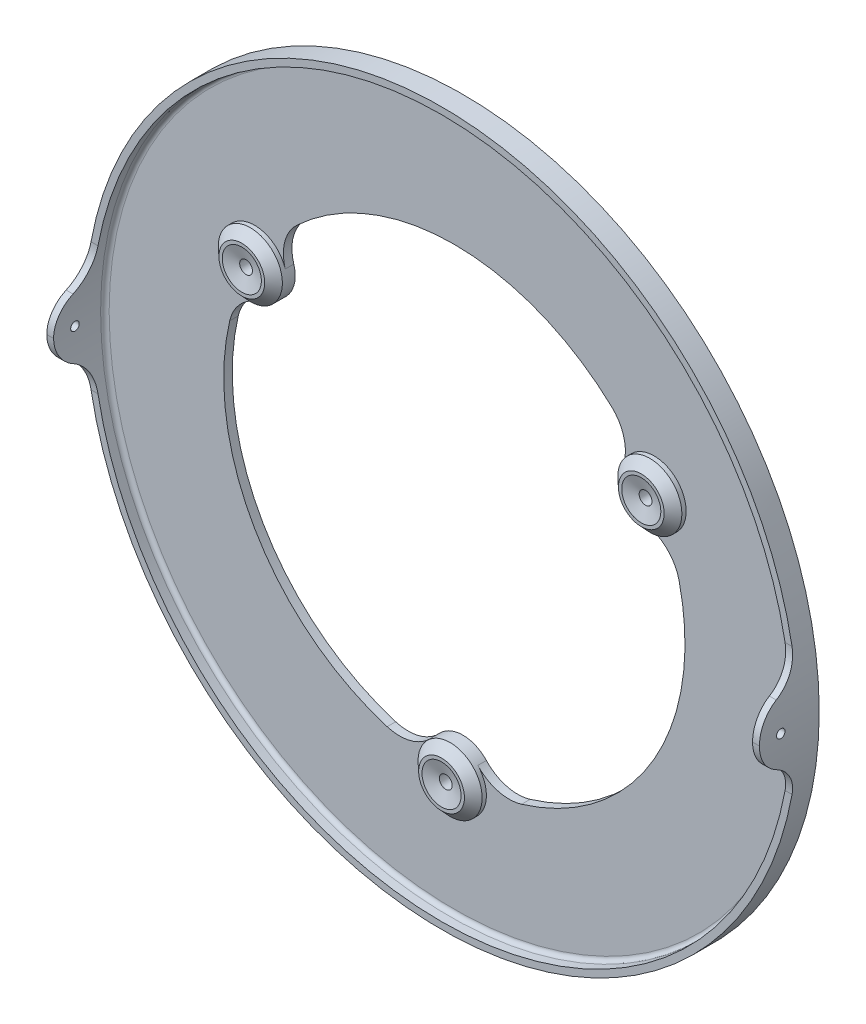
ISO-10303-21;
HEADER;
FILE_DESCRIPTION(('STEP AP214'),'2;1');
FILE_NAME('part.step','',(''),(''),'','','');
FILE_SCHEMA(('AUTOMOTIVE_DESIGN { 1 0 10303 214 1 1 1 1 }'));
ENDSEC;
DATA;
#1=APPLICATION_CONTEXT('core data for automotive mechanical design processes');
#2=APPLICATION_PROTOCOL_DEFINITION('international standard','automotive_design',2000,#1);
#3=PRODUCT_CONTEXT('',#1,'mechanical');
#4=PRODUCT('Part','Part','',(#3));
#5=PRODUCT_RELATED_PRODUCT_CATEGORY('part','',(#4));
#6=PRODUCT_DEFINITION_FORMATION('','',#4);
#7=PRODUCT_DEFINITION_CONTEXT('part definition',#1,'design');
#8=PRODUCT_DEFINITION('design','',#6,#7);
#9=PRODUCT_DEFINITION_SHAPE('','',#8);
#10=(LENGTH_UNIT() NAMED_UNIT(*) SI_UNIT(.MILLI.,.METRE.));
#11=(NAMED_UNIT(*) PLANE_ANGLE_UNIT() SI_UNIT($,.RADIAN.));
#12=(NAMED_UNIT(*) SI_UNIT($,.STERADIAN.) SOLID_ANGLE_UNIT());
#13=UNCERTAINTY_MEASURE_WITH_UNIT(LENGTH_MEASURE(1.E-05),#10,'distance_accuracy_value','');
#14=(GEOMETRIC_REPRESENTATION_CONTEXT(3) GLOBAL_UNCERTAINTY_ASSIGNED_CONTEXT((#13)) GLOBAL_UNIT_ASSIGNED_CONTEXT((#10,
#11,#12)) REPRESENTATION_CONTEXT('',''));
#15=CARTESIAN_POINT('',(0.,0.,0.));
#16=DIRECTION('',(0.,0.,1.));
#17=DIRECTION('',(1.,0.,0.));
#18=AXIS2_PLACEMENT_3D('',#15,#16,#17);
#19=CARTESIAN_POINT('',(0.,0.,0.));
#20=DIRECTION('',(0.,0.,1.));
#21=DIRECTION('',(1.,0.,0.));
#22=AXIS2_PLACEMENT_3D('',#19,#20,#21);
#23=PLANE('',#22);
#24=CARTESIAN_POINT('',(0.,-53.98225016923,0.));
#25=DIRECTION('',(0.,0.,1.));
#26=DIRECTION('',(1.,0.,0.));
#27=AXIS2_PLACEMENT_3D('',#24,#25,#26);
#28=CIRCLE('',#27,1.5);
#29=CARTESIAN_POINT('',(1.5,-53.98225016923,0.));
#30=VERTEX_POINT('',#29);
#31=EDGE_CURVE('E307',#30,#30,#28,.T.);
#32=ORIENTED_EDGE('',*,*,#31,.T.);
#33=EDGE_LOOP('',(#32));
#34=FACE_BOUND('',#33,.T.);
#35=CARTESIAN_POINT('',(46.75,26.991125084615,0.));
#36=DIRECTION('',(0.,0.,1.));
#37=DIRECTION('',(1.,0.,0.));
#38=AXIS2_PLACEMENT_3D('',#35,#36,#37);
#39=CIRCLE('',#38,1.5);
#40=CARTESIAN_POINT('',(48.25,26.991125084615,0.));
#41=VERTEX_POINT('',#40);
#42=EDGE_CURVE('E310',#41,#41,#39,.T.);
#43=ORIENTED_EDGE('',*,*,#42,.T.);
#44=EDGE_LOOP('',(#43));
#45=FACE_BOUND('',#44,.T.);
#46=CARTESIAN_POINT('',(-46.75,26.991125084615,0.));
#47=DIRECTION('',(0.,0.,1.));
#48=DIRECTION('',(1.,0.,0.));
#49=AXIS2_PLACEMENT_3D('',#46,#47,#48);
#50=CIRCLE('',#49,1.5);
#51=CARTESIAN_POINT('',(-45.25,26.991125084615,0.));
#52=VERTEX_POINT('',#51);
#53=EDGE_CURVE('E313',#52,#52,#50,.T.);
#54=ORIENTED_EDGE('',*,*,#53,.T.);
#55=EDGE_LOOP('',(#54));
#56=FACE_BOUND('',#55,.T.);
#57=CARTESIAN_POINT('',(-46.75,26.991125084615,0.));
#58=DIRECTION('',(0.,0.,-1.));
#59=DIRECTION('',(1.,0.,0.));
#60=AXIS2_PLACEMENT_3D('',#57,#58,#59);
#61=CIRCLE('',#60,7.50000000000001);
#62=CARTESIAN_POINT('',(-39.5819421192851,29.1976939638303,0.));
#63=VERTEX_POINT('',#62);
#64=CARTESIAN_POINT('',(-45.0769157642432,19.680120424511,0.));
#65=VERTEX_POINT('',#64);
#66=EDGE_CURVE('E321',#63,#65,#61,.T.);
#67=ORIENTED_EDGE('',*,*,#66,.T.);
#68=CARTESIAN_POINT('',(-42.8461367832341,9.93211421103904,0.));
#69=DIRECTION('',(0.,0.,1.));
#70=DIRECTION('',(1.,0.,0.));
#71=AXIS2_PLACEMENT_3D('',#68,#69,#70);
#72=CIRCLE('',#71,10.);
#73=CARTESIAN_POINT('',(-52.5878249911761,12.1903238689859,0.));
#74=VERTEX_POINT('',#73);
#75=EDGE_CURVE('E343',#65,#74,#72,.T.);
#76=ORIENTED_EDGE('',*,*,#75,.T.);
#77=CARTESIAN_POINT('',(0.,0.,0.));
#78=DIRECTION('',(0.,0.,1.));
#79=DIRECTION('',(1.,0.,0.));
#80=AXIS2_PLACEMENT_3D('',#77,#78,#79);
#81=CIRCLE('',#80,53.98225016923);
#82=CARTESIAN_POINT('',(-15.7367823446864,-51.6375543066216,0.));
#83=VERTEX_POINT('',#82);
#84=EDGE_CURVE('E316',#74,#83,#81,.T.);
#85=ORIENTED_EDGE('',*,*,#84,.T.);
#86=CARTESIAN_POINT('',(-12.8216051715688,-42.0719000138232,0.));
#87=DIRECTION('',(0.,0.,1.));
#88=DIRECTION('',(1.,0.,0.));
#89=AXIS2_PLACEMENT_3D('',#86,#87,#88);
#90=CIRCLE('',#89,10.);
#91=CARTESIAN_POINT('',(-5.49497364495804,-48.8778143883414,0.));
#92=VERTEX_POINT('',#91);
#93=EDGE_CURVE('E366',#83,#92,#90,.T.);
#94=ORIENTED_EDGE('',*,*,#93,.T.);
#95=CARTESIAN_POINT('',(0.,-53.98225016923,0.));
#96=DIRECTION('',(0.,0.,-1.));
#97=DIRECTION('',(1.,0.,0.));
#98=AXIS2_PLACEMENT_3D('',#95,#96,#97);
#99=CIRCLE('',#98,7.49999999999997);
#100=CARTESIAN_POINT('',(5.49497364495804,-48.8778143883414,0.));
#101=VERTEX_POINT('',#100);
#102=EDGE_CURVE('E328',#92,#101,#99,.T.);
#103=ORIENTED_EDGE('',*,*,#102,.T.);
#104=CARTESIAN_POINT('',(12.8216051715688,-42.0719000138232,0.));
#105=DIRECTION('',(0.,0.,1.));
#106=DIRECTION('',(1.,0.,0.));
#107=AXIS2_PLACEMENT_3D('',#104,#105,#106);
#108=CIRCLE('',#107,10.);
#109=CARTESIAN_POINT('',(15.7367823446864,-51.6375543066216,0.));
#110=VERTEX_POINT('',#109);
#111=EDGE_CURVE('E356',#101,#110,#108,.T.);
#112=ORIENTED_EDGE('',*,*,#111,.T.);
#113=CARTESIAN_POINT('',(0.,0.,0.));
#114=DIRECTION('',(0.,0.,1.));
#115=DIRECTION('',(1.,0.,0.));
#116=AXIS2_PLACEMENT_3D('',#113,#114,#115);
#117=CIRCLE('',#116,53.98225016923);
#118=CARTESIAN_POINT('',(52.5878249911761,12.1903238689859,0.));
#119=VERTEX_POINT('',#118);
#120=EDGE_CURVE('E331',#110,#119,#117,.T.);
#121=ORIENTED_EDGE('',*,*,#120,.T.);
#122=CARTESIAN_POINT('',(42.8461367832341,9.93211421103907,0.));
#123=DIRECTION('',(0.,0.,1.));
#124=DIRECTION('',(1.,0.,0.));
#125=AXIS2_PLACEMENT_3D('',#122,#123,#124);
#126=CIRCLE('',#125,10.);
#127=CARTESIAN_POINT('',(45.0769157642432,19.680120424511,0.));
#128=VERTEX_POINT('',#127);
#129=EDGE_CURVE('E375',#119,#128,#126,.T.);
#130=ORIENTED_EDGE('',*,*,#129,.T.);
#131=CARTESIAN_POINT('',(46.75,26.991125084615,0.));
#132=DIRECTION('',(0.,0.,-1.));
#133=DIRECTION('',(1.,0.,0.));
#134=AXIS2_PLACEMENT_3D('',#131,#132,#133);
#135=CIRCLE('',#134,7.49999999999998);
#136=CARTESIAN_POINT('',(39.5819421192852,29.1976939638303,0.));
#137=VERTEX_POINT('',#136);
#138=EDGE_CURVE('E334',#128,#137,#135,.T.);
#139=ORIENTED_EDGE('',*,*,#138,.T.);
#140=CARTESIAN_POINT('',(30.0245316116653,32.1397858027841,0.));
#141=DIRECTION('',(0.,0.,1.));
#142=DIRECTION('',(1.,0.,0.));
#143=AXIS2_PLACEMENT_3D('',#140,#141,#142);
#144=CIRCLE('',#143,10.);
#145=CARTESIAN_POINT('',(36.8510426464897,39.4472304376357,0.));
#146=VERTEX_POINT('',#145);
#147=EDGE_CURVE('E370',#137,#146,#144,.T.);
#148=ORIENTED_EDGE('',*,*,#147,.T.);
#149=CARTESIAN_POINT('',(0.,0.,0.));
#150=DIRECTION('',(0.,0.,1.));
#151=DIRECTION('',(1.,0.,0.));
#152=AXIS2_PLACEMENT_3D('',#149,#150,#151);
#153=CIRCLE('',#152,53.98225016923);
#154=CARTESIAN_POINT('',(-36.8510426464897,39.4472304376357,0.));
#155=VERTEX_POINT('',#154);
#156=EDGE_CURVE('E337',#146,#155,#153,.T.);
#157=ORIENTED_EDGE('',*,*,#156,.T.);
#158=CARTESIAN_POINT('',(-30.0245316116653,32.1397858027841,0.));
#159=DIRECTION('',(0.,0.,1.));
#160=DIRECTION('',(1.,0.,0.));
#161=AXIS2_PLACEMENT_3D('',#158,#159,#160);
#162=CIRCLE('',#161,10.);
#163=EDGE_CURVE('E45',#155,#63,#162,.T.);
#164=ORIENTED_EDGE('',*,*,#163,.T.);
#165=EDGE_LOOP('',(#67,#76,#85,#94,#103,#112,#121,#130,#139,#148,#157,#164));
#166=FACE_BOUND('',#165,.T.);
#167=CARTESIAN_POINT('',(0.,0.,0.));
#168=DIRECTION('',(0.,0.,1.));
#169=DIRECTION('',(1.,0.,0.));
#170=AXIS2_PLACEMENT_3D('',#167,#168,#169);
#171=CIRCLE('',#170,83.4);
#172=CARTESIAN_POINT('',(83.4,0.,0.));
#173=VERTEX_POINT('',#172);
#174=EDGE_CURVE('E422',#173,#173,#171,.T.);
#175=ORIENTED_EDGE('',*,*,#174,.F.);
#176=EDGE_LOOP('',(#175));
#177=FACE_BOUND('',#176,.T.);
#178=ADVANCED_FACE('F37',(#34,#45,#56,#166,#177),#23,.F.);
#179=CARTESIAN_POINT('',(0.,0.,2.));
#180=DIRECTION('',(0.,0.,1.));
#181=DIRECTION('',(1.,0.,0.));
#182=AXIS2_PLACEMENT_3D('',#179,#180,#181);
#183=PLANE('',#182);
#184=CARTESIAN_POINT('',(0.,0.,2.));
#185=DIRECTION('',(0.,0.,1.));
#186=DIRECTION('',(1.,0.,0.));
#187=AXIS2_PLACEMENT_3D('',#184,#185,#186);
#188=CIRCLE('',#187,80.8);
#189=CARTESIAN_POINT('',(80.8,0.,2.));
#190=VERTEX_POINT('',#189);
#191=EDGE_CURVE('E485',#190,#190,#188,.T.);
#192=ORIENTED_EDGE('',*,*,#191,.T.);
#193=EDGE_LOOP('',(#192));
#194=FACE_BOUND('',#193,.T.);
#195=CARTESIAN_POINT('',(0.,0.,2.));
#196=DIRECTION('',(0.,0.,1.));
#197=DIRECTION('',(1.,0.,0.));
#198=AXIS2_PLACEMENT_3D('',#195,#196,#197);
#199=CIRCLE('',#198,53.98225016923);
#200=CARTESIAN_POINT('',(15.7367823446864,-51.6375543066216,2.));
#201=VERTEX_POINT('',#200);
#202=CARTESIAN_POINT('',(52.5878249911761,12.1903238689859,2.));
#203=VERTEX_POINT('',#202);
#204=EDGE_CURVE('E320',#201,#203,#199,.T.);
#205=ORIENTED_EDGE('',*,*,#204,.F.);
#206=CARTESIAN_POINT('',(12.8216051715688,-42.0719000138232,2.));
#207=DIRECTION('',(0.,0.,1.));
#208=DIRECTION('',(1.,0.,0.));
#209=AXIS2_PLACEMENT_3D('',#206,#207,#208);
#210=CIRCLE('',#209,10.);
#211=CARTESIAN_POINT('',(5.494973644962,-48.8778143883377,2.));
#212=VERTEX_POINT('',#211);
#213=EDGE_CURVE('E363',#201,#212,#210,.F.);
#214=ORIENTED_EDGE('',*,*,#213,.T.);
#215=CARTESIAN_POINT('',(3.4205361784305E-12,-53.982250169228,2.));
#216=DIRECTION('',(0.,0.,1.));
#217=DIRECTION('',(1.,0.,0.));
#218=AXIS2_PLACEMENT_3D('',#215,#216,#217);
#219=CIRCLE('',#218,7.50000000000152);
#220=CARTESIAN_POINT('',(-5.49497364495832,-48.8778143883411,2.));
#221=VERTEX_POINT('',#220);
#222=EDGE_CURVE('E419',#221,#212,#219,.T.);
#223=ORIENTED_EDGE('',*,*,#222,.F.);
#224=CARTESIAN_POINT('',(-12.8216051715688,-42.0719000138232,2.));
#225=DIRECTION('',(0.,0.,1.));
#226=DIRECTION('',(1.,0.,0.));
#227=AXIS2_PLACEMENT_3D('',#224,#225,#226);
#228=CIRCLE('',#227,10.);
#229=CARTESIAN_POINT('',(-15.7367823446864,-51.6375543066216,2.));
#230=VERTEX_POINT('',#229);
#231=EDGE_CURVE('E368',#221,#230,#228,.F.);
#232=ORIENTED_EDGE('',*,*,#231,.T.);
#233=CARTESIAN_POINT('',(0.,0.,2.));
#234=DIRECTION('',(0.,0.,1.));
#235=DIRECTION('',(1.,0.,0.));
#236=AXIS2_PLACEMENT_3D('',#233,#234,#235);
#237=CIRCLE('',#236,53.98225016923);
#238=CARTESIAN_POINT('',(-52.5878249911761,12.1903238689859,2.));
#239=VERTEX_POINT('',#238);
#240=EDGE_CURVE('E317',#239,#230,#237,.T.);
#241=ORIENTED_EDGE('',*,*,#240,.F.);
#242=CARTESIAN_POINT('',(-42.8461367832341,9.93211421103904,2.));
#243=DIRECTION('',(0.,0.,1.));
#244=DIRECTION('',(1.,0.,0.));
#245=AXIS2_PLACEMENT_3D('',#242,#243,#244);
#246=CIRCLE('',#245,10.);
#247=CARTESIAN_POINT('',(-45.0769157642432,19.680120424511,2.));
#248=VERTEX_POINT('',#247);
#249=EDGE_CURVE('E380',#239,#248,#246,.F.);
#250=ORIENTED_EDGE('',*,*,#249,.T.);
#251=CARTESIAN_POINT('',(-46.75,26.991125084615,2.));
#252=DIRECTION('',(0.,0.,1.));
#253=DIRECTION('',(1.,0.,0.));
#254=AXIS2_PLACEMENT_3D('',#251,#252,#253);
#255=CIRCLE('',#254,7.50000000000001);
#256=CARTESIAN_POINT('',(-39.5819421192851,29.1976939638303,2.));
#257=VERTEX_POINT('',#256);
#258=EDGE_CURVE('E52',#257,#248,#255,.T.);
#259=ORIENTED_EDGE('',*,*,#258,.F.);
#260=CARTESIAN_POINT('',(-30.0245316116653,32.1397858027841,2.));
#261=DIRECTION('',(0.,0.,1.));
#262=DIRECTION('',(1.,0.,0.));
#263=AXIS2_PLACEMENT_3D('',#260,#261,#262);
#264=CIRCLE('',#263,10.);
#265=CARTESIAN_POINT('',(-36.8510426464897,39.4472304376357,2.));
#266=VERTEX_POINT('',#265);
#267=EDGE_CURVE('E11',#257,#266,#264,.F.);
#268=ORIENTED_EDGE('',*,*,#267,.T.);
#269=CARTESIAN_POINT('',(0.,0.,2.));
#270=DIRECTION('',(0.,0.,1.));
#271=DIRECTION('',(1.,0.,0.));
#272=AXIS2_PLACEMENT_3D('',#269,#270,#271);
#273=CIRCLE('',#272,53.98225016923);
#274=CARTESIAN_POINT('',(36.8510426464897,39.4472304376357,2.));
#275=VERTEX_POINT('',#274);
#276=EDGE_CURVE('E260',#275,#266,#273,.T.);
#277=ORIENTED_EDGE('',*,*,#276,.F.);
#278=CARTESIAN_POINT('',(30.0245316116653,32.1397858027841,2.));
#279=DIRECTION('',(0.,0.,1.));
#280=DIRECTION('',(1.,0.,0.));
#281=AXIS2_PLACEMENT_3D('',#278,#279,#280);
#282=CIRCLE('',#281,10.);
#283=CARTESIAN_POINT('',(39.5819421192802,29.1976939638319,2.));
#284=VERTEX_POINT('',#283);
#285=EDGE_CURVE('E372',#275,#284,#282,.F.);
#286=ORIENTED_EDGE('',*,*,#285,.T.);
#287=CARTESIAN_POINT('',(46.75,26.9911250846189,2.));
#288=DIRECTION('',(0.,0.,1.));
#289=DIRECTION('',(1.,0.,0.));
#290=AXIS2_PLACEMENT_3D('',#287,#288,#289);
#291=CIRCLE('',#290,7.50000000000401);
#292=CARTESIAN_POINT('',(45.0769157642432,19.6801204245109,2.));
#293=VERTEX_POINT('',#292);
#294=EDGE_CURVE('E417',#293,#284,#291,.T.);
#295=ORIENTED_EDGE('',*,*,#294,.F.);
#296=CARTESIAN_POINT('',(42.8461367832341,9.93211421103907,2.));
#297=DIRECTION('',(0.,0.,1.));
#298=DIRECTION('',(1.,0.,0.));
#299=AXIS2_PLACEMENT_3D('',#296,#297,#298);
#300=CIRCLE('',#299,10.);
#301=EDGE_CURVE('E377',#293,#203,#300,.F.);
#302=ORIENTED_EDGE('',*,*,#301,.T.);
#303=EDGE_LOOP('',(#205,#214,#223,#232,#241,#250,#259,#268,#277,#286,#295,#302));
#304=FACE_BOUND('',#303,.T.);
#305=ADVANCED_FACE('F384',(#194,#304),#183,.T.);
#306=CARTESIAN_POINT('',(0.,0.,2.));
#307=DIRECTION('',(0.,0.,-1.));
#308=DIRECTION('',(-1.,0.,0.));
#309=AXIS2_PLACEMENT_3D('',#306,#307,#308);
#310=CYLINDRICAL_SURFACE('',#309,53.98225016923);
#311=ORIENTED_EDGE('',*,*,#240,.T.);
#312=DIRECTION('',(0.,0.,-1.));
#313=VECTOR('',#312,1.);
#314=CARTESIAN_POINT('',(-15.7367823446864,-51.6375543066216,2.));
#315=LINE('',#314,#313);
#316=EDGE_CURVE('E390',#230,#83,#315,.T.);
#317=ORIENTED_EDGE('',*,*,#316,.T.);
#318=ORIENTED_EDGE('',*,*,#84,.F.);
#319=DIRECTION('',(0.,0.,-1.));
#320=VECTOR('',#319,1.);
#321=CARTESIAN_POINT('',(-52.5878249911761,12.1903238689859,2.));
#322=LINE('',#321,#320);
#323=EDGE_CURVE('E388',#74,#239,#322,.F.);
#324=ORIENTED_EDGE('',*,*,#323,.T.);
#325=EDGE_LOOP('',(#311,#317,#318,#324));
#326=FACE_BOUND('',#325,.T.);
#327=ADVANCED_FACE('F434',(#326),#310,.F.);
#328=CARTESIAN_POINT('',(0.,-53.98225016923,2.));
#329=DIRECTION('',(0.,0.,-1.));
#330=DIRECTION('',(-1.,0.,0.));
#331=AXIS2_PLACEMENT_3D('',#328,#329,#330);
#332=CYLINDRICAL_SURFACE('',#331,7.49999999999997);
#333=CARTESIAN_POINT('',(0.,-53.98225016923,2.99999999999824));
#334=DIRECTION('',(0.,0.,1.));
#335=DIRECTION('',(1.,0.,0.));
#336=AXIS2_PLACEMENT_3D('',#333,#334,#335);
#337=CIRCLE('',#336,7.49999999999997);
#338=CARTESIAN_POINT('',(7.49999999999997,-53.98225016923,2.99999999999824));
#339=VERTEX_POINT('',#338);
#340=EDGE_CURVE('E509',#339,#339,#337,.F.);
#341=ORIENTED_EDGE('',*,*,#340,.T.);
#342=EDGE_LOOP('',(#341));
#343=FACE_BOUND('',#342,.T.);
#344=ORIENTED_EDGE('',*,*,#222,.T.);
#345=DIRECTION('',(0.,0.,-1.));
#346=VECTOR('',#345,1.);
#347=CARTESIAN_POINT('',(5.49497364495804,-48.8778143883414,2.));
#348=LINE('',#347,#346);
#349=EDGE_CURVE('E527',#212,#101,#348,.T.);
#350=ORIENTED_EDGE('',*,*,#349,.T.);
#351=ORIENTED_EDGE('',*,*,#102,.F.);
#352=DIRECTION('',(0.,0.,-1.));
#353=VECTOR('',#352,1.);
#354=CARTESIAN_POINT('',(-5.49497364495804,-48.8778143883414,2.));
#355=LINE('',#354,#353);
#356=EDGE_CURVE('E524',#92,#221,#355,.F.);
#357=ORIENTED_EDGE('',*,*,#356,.T.);
#358=EDGE_LOOP('',(#344,#350,#351,#357));
#359=FACE_BOUND('',#358,.T.);
#360=ADVANCED_FACE('F542',(#343,#359),#332,.T.);
#361=CARTESIAN_POINT('',(0.,0.,2.));
#362=DIRECTION('',(0.,0.,-1.));
#363=DIRECTION('',(-1.,0.,0.));
#364=AXIS2_PLACEMENT_3D('',#361,#362,#363);
#365=CYLINDRICAL_SURFACE('',#364,53.98225016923);
#366=ORIENTED_EDGE('',*,*,#120,.F.);
#367=DIRECTION('',(0.,0.,-1.));
#368=VECTOR('',#367,1.);
#369=CARTESIAN_POINT('',(15.7367823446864,-51.6375543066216,2.));
#370=LINE('',#369,#368);
#371=EDGE_CURVE('E391',#110,#201,#370,.F.);
#372=ORIENTED_EDGE('',*,*,#371,.T.);
#373=ORIENTED_EDGE('',*,*,#204,.T.);
#374=DIRECTION('',(0.,0.,-1.));
#375=VECTOR('',#374,1.);
#376=CARTESIAN_POINT('',(52.5878249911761,12.1903238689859,2.));
#377=LINE('',#376,#375);
#378=EDGE_CURVE('E396',#203,#119,#377,.T.);
#379=ORIENTED_EDGE('',*,*,#378,.T.);
#380=EDGE_LOOP('',(#366,#372,#373,#379));
#381=FACE_BOUND('',#380,.T.);
#382=ADVANCED_FACE('F533',(#381),#365,.F.);
#383=CARTESIAN_POINT('',(46.75,26.991125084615,2.));
#384=DIRECTION('',(0.,0.,-1.));
#385=DIRECTION('',(-1.,0.,0.));
#386=AXIS2_PLACEMENT_3D('',#383,#384,#385);
#387=CYLINDRICAL_SURFACE('',#386,7.49999999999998);
#388=CARTESIAN_POINT('',(46.75,26.991125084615,3.00000000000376));
#389=DIRECTION('',(0.,0.,1.));
#390=DIRECTION('',(1.,0.,0.));
#391=AXIS2_PLACEMENT_3D('',#388,#389,#390);
#392=CIRCLE('',#391,7.49999999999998);
#393=CARTESIAN_POINT('',(54.25,26.991125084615,3.00000000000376));
#394=VERTEX_POINT('',#393);
#395=EDGE_CURVE('E515',#394,#394,#392,.F.);
#396=ORIENTED_EDGE('',*,*,#395,.T.);
#397=EDGE_LOOP('',(#396));
#398=FACE_BOUND('',#397,.T.);
#399=ORIENTED_EDGE('',*,*,#294,.T.);
#400=DIRECTION('',(0.,0.,-1.));
#401=VECTOR('',#400,1.);
#402=CARTESIAN_POINT('',(39.5819421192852,29.1976939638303,2.));
#403=LINE('',#402,#401);
#404=EDGE_CURVE('E402',#284,#137,#403,.T.);
#405=ORIENTED_EDGE('',*,*,#404,.T.);
#406=ORIENTED_EDGE('',*,*,#138,.F.);
#407=DIRECTION('',(0.,0.,-1.));
#408=VECTOR('',#407,1.);
#409=CARTESIAN_POINT('',(45.0769157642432,19.680120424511,2.));
#410=LINE('',#409,#408);
#411=EDGE_CURVE('E394',#128,#293,#410,.F.);
#412=ORIENTED_EDGE('',*,*,#411,.T.);
#413=EDGE_LOOP('',(#399,#405,#406,#412));
#414=FACE_BOUND('',#413,.T.);
#415=ADVANCED_FACE('F415',(#398,#414),#387,.T.);
#416=CARTESIAN_POINT('',(0.,0.,2.));
#417=DIRECTION('',(0.,0.,-1.));
#418=DIRECTION('',(-1.,0.,0.));
#419=AXIS2_PLACEMENT_3D('',#416,#417,#418);
#420=CYLINDRICAL_SURFACE('',#419,53.98225016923);
#421=ORIENTED_EDGE('',*,*,#156,.F.);
#422=DIRECTION('',(0.,0.,-1.));
#423=VECTOR('',#422,1.);
#424=CARTESIAN_POINT('',(36.8510426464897,39.4472304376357,2.));
#425=LINE('',#424,#423);
#426=EDGE_CURVE('E354',#146,#275,#425,.F.);
#427=ORIENTED_EDGE('',*,*,#426,.T.);
#428=ORIENTED_EDGE('',*,*,#276,.T.);
#429=DIRECTION('',(0.,0.,-1.));
#430=VECTOR('',#429,1.);
#431=CARTESIAN_POINT('',(-36.8510426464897,39.4472304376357,2.));
#432=LINE('',#431,#430);
#433=EDGE_CURVE('E358',#266,#155,#432,.T.);
#434=ORIENTED_EDGE('',*,*,#433,.T.);
#435=EDGE_LOOP('',(#421,#427,#428,#434));
#436=FACE_BOUND('',#435,.T.);
#437=ADVANCED_FACE('F406',(#436),#420,.F.);
#438=CARTESIAN_POINT('',(-46.75,26.991125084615,2.));
#439=DIRECTION('',(0.,0.,-1.));
#440=DIRECTION('',(-1.,0.,0.));
#441=AXIS2_PLACEMENT_3D('',#438,#439,#440);
#442=CYLINDRICAL_SURFACE('',#441,7.50000000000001);
#443=CARTESIAN_POINT('',(-46.75,26.991125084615,2.99999999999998));
#444=DIRECTION('',(0.,0.,1.));
#445=DIRECTION('',(1.,0.,0.));
#446=AXIS2_PLACEMENT_3D('',#443,#444,#445);
#447=CIRCLE('',#446,7.50000000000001);
#448=CARTESIAN_POINT('',(-39.25,26.991125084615,2.99999999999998));
#449=VERTEX_POINT('',#448);
#450=EDGE_CURVE('E521',#449,#449,#447,.F.);
#451=ORIENTED_EDGE('',*,*,#450,.T.);
#452=EDGE_LOOP('',(#451));
#453=FACE_BOUND('',#452,.T.);
#454=ORIENTED_EDGE('',*,*,#258,.T.);
#455=DIRECTION('',(0.,0.,-1.));
#456=VECTOR('',#455,1.);
#457=CARTESIAN_POINT('',(-45.0769157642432,19.680120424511,2.));
#458=LINE('',#457,#456);
#459=EDGE_CURVE('E350',#248,#65,#458,.T.);
#460=ORIENTED_EDGE('',*,*,#459,.T.);
#461=ORIENTED_EDGE('',*,*,#66,.F.);
#462=DIRECTION('',(0.,0.,-1.));
#463=VECTOR('',#462,1.);
#464=CARTESIAN_POINT('',(-39.5819421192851,29.1976939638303,2.));
#465=LINE('',#464,#463);
#466=EDGE_CURVE('E347',#63,#257,#465,.F.);
#467=ORIENTED_EDGE('',*,*,#466,.T.);
#468=EDGE_LOOP('',(#454,#460,#461,#467));
#469=FACE_BOUND('',#468,.T.);
#470=ADVANCED_FACE('F346',(#453,#469),#442,.T.);
#471=CARTESIAN_POINT('',(-46.75,26.991125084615,2.));
#472=DIRECTION('',(0.,0.,-1.));
#473=DIRECTION('',(-1.,0.,0.));
#474=AXIS2_PLACEMENT_3D('',#471,#472,#473);
#475=CYLINDRICAL_SURFACE('',#474,1.5);
#476=CARTESIAN_POINT('',(-46.75,26.991125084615,4.));
#477=DIRECTION('',(0.,0.,1.));
#478=DIRECTION('',(1.,0.,0.));
#479=AXIS2_PLACEMENT_3D('',#476,#477,#478);
#480=CIRCLE('',#479,1.5);
#481=CARTESIAN_POINT('',(-45.25,26.991125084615,4.));
#482=VERTEX_POINT('',#481);
#483=EDGE_CURVE('E500',#482,#482,#480,.T.);
#484=ORIENTED_EDGE('',*,*,#483,.T.);
#485=EDGE_LOOP('',(#484));
#486=FACE_BOUND('',#485,.T.);
#487=ORIENTED_EDGE('',*,*,#53,.F.);
#488=EDGE_LOOP('',(#487));
#489=FACE_BOUND('',#488,.T.);
#490=ADVANCED_FACE('F808',(#486,#489),#475,.F.);
#491=CARTESIAN_POINT('',(46.75,26.991125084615,2.));
#492=DIRECTION('',(0.,0.,-1.));
#493=DIRECTION('',(-1.,0.,0.));
#494=AXIS2_PLACEMENT_3D('',#491,#492,#493);
#495=CYLINDRICAL_SURFACE('',#494,1.5);
#496=CARTESIAN_POINT('',(46.75,26.991125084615,3.99999999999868));
#497=DIRECTION('',(0.,0.,1.));
#498=DIRECTION('',(1.,0.,0.));
#499=AXIS2_PLACEMENT_3D('',#496,#497,#498);
#500=CIRCLE('',#499,1.5);
#501=CARTESIAN_POINT('',(48.25,26.991125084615,3.99999999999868));
#502=VERTEX_POINT('',#501);
#503=EDGE_CURVE('E494',#502,#502,#500,.T.);
#504=ORIENTED_EDGE('',*,*,#503,.T.);
#505=EDGE_LOOP('',(#504));
#506=FACE_BOUND('',#505,.T.);
#507=ORIENTED_EDGE('',*,*,#42,.F.);
#508=EDGE_LOOP('',(#507));
#509=FACE_BOUND('',#508,.T.);
#510=ADVANCED_FACE('F797',(#506,#509),#495,.F.);
#511=CARTESIAN_POINT('',(0.,-53.98225016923,2.));
#512=DIRECTION('',(0.,0.,-1.));
#513=DIRECTION('',(-1.,0.,0.));
#514=AXIS2_PLACEMENT_3D('',#511,#512,#513);
#515=CYLINDRICAL_SURFACE('',#514,1.5);
#516=CARTESIAN_POINT('',(0.,-53.98225016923,4.0000000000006));
#517=DIRECTION('',(0.,0.,1.));
#518=DIRECTION('',(1.,0.,0.));
#519=AXIS2_PLACEMENT_3D('',#516,#517,#518);
#520=CIRCLE('',#519,1.5);
#521=CARTESIAN_POINT('',(1.5,-53.98225016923,4.0000000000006));
#522=VERTEX_POINT('',#521);
#523=EDGE_CURVE('E488',#522,#522,#520,.T.);
#524=ORIENTED_EDGE('',*,*,#523,.T.);
#525=EDGE_LOOP('',(#524));
#526=FACE_BOUND('',#525,.T.);
#527=ORIENTED_EDGE('',*,*,#31,.F.);
#528=EDGE_LOOP('',(#527));
#529=FACE_BOUND('',#528,.T.);
#530=ADVANCED_FACE('F764',(#526,#529),#515,.F.);
#531=CARTESIAN_POINT('',(0.,0.,14.));
#532=DIRECTION('',(0.,0.,-1.));
#533=DIRECTION('',(-1.,0.,0.));
#534=AXIS2_PLACEMENT_3D('',#531,#532,#533);
#535=CYLINDRICAL_SURFACE('',#534,83.4);
#536=CARTESIAN_POINT('',(-83.1007401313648,-7.05882352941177,9.76470588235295));
#537=CARTESIAN_POINT('',(-83.1097412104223,-6.95283303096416,9.96348827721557));
#538=CARTESIAN_POINT('',(-83.1192578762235,-6.83841790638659,10.1577485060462));
#539=CARTESIAN_POINT('',(-83.1390337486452,-6.59365066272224,10.5359005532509));
#540=CARTESIAN_POINT('',(-83.1492929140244,-6.46329942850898,10.7197929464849));
#541=CARTESIAN_POINT('',(-83.1702557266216,-6.18769816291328,11.0757294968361));
#542=CARTESIAN_POINT('',(-83.1809589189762,-6.04246316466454,11.247785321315));
#543=CARTESIAN_POINT('',(-83.2025143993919,-5.73802097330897,11.5790421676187));
#544=CARTESIAN_POINT('',(-83.2133666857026,-5.57881394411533,11.7382433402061));
#545=CARTESIAN_POINT('',(-83.2349170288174,-5.24748960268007,12.0427223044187));
#546=CARTESIAN_POINT('',(-83.2456150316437,-5.07536789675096,12.1879953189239));
#547=CARTESIAN_POINT('',(-83.2665500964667,-4.71947076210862,12.4635316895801));
#548=CARTESIAN_POINT('',(-83.2767871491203,-4.53569509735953,12.593794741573));
#549=CARTESIAN_POINT('',(-83.2965135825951,-4.15772102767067,12.8384245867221));
#550=CARTESIAN_POINT('',(-83.306002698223,-3.9635189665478,12.9527857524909));
#551=CARTESIAN_POINT('',(-83.3239596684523,-3.56613186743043,13.1647338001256));
#552=CARTESIAN_POINT('',(-83.3324275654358,-3.36294720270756,13.2623213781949));
#553=CARTESIAN_POINT('',(-83.34810322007,-2.94899838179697,13.4400370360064));
#554=CARTESIAN_POINT('',(-83.3553107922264,-2.73823311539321,13.5201625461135));
#555=CARTESIAN_POINT('',(-83.3682589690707,-2.31065647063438,13.6623508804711));
#556=CARTESIAN_POINT('',(-83.3739996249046,-2.09384530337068,13.7244143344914));
#557=CARTESIAN_POINT('',(-83.3838429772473,-1.65607880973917,13.8299441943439));
#558=CARTESIAN_POINT('',(-83.3879482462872,-1.43513056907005,13.8734398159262));
#559=CARTESIAN_POINT('',(-83.3944149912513,-0.990423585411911,13.9416380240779));
#560=CARTESIAN_POINT('',(-83.3967774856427,-0.766666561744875,13.9663515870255));
#561=CARTESIAN_POINT('',(-83.3988241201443,-0.452012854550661,13.9877336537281));
#562=CARTESIAN_POINT('',(-83.3992651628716,-0.361604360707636,13.9923362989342));
#563=CARTESIAN_POINT('',(-83.3998529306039,-0.180800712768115,13.9984672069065));
#564=CARTESIAN_POINT('',(-83.4000000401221,-0.0904056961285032,13.9999994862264));
#565=CARTESIAN_POINT('',(-83.4,0.,14.));
#566=B_SPLINE_CURVE_WITH_KNOTS('',3,(#536,#537,#538,#539,#540,#541,#542,#543,#544,#545,#546,
#547,#548,#549,#550,#551,#552,#553,#554,#555,#556,#557,#558,#559,#560,#561,#562,#563,#564,#565),
.UNSPECIFIED.,.F.,.F.,(4,2,2,2,2,2,2,2,2,2,2,2,2,2,4),(0.,0.676152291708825,1.35226705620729,
2.02770552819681,2.70313607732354,3.37879746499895,4.05447254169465,4.73038612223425,
5.40627164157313,6.08225655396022,6.75821789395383,7.43311167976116,8.10761074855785,
8.37914883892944,8.65033147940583),.UNSPECIFIED.);
#567=CARTESIAN_POINT('',(-83.1007401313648,-7.05882352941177,9.76470588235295));
#568=VERTEX_POINT('',#567);
#569=CARTESIAN_POINT('',(-83.4,0.,14.));
#570=VERTEX_POINT('',#569);
#571=EDGE_CURVE('E466',#568,#570,#566,.T.);
#572=ORIENTED_EDGE('',*,*,#571,.T.);
#573=CARTESIAN_POINT('',(-83.4,0.,14.));
#574=CARTESIAN_POINT('',(-83.4000091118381,0.224495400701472,14.0000247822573));
#575=CARTESIAN_POINT('',(-83.399093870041,0.448986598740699,13.9905513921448));
#576=CARTESIAN_POINT('',(-83.3954805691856,0.896352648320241,13.9527877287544));
#577=CARTESIAN_POINT('',(-83.3927826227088,1.11922760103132,13.9244986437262));
#578=CARTESIAN_POINT('',(-83.3856742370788,1.56150509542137,13.8493300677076));
#579=CARTESIAN_POINT('',(-83.3812659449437,1.78091163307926,13.8024738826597));
#580=CARTESIAN_POINT('',(-83.3708640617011,2.21497853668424,13.6905200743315));
#581=CARTESIAN_POINT('',(-83.364870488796,2.42963895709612,13.6254226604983));
#582=CARTESIAN_POINT('',(-83.351464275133,2.8527584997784,13.4774339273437));
#583=CARTESIAN_POINT('',(-83.3440512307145,3.06121583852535,13.3945375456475));
#584=CARTESIAN_POINT('',(-83.3280159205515,3.470401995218,13.2115559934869));
#585=CARTESIAN_POINT('',(-83.3193936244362,3.67113061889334,13.111470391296));
#586=CARTESIAN_POINT('',(-83.301178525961,4.06352753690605,12.8947804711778));
#587=CARTESIAN_POINT('',(-83.2915853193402,4.25519200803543,12.7781692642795));
#588=CARTESIAN_POINT('',(-83.2717014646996,4.62802225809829,12.5292912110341));
#589=CARTESIAN_POINT('',(-83.261410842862,4.80918843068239,12.3970249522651));
#590=CARTESIAN_POINT('',(-83.2403828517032,5.16040017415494,12.1172590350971));
#591=CARTESIAN_POINT('',(-83.2296439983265,5.33040305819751,11.9697059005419));
#592=CARTESIAN_POINT('',(-83.2080587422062,5.65736771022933,11.6608097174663));
#593=CARTESIAN_POINT('',(-83.197212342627,5.81432986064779,11.4994670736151));
#594=CARTESIAN_POINT('',(-83.1757358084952,6.11387719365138,11.1643913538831));
#595=CARTESIAN_POINT('',(-83.1651053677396,6.25648405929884,10.990677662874));
#596=CARTESIAN_POINT('',(-83.1443485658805,6.52653328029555,10.6319242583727));
#597=CARTESIAN_POINT('',(-83.1342219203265,6.65398425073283,10.4468910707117));
#598=CARTESIAN_POINT('',(-83.1203754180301,6.82391061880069,10.1765130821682));
#599=CARTESIAN_POINT('',(-83.1163309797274,6.87297677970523,10.0952656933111));
#600=CARTESIAN_POINT('',(-83.1084080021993,6.9681268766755,9.93118119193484));
#601=CARTESIAN_POINT('',(-83.104529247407,7.01421473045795,9.84834636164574));
#602=CARTESIAN_POINT('',(-83.1007401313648,7.05882352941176,9.76470588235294));
#603=B_SPLINE_CURVE_WITH_KNOTS('',3,(#573,#574,#575,#576,#577,#578,#579,#580,#581,#582,#583,
#584,#585,#586,#587,#588,#589,#590,#591,#592,#593,#594,#595,#596,#597,#598,#599,#600,#601,#602),
.UNSPECIFIED.,.F.,.F.,(4,2,2,2,2,2,2,2,2,2,2,2,2,2,4),(0.,0.673278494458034,1.34651447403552,
2.01890805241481,2.69129391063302,3.36387126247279,4.03646550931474,4.70934096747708,
5.38219117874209,6.05748014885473,6.73274930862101,7.40698269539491,8.08083097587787,
8.3657818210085,8.65034986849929),.UNSPECIFIED.);
#604=CARTESIAN_POINT('',(-83.1007401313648,7.05882352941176,9.76470588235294));
#605=VERTEX_POINT('',#604);
#606=EDGE_CURVE('E459',#570,#605,#603,.T.);
#607=ORIENTED_EDGE('',*,*,#606,.T.);
#608=CARTESIAN_POINT('',(-83.1838926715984,6.,14.));
#609=CARTESIAN_POINT('',(-83.1838860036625,5.99997249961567,13.7475921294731));
#610=CARTESIAN_POINT('',(-83.1831265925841,6.01061713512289,13.4951880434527));
#611=CARTESIAN_POINT('',(-83.1800540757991,6.05305220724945,12.992184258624));
#612=CARTESIAN_POINT('',(-83.1777410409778,6.08484167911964,12.7415844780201));
#613=CARTESIAN_POINT('',(-83.1715152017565,6.16933914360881,12.2441325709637));
#614=CARTESIAN_POINT('',(-83.1676034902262,6.22203284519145,11.9972780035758));
#615=CARTESIAN_POINT('',(-83.1580877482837,6.3479486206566,11.5088980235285));
#616=CARTESIAN_POINT('',(-83.1524837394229,6.42117043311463,11.2673725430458));
#617=CARTESIAN_POINT('',(-83.139459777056,6.58765432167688,10.7912501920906));
#618=CARTESIAN_POINT('',(-83.132038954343,6.68092598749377,10.5566566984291));
#619=CARTESIAN_POINT('',(-83.1152361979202,6.88681164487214,10.0961837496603));
#620=CARTESIAN_POINT('',(-83.1058542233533,6.99942603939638,9.87030447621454));
#621=CARTESIAN_POINT('',(-83.0849672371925,7.24314613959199,9.42892150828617));
#622=CARTESIAN_POINT('',(-83.0734627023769,7.37424769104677,9.21341549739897));
#623=CARTESIAN_POINT('',(-83.0481547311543,7.65399975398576,8.79425617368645));
#624=CARTESIAN_POINT('',(-83.0343513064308,7.80265017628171,8.59060280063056));
#625=CARTESIAN_POINT('',(-83.0042748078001,8.11635224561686,8.19665858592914));
#626=CARTESIAN_POINT('',(-82.9880026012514,8.28139812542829,8.0063630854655));
#627=CARTESIAN_POINT('',(-82.9528173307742,8.62671472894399,7.64039883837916));
#628=CARTESIAN_POINT('',(-82.9339043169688,8.80698516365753,7.46472981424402));
#629=CARTESIAN_POINT('',(-82.8932834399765,9.18145002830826,7.12921517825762));
#630=CARTESIAN_POINT('',(-82.8715751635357,9.37564651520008,6.96937191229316));
#631=CARTESIAN_POINT('',(-82.8252416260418,9.77650495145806,6.66663901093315));
#632=CARTESIAN_POINT('',(-82.800616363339,9.98316690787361,6.52374938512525));
#633=CARTESIAN_POINT('',(-82.7483325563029,10.4076523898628,6.25574975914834));
#634=CARTESIAN_POINT('',(-82.7206708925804,10.6254872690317,6.13065835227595));
#635=CARTESIAN_POINT('',(-82.6622887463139,11.0705183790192,5.89925467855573));
#636=CARTESIAN_POINT('',(-82.6315682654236,11.2977146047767,5.79294240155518));
#637=CARTESIAN_POINT('',(-82.5670790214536,11.759755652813,5.59979169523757));
#638=CARTESIAN_POINT('',(-82.5333109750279,11.9945986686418,5.51294870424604));
#639=CARTESIAN_POINT('',(-82.4627647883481,12.4703759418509,5.35919404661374));
#640=CARTESIAN_POINT('',(-82.425985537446,12.7113124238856,5.29228977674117));
#641=CARTESIAN_POINT('',(-82.3492616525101,13.1992629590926,5.17840305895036));
#642=CARTESIAN_POINT('',(-82.3092957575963,13.4463086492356,5.13157050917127));
#643=CARTESIAN_POINT('',(-82.2265997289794,13.9430888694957,5.05874800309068));
#644=CARTESIAN_POINT('',(-82.1838685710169,14.1928243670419,5.03276581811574));
#645=CARTESIAN_POINT('',(-82.0959082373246,14.6930706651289,5.00174587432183));
#646=CARTESIAN_POINT('',(-82.0506798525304,14.9435811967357,4.99670152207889));
#647=CARTESIAN_POINT('',(-81.9579901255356,15.4438532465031,5.00746855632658));
#648=CARTESIAN_POINT('',(-81.9105277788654,15.6936143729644,5.02328941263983));
#649=CARTESIAN_POINT('',(-81.8129308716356,16.1947707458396,5.07603967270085));
#650=CARTESIAN_POINT('',(-81.7627648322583,16.4461230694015,5.11331887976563));
#651=CARTESIAN_POINT('',(-81.6609614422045,16.9443799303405,5.20888461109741));
#652=CARTESIAN_POINT('',(-81.6093247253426,17.191286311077,5.26716220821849));
#653=CARTESIAN_POINT('',(-81.5050138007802,17.6792251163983,5.40430298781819));
#654=CARTESIAN_POINT('',(-81.4523390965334,17.9202545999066,5.48317625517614));
#655=CARTESIAN_POINT('',(-81.3465221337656,18.3946291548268,5.6608976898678));
#656=CARTESIAN_POINT('',(-81.2933800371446,18.6279767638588,5.75973918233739));
#657=CARTESIAN_POINT('',(-81.1862536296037,19.0895080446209,5.97863582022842));
#658=CARTESIAN_POINT('',(-81.1322707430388,19.3175313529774,6.09902997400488));
#659=CARTESIAN_POINT('',(-81.0250248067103,19.7625338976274,6.35901342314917));
#660=CARTESIAN_POINT('',(-80.9717617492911,19.979513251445,6.49860251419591));
#661=CARTESIAN_POINT('',(-80.8666160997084,20.400920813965,6.79607230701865));
#662=CARTESIAN_POINT('',(-80.8147335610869,20.6053485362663,6.95395371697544));
#663=CARTESIAN_POINT('',(-80.7130375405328,21.0001698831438,7.28697864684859));
#664=CARTESIAN_POINT('',(-80.6632239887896,21.1905639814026,7.46212158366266));
#665=CARTESIAN_POINT('',(-80.5664008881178,21.5557582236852,7.82838313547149));
#666=CARTESIAN_POINT('',(-80.5193889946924,21.7305714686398,8.0194880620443));
#667=CARTESIAN_POINT('',(-80.4288336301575,22.0633737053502,8.41646954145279));
#668=CARTESIAN_POINT('',(-80.3852888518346,22.221369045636,8.62234047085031));
#669=CARTESIAN_POINT('',(-80.3023082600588,22.5193968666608,9.04761498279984));
#670=CARTESIAN_POINT('',(-80.2628741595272,22.6594218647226,9.26702414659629));
#671=CARTESIAN_POINT('',(-80.1887846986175,22.9202355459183,9.71775123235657));
#672=CARTESIAN_POINT('',(-80.154129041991,23.0410254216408,9.94906841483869));
#673=CARTESIAN_POINT('',(-80.0910812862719,23.2592183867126,10.4153501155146));
#674=CARTESIAN_POINT('',(-80.0625417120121,23.3571787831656,10.6500339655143));
#675=CARTESIAN_POINT('',(-80.0110269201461,23.5330400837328,11.1273856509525));
#676=CARTESIAN_POINT('',(-79.9880513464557,23.6109422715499,11.3700529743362));
#677=CARTESIAN_POINT('',(-79.948099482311,23.7458698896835,11.8611870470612));
#678=CARTESIAN_POINT('',(-79.9311137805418,23.8029280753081,12.109644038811));
#679=CARTESIAN_POINT('',(-79.903406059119,23.8957749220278,12.6107352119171));
#680=CARTESIAN_POINT('',(-79.8926805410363,23.9315754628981,12.8633669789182));
#681=CARTESIAN_POINT('',(-79.8808402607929,23.9710569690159,13.2638596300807));
#682=CARTESIAN_POINT('',(-79.8775800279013,23.9819161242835,13.4109874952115));
#683=CARTESIAN_POINT('',(-79.8732347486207,23.9963829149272,13.7054041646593));
#684=CARTESIAN_POINT('',(-79.8721463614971,24.0000016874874,13.8526923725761));
#685=CARTESIAN_POINT('',(-79.8721478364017,24.,14.));
#686=B_SPLINE_CURVE_WITH_KNOTS('',3,(#608,#609,#610,#611,#612,#613,#614,#615,#616,#617,#618,
#619,#620,#621,#622,#623,#624,#625,#626,#627,#628,#629,#630,#631,#632,#633,#634,#635,#636,#637,
#638,#639,#640,#641,#642,#643,#644,#645,#646,#647,#648,#649,#650,#651,#652,#653,#654,#655,#656,
#657,#658,#659,#660,#661,#662,#663,#664,#665,#666,#667,#668,#669,#670,#671,#672,#673,#674,#675,
#676,#677,#678,#679,#680,#681,#682,#683,#684,#685),.UNSPECIFIED.,.F.,.F.,(4,2,2,2,2,2,2,2,2,2,2,
2,2,2,2,2,2,2,2,2,2,2,2,2,2,2,2,2,2,2,2,2,2,2,2,2,2,2,4),(0.,0.756992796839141,1.51395105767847,
2.27039271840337,3.02682474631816,3.78361937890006,4.5404297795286,5.29707038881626,
6.05370715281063,6.8100787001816,7.56643589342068,8.32290503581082,9.07937460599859,
9.83662872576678,10.5938824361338,11.3509585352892,12.1083151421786,12.87123319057,
13.634435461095,14.3973973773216,15.1607056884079,15.9368244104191,16.7126135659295,
17.4887833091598,18.2646940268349,19.0540975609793,19.8434926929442,20.6329183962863,
21.4223174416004,22.2110463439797,22.9994764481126,23.7882337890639,24.5769422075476,
25.3437006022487,26.1104099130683,26.8759091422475,27.6409801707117,28.0834972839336,
28.5253331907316),.UNSPECIFIED.);
#687=CARTESIAN_POINT('',(-82.0399902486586,15.,5.));
#688=VERTEX_POINT('',#687);
#689=EDGE_CURVE('E299',#605,#688,#686,.T.);
#690=ORIENTED_EDGE('',*,*,#689,.T.);
#691=CARTESIAN_POINT('',(0.,0.,5.));
#692=DIRECTION('',(0.,0.,-1.));
#693=DIRECTION('',(-1.,0.,0.));
#694=AXIS2_PLACEMENT_3D('',#691,#692,#693);
#695=CIRCLE('',#694,83.4);
#696=CARTESIAN_POINT('',(82.0399902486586,15.,5.));
#697=VERTEX_POINT('',#696);
#698=EDGE_CURVE('E305',#688,#697,#695,.T.);
#699=ORIENTED_EDGE('',*,*,#698,.T.);
#700=CARTESIAN_POINT('',(79.8721478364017,24.,14.));
#701=CARTESIAN_POINT('',(79.8721292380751,24.0000326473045,13.7537707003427));
#702=CARTESIAN_POINT('',(79.8751834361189,23.9898966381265,13.5075508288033));
#703=CARTESIAN_POINT('',(79.8873018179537,23.9495266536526,13.0169519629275));
#704=CARTESIAN_POINT('',(79.8963650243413,23.9192959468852,12.7725726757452));
#705=CARTESIAN_POINT('',(79.9203406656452,23.8390602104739,12.2879058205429));
#706=CARTESIAN_POINT('',(79.9352407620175,23.7890968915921,12.0476107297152));
#707=CARTESIAN_POINT('',(79.9706337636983,23.6698463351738,11.5722863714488));
#708=CARTESIAN_POINT('',(79.9911267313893,23.600558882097,11.337257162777));
#709=CARTESIAN_POINT('',(80.0373631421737,23.4432763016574,10.8741607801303));
#710=CARTESIAN_POINT('',(80.0631049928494,23.3552868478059,10.6460915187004));
#711=CARTESIAN_POINT('',(80.1194439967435,23.1612800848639,10.198280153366));
#712=CARTESIAN_POINT('',(80.1500429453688,23.055256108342,9.97854116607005));
#713=CARTESIAN_POINT('',(80.2156216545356,22.8260431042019,9.54889515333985));
#714=CARTESIAN_POINT('',(80.2506014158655,22.7028540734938,9.33898812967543));
#715=CARTESIAN_POINT('',(80.3244316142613,22.4402380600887,8.9302996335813));
#716=CARTESIAN_POINT('',(80.363282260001,22.3008102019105,8.73151876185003));
#717=CARTESIAN_POINT('',(80.4451973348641,22.0035112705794,8.3420721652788));
#718=CARTESIAN_POINT('',(80.4883353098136,21.8453036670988,8.15167881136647));
#719=CARTESIAN_POINT('',(80.5774894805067,21.5141253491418,7.78491966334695));
#720=CARTESIAN_POINT('',(80.6235057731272,21.3411541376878,7.60855434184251));
#721=CARTESIAN_POINT('',(80.7178208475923,20.9816095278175,7.27087037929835));
#722=CARTESIAN_POINT('',(80.7661201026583,20.7950333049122,7.10955487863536));
#723=CARTESIAN_POINT('',(80.8643911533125,20.4095517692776,6.80295871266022));
#724=CARTESIAN_POINT('',(80.9143629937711,20.2106461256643,6.65767847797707));
#725=CARTESIAN_POINT('',(81.0172046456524,19.7944467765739,6.37909346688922));
#726=CARTESIAN_POINT('',(81.0701140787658,19.5767492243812,6.2464062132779));
#727=CARTESIAN_POINT('',(81.1764602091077,19.130990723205,6.00001435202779));
#728=CARTESIAN_POINT('',(81.2298969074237,18.9029297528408,5.88630978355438));
#729=CARTESIAN_POINT('',(81.3366981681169,18.4379615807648,5.67862665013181));
#730=CARTESIAN_POINT('',(81.3900627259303,18.2010538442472,5.58464928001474));
#731=CARTESIAN_POINT('',(81.4961486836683,17.7200003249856,5.41708264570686));
#732=CARTESIAN_POINT('',(81.5488700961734,17.475854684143,5.34349298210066));
#733=CARTESIAN_POINT('',(81.6539181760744,16.9783165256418,5.21631284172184));
#734=CARTESIAN_POINT('',(81.7062275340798,16.7248407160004,5.16303355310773));
#735=CARTESIAN_POINT('',(81.8091332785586,16.2139931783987,5.07849648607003));
#736=CARTESIAN_POINT('',(81.8597302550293,15.9566228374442,5.0472310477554));
#737=CARTESIAN_POINT('',(81.9588019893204,15.4396905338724,5.0070087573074));
#738=CARTESIAN_POINT('',(82.0072763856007,15.1801282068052,4.99805569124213));
#739=CARTESIAN_POINT('',(82.1017185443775,14.6607461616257,5.00264768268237));
#740=CARTESIAN_POINT('',(82.147686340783,14.4009264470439,5.01619243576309));
#741=CARTESIAN_POINT('',(82.2363387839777,13.885683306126,5.06554031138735));
#742=CARTESIAN_POINT('',(82.2790528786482,13.6302423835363,5.10110781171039));
#743=CARTESIAN_POINT('',(82.3614943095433,13.122892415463,5.19415083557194));
#744=CARTESIAN_POINT('',(82.4012216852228,12.8709833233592,5.25162606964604));
#745=CARTESIAN_POINT('',(82.4775232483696,12.3726192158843,5.38816992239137));
#746=CARTESIAN_POINT('',(82.5140976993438,12.1261637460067,5.46723673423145));
#747=CARTESIAN_POINT('',(82.5840003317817,11.6405782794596,5.64648199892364));
#748=CARTESIAN_POINT('',(82.6173285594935,11.4014481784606,5.74666015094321));
#749=CARTESIAN_POINT('',(82.6801049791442,10.9368258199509,5.96536947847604));
#750=CARTESIAN_POINT('',(82.7096148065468,10.7111608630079,6.08351623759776));
#751=CARTESIAN_POINT('',(82.7655049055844,10.2703728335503,6.33870261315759));
#752=CARTESIAN_POINT('',(82.7918852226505,10.0552496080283,6.47574195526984));
#753=CARTESIAN_POINT('',(82.8415883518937,9.63719645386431,6.76775670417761));
#754=CARTESIAN_POINT('',(82.8649114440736,9.43426540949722,6.92273046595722));
#755=CARTESIAN_POINT('',(82.9086182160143,9.04212125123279,7.24953162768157));
#756=CARTESIAN_POINT('',(82.9290019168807,8.85290803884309,7.42135890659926));
#757=CARTESIAN_POINT('',(82.9667454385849,8.49186103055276,7.77844032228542));
#758=CARTESIAN_POINT('',(82.9841391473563,8.31984321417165,7.96350486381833));
#759=CARTESIAN_POINT('',(83.0163663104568,7.99187612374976,8.34756992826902));
#760=CARTESIAN_POINT('',(83.0311997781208,7.8359267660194,8.54657037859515));
#761=CARTESIAN_POINT('',(83.0584857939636,7.54121037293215,8.95715019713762));
#762=CARTESIAN_POINT('',(83.070937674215,7.40244816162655,9.16873307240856));
#763=CARTESIAN_POINT('',(83.0936329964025,7.14318533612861,9.60291084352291));
#764=CARTESIAN_POINT('',(83.1038765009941,7.02268420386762,9.82550542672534));
#765=CARTESIAN_POINT('',(83.1223014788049,6.80112693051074,10.2795015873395));
#766=CARTESIAN_POINT('',(83.130488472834,6.7000189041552,10.5108776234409));
#767=CARTESIAN_POINT('',(83.1449908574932,6.51758199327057,10.9813516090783));
#768=CARTESIAN_POINT('',(83.1513062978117,6.43625258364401,11.2204493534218));
#769=CARTESIAN_POINT('',(83.162191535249,6.29404350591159,11.7043829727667));
#770=CARTESIAN_POINT('',(83.1667633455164,6.23314026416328,11.9492118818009));
#771=CARTESIAN_POINT('',(83.1742732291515,6.13211554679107,12.4430468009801));
#772=CARTESIAN_POINT('',(83.1772120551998,6.09198449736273,12.6920508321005));
#773=CARTESIAN_POINT('',(83.18088531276,6.04158537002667,13.1179020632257));
#774=CARTESIAN_POINT('',(83.182015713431,6.02598141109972,13.294132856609));
#775=CARTESIAN_POINT('',(83.1835179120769,6.00519567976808,13.646903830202));
#776=CARTESIAN_POINT('',(83.1838910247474,5.99999584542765,13.8234429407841));
#777=CARTESIAN_POINT('',(83.1838926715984,6.,14.));
#778=B_SPLINE_CURVE_WITH_KNOTS('',3,(#700,#701,#702,#703,#704,#705,#706,#707,#708,#709,#710,
#711,#712,#713,#714,#715,#716,#717,#718,#719,#720,#721,#722,#723,#724,#725,#726,#727,#728,#729,
#730,#731,#732,#733,#734,#735,#736,#737,#738,#739,#740,#741,#742,#743,#744,#745,#746,#747,#748,
#749,#750,#751,#752,#753,#754,#755,#756,#757,#758,#759,#760,#761,#762,#763,#764,#765,#766,#767,
#768,#769,#770,#771,#772,#773,#774,#775,#776,#777),.UNSPECIFIED.,.F.,.F.,(4,2,2,2,2,2,2,2,2,2,2,
2,2,2,2,2,2,2,2,2,2,2,2,2,2,2,2,2,2,2,2,2,2,2,2,2,2,2,4),(0.,0.738446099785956,1.47677211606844,
2.21354574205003,2.95032758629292,3.68688623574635,4.42371778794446,5.16054947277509,
5.89742090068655,6.65039965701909,7.40340377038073,8.15656465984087,8.90974577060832,
9.68997835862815,10.4702125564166,11.2504939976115,12.0307601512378,12.8225419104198,
13.614048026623,14.405688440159,15.197318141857,15.9806211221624,16.7639137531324,
17.5471408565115,18.3303567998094,19.0987077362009,19.8670475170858,20.6353168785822,
21.4035807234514,22.1624624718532,22.9213402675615,23.6804305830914,24.4394993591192,
25.1965080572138,25.9534966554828,26.7096085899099,27.4653717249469,27.9958521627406,
28.5254108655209),.UNSPECIFIED.);
#779=CARTESIAN_POINT('',(83.1007401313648,7.05882352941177,9.76470588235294));
#780=VERTEX_POINT('',#779);
#781=EDGE_CURVE('E292',#697,#780,#778,.T.);
#782=ORIENTED_EDGE('',*,*,#781,.T.);
#783=CARTESIAN_POINT('',(83.1007401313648,7.05882352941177,9.76470588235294));
#784=CARTESIAN_POINT('',(83.1097412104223,6.95283303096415,9.96348827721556));
#785=CARTESIAN_POINT('',(83.1192578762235,6.83841790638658,10.1577485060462));
#786=CARTESIAN_POINT('',(83.1390337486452,6.59365066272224,10.5359005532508));
#787=CARTESIAN_POINT('',(83.1492929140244,6.46329942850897,10.7197929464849));
#788=CARTESIAN_POINT('',(83.1702557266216,6.18769816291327,11.0757294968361));
#789=CARTESIAN_POINT('',(83.1809589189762,6.04246316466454,11.247785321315));
#790=CARTESIAN_POINT('',(83.2025143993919,5.73802097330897,11.5790421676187));
#791=CARTESIAN_POINT('',(83.2133666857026,5.57881394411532,11.7382433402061));
#792=CARTESIAN_POINT('',(83.2349170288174,5.24748960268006,12.0427223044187));
#793=CARTESIAN_POINT('',(83.2456150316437,5.07536789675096,12.1879953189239));
#794=CARTESIAN_POINT('',(83.2665500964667,4.71947076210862,12.46353168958));
#795=CARTESIAN_POINT('',(83.2767871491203,4.53569509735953,12.593794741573));
#796=CARTESIAN_POINT('',(83.2965135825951,4.15772102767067,12.8384245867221));
#797=CARTESIAN_POINT('',(83.306002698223,3.96351896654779,12.9527857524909));
#798=CARTESIAN_POINT('',(83.3239596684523,3.56613186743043,13.1647338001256));
#799=CARTESIAN_POINT('',(83.3324275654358,3.36294720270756,13.2623213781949));
#800=CARTESIAN_POINT('',(83.34810322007,2.94899838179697,13.4400370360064));
#801=CARTESIAN_POINT('',(83.3553107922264,2.7382331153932,13.5201625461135));
#802=CARTESIAN_POINT('',(83.3682589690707,2.31065647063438,13.6623508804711));
#803=CARTESIAN_POINT('',(83.3739996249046,2.09384530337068,13.7244143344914));
#804=CARTESIAN_POINT('',(83.3838429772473,1.65607880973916,13.8299441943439));
#805=CARTESIAN_POINT('',(83.3879482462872,1.43513056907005,13.8734398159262));
#806=CARTESIAN_POINT('',(83.3944149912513,0.990423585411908,13.9416380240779));
#807=CARTESIAN_POINT('',(83.3967774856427,0.766666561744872,13.9663515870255));
#808=CARTESIAN_POINT('',(83.3988241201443,0.452012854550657,13.9877336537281));
#809=CARTESIAN_POINT('',(83.3992651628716,0.361604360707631,13.9923362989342));
#810=CARTESIAN_POINT('',(83.3998529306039,0.180800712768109,13.9984672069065));
#811=CARTESIAN_POINT('',(83.4000000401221,0.0904056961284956,13.9999994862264));
#812=CARTESIAN_POINT('',(83.4,0.,14.));
#813=B_SPLINE_CURVE_WITH_KNOTS('',3,(#783,#784,#785,#786,#787,#788,#789,#790,#791,#792,#793,
#794,#795,#796,#797,#798,#799,#800,#801,#802,#803,#804,#805,#806,#807,#808,#809,#810,#811,#812),
.UNSPECIFIED.,.F.,.F.,(4,2,2,2,2,2,2,2,2,2,2,2,2,2,4),(0.,0.676152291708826,1.35226705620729,
2.02770552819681,2.70313607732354,3.37879746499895,4.05447254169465,4.73038612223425,
5.40627164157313,6.08225655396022,6.75821789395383,7.43311167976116,8.10761074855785,
8.37914883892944,8.65033147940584),.UNSPECIFIED.);
#814=CARTESIAN_POINT('',(83.4,0.,14.));
#815=VERTEX_POINT('',#814);
#816=EDGE_CURVE('E604',#780,#815,#813,.T.);
#817=ORIENTED_EDGE('',*,*,#816,.T.);
#818=CARTESIAN_POINT('',(83.4,0.,14.));
#819=CARTESIAN_POINT('',(83.4000091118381,-0.22449540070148,14.0000247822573));
#820=CARTESIAN_POINT('',(83.399093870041,-0.448986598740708,13.9905513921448));
#821=CARTESIAN_POINT('',(83.3954805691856,-0.896352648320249,13.9527877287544));
#822=CARTESIAN_POINT('',(83.3927826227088,-1.11922760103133,13.9244986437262));
#823=CARTESIAN_POINT('',(83.3856742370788,-1.56150509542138,13.8493300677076));
#824=CARTESIAN_POINT('',(83.3812659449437,-1.78091163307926,13.8024738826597));
#825=CARTESIAN_POINT('',(83.3708640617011,-2.21497853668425,13.6905200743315));
#826=CARTESIAN_POINT('',(83.364870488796,-2.42963895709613,13.6254226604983));
#827=CARTESIAN_POINT('',(83.351464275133,-2.85275849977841,13.4774339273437));
#828=CARTESIAN_POINT('',(83.3440512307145,-3.06121583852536,13.3945375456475));
#829=CARTESIAN_POINT('',(83.3280159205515,-3.47040199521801,13.2115559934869));
#830=CARTESIAN_POINT('',(83.3193936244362,-3.67113061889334,13.111470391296));
#831=CARTESIAN_POINT('',(83.301178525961,-4.06352753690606,12.8947804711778));
#832=CARTESIAN_POINT('',(83.2915853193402,-4.25519200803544,12.7781692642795));
#833=CARTESIAN_POINT('',(83.2717014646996,-4.6280222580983,12.5292912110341));
#834=CARTESIAN_POINT('',(83.261410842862,-4.8091884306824,12.3970249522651));
#835=CARTESIAN_POINT('',(83.2403828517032,-5.16040017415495,12.1172590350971));
#836=CARTESIAN_POINT('',(83.2296439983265,-5.33040305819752,11.9697059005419));
#837=CARTESIAN_POINT('',(83.2080587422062,-5.65736771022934,11.6608097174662));
#838=CARTESIAN_POINT('',(83.197212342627,-5.8143298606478,11.4994670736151));
#839=CARTESIAN_POINT('',(83.1757358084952,-6.11387719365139,11.1643913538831));
#840=CARTESIAN_POINT('',(83.1651053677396,-6.25648405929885,10.990677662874));
#841=CARTESIAN_POINT('',(83.1443485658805,-6.52653328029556,10.6319242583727));
#842=CARTESIAN_POINT('',(83.1342219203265,-6.65398425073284,10.4468910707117));
#843=CARTESIAN_POINT('',(83.1203754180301,-6.8239106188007,10.1765130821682));
#844=CARTESIAN_POINT('',(83.1163309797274,-6.87297677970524,10.0952656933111));
#845=CARTESIAN_POINT('',(83.1084080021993,-6.96812687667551,9.93118119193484));
#846=CARTESIAN_POINT('',(83.104529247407,-7.01421473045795,9.84834636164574));
#847=CARTESIAN_POINT('',(83.1007401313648,-7.05882352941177,9.76470588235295));
#848=B_SPLINE_CURVE_WITH_KNOTS('',3,(#818,#819,#820,#821,#822,#823,#824,#825,#826,#827,#828,
#829,#830,#831,#832,#833,#834,#835,#836,#837,#838,#839,#840,#841,#842,#843,#844,#845,#846,#847),
.UNSPECIFIED.,.F.,.F.,(4,2,2,2,2,2,2,2,2,2,2,2,2,2,4),(0.,0.673278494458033,1.34651447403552,
2.01890805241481,2.69129391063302,3.36387126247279,4.03646550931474,4.70934096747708,
5.38219117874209,6.05748014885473,6.73274930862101,7.40698269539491,8.08083097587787,
8.3657818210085,8.65034986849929),.UNSPECIFIED.);
#849=CARTESIAN_POINT('',(83.1007401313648,-7.05882352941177,9.76470588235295));
#850=VERTEX_POINT('',#849);
#851=EDGE_CURVE('E609',#815,#850,#848,.T.);
#852=ORIENTED_EDGE('',*,*,#851,.T.);
#853=CARTESIAN_POINT('',(83.1838926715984,-6.,14.));
#854=CARTESIAN_POINT('',(83.1838860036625,-5.99997249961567,13.7475921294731));
#855=CARTESIAN_POINT('',(83.1831265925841,-6.01061713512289,13.4951880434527));
#856=CARTESIAN_POINT('',(83.1800540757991,-6.05305220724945,12.992184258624));
#857=CARTESIAN_POINT('',(83.1777410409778,-6.08484167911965,12.7415844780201));
#858=CARTESIAN_POINT('',(83.1715152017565,-6.16933914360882,12.2441325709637));
#859=CARTESIAN_POINT('',(83.1676034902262,-6.22203284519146,11.9972780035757));
#860=CARTESIAN_POINT('',(83.1580877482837,-6.34794862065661,11.5088980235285));
#861=CARTESIAN_POINT('',(83.1524837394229,-6.42117043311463,11.2673725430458));
#862=CARTESIAN_POINT('',(83.139459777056,-6.58765432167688,10.7912501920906));
#863=CARTESIAN_POINT('',(83.132038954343,-6.68092598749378,10.5566566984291));
#864=CARTESIAN_POINT('',(83.1152361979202,-6.88681164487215,10.0961837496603));
#865=CARTESIAN_POINT('',(83.1058542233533,-6.99942603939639,9.87030447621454));
#866=CARTESIAN_POINT('',(83.0849672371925,-7.24314613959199,9.42892150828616));
#867=CARTESIAN_POINT('',(83.0734627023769,-7.37424769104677,9.21341549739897));
#868=CARTESIAN_POINT('',(83.0481547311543,-7.65399975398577,8.79425617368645));
#869=CARTESIAN_POINT('',(83.0343513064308,-7.80265017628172,8.59060280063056));
#870=CARTESIAN_POINT('',(83.0042748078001,-8.11635224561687,8.19665858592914));
#871=CARTESIAN_POINT('',(82.9880026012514,-8.2813981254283,8.0063630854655));
#872=CARTESIAN_POINT('',(82.9528173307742,-8.626714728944,7.64039883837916));
#873=CARTESIAN_POINT('',(82.9339043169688,-8.80698516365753,7.46472981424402));
#874=CARTESIAN_POINT('',(82.8932834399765,-9.18145002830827,7.12921517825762));
#875=CARTESIAN_POINT('',(82.8715751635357,-9.37564651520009,6.96937191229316));
#876=CARTESIAN_POINT('',(82.8252416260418,-9.77650495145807,6.66663901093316));
#877=CARTESIAN_POINT('',(82.800616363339,-9.98316690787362,6.52374938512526));
#878=CARTESIAN_POINT('',(82.7483325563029,-10.4076523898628,6.25574975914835));
#879=CARTESIAN_POINT('',(82.7206708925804,-10.6254872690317,6.13065835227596));
#880=CARTESIAN_POINT('',(82.6622887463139,-11.0705183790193,5.89925467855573));
#881=CARTESIAN_POINT('',(82.6315682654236,-11.2977146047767,5.79294240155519));
#882=CARTESIAN_POINT('',(82.5670790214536,-11.759755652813,5.59979169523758));
#883=CARTESIAN_POINT('',(82.5333109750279,-11.9945986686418,5.51294870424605));
#884=CARTESIAN_POINT('',(82.4627647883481,-12.4703759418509,5.35919404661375));
#885=CARTESIAN_POINT('',(82.425985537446,-12.7113124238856,5.29228977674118));
#886=CARTESIAN_POINT('',(82.3492616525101,-13.1992629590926,5.17840305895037));
#887=CARTESIAN_POINT('',(82.3092957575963,-13.4463086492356,5.13157050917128));
#888=CARTESIAN_POINT('',(82.2265997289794,-13.9430888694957,5.05874800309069));
#889=CARTESIAN_POINT('',(82.1838685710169,-14.1928243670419,5.03276581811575));
#890=CARTESIAN_POINT('',(82.0959082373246,-14.6930706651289,5.00174587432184));
#891=CARTESIAN_POINT('',(82.0506798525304,-14.9435811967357,4.9967015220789));
#892=CARTESIAN_POINT('',(81.9579901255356,-15.4438532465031,5.00746855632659));
#893=CARTESIAN_POINT('',(81.9105277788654,-15.6936143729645,5.02328941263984));
#894=CARTESIAN_POINT('',(81.8129308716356,-16.1947707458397,5.07603967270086));
#895=CARTESIAN_POINT('',(81.7627648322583,-16.4461230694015,5.11331887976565));
#896=CARTESIAN_POINT('',(81.6609614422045,-16.9443799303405,5.20888461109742));
#897=CARTESIAN_POINT('',(81.6093247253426,-17.191286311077,5.26716220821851));
#898=CARTESIAN_POINT('',(81.5050138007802,-17.6792251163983,5.4043029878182));
#899=CARTESIAN_POINT('',(81.4523390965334,-17.9202545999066,5.48317625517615));
#900=CARTESIAN_POINT('',(81.3465221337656,-18.3946291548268,5.66089768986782));
#901=CARTESIAN_POINT('',(81.2933800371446,-18.6279767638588,5.7597391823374));
#902=CARTESIAN_POINT('',(81.1862536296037,-19.0895080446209,5.97863582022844));
#903=CARTESIAN_POINT('',(81.1322707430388,-19.3175313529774,6.0990299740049));
#904=CARTESIAN_POINT('',(81.0250248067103,-19.7625338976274,6.35901342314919));
#905=CARTESIAN_POINT('',(80.9717617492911,-19.979513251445,6.49860251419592));
#906=CARTESIAN_POINT('',(80.8666160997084,-20.400920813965,6.79607230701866));
#907=CARTESIAN_POINT('',(80.8147335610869,-20.6053485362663,6.95395371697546));
#908=CARTESIAN_POINT('',(80.7130375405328,-21.0001698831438,7.28697864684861));
#909=CARTESIAN_POINT('',(80.6632239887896,-21.1905639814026,7.46212158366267));
#910=CARTESIAN_POINT('',(80.5664008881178,-21.5557582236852,7.8283831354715));
#911=CARTESIAN_POINT('',(80.5193889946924,-21.7305714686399,8.01948806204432));
#912=CARTESIAN_POINT('',(80.4288336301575,-22.0633737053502,8.41646954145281));
#913=CARTESIAN_POINT('',(80.3852888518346,-22.2213690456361,8.62234047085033));
#914=CARTESIAN_POINT('',(80.3023082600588,-22.5193968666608,9.04761498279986));
#915=CARTESIAN_POINT('',(80.2628741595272,-22.6594218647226,9.26702414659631));
#916=CARTESIAN_POINT('',(80.1887846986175,-22.9202355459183,9.71775123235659));
#917=CARTESIAN_POINT('',(80.154129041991,-23.0410254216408,9.94906841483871));
#918=CARTESIAN_POINT('',(80.0910812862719,-23.2592183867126,10.4153501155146));
#919=CARTESIAN_POINT('',(80.0625417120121,-23.3571787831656,10.6500339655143));
#920=CARTESIAN_POINT('',(80.0110269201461,-23.5330400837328,11.1273856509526));
#921=CARTESIAN_POINT('',(79.9880513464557,-23.6109422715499,11.3700529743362));
#922=CARTESIAN_POINT('',(79.948099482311,-23.7458698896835,11.8611870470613));
#923=CARTESIAN_POINT('',(79.9311137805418,-23.8029280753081,12.109644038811));
#924=CARTESIAN_POINT('',(79.903406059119,-23.8957749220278,12.6107352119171));
#925=CARTESIAN_POINT('',(79.8926805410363,-23.9315754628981,12.8633669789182));
#926=CARTESIAN_POINT('',(79.8808402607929,-23.9710569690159,13.2638596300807));
#927=CARTESIAN_POINT('',(79.8775800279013,-23.9819161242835,13.4109874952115));
#928=CARTESIAN_POINT('',(79.8732347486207,-23.9963829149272,13.7054041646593));
#929=CARTESIAN_POINT('',(79.8721463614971,-24.0000016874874,13.8526923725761));
#930=CARTESIAN_POINT('',(79.8721478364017,-24.,14.));
#931=B_SPLINE_CURVE_WITH_KNOTS('',3,(#853,#854,#855,#856,#857,#858,#859,#860,#861,#862,#863,
#864,#865,#866,#867,#868,#869,#870,#871,#872,#873,#874,#875,#876,#877,#878,#879,#880,#881,#882,
#883,#884,#885,#886,#887,#888,#889,#890,#891,#892,#893,#894,#895,#896,#897,#898,#899,#900,#901,
#902,#903,#904,#905,#906,#907,#908,#909,#910,#911,#912,#913,#914,#915,#916,#917,#918,#919,#920,
#921,#922,#923,#924,#925,#926,#927,#928,#929,#930),.UNSPECIFIED.,.F.,.F.,(4,2,2,2,2,2,2,2,2,2,2,
2,2,2,2,2,2,2,2,2,2,2,2,2,2,2,2,2,2,2,2,2,2,2,2,2,2,2,4),(0.,0.756992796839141,1.51395105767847,
2.27039271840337,3.02682474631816,3.78361937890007,4.5404297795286,5.29707038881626,
6.05370715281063,6.8100787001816,7.56643589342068,8.32290503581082,9.07937460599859,
9.83662872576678,10.5938824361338,11.3509585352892,12.1083151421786,12.87123319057,
13.634435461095,14.3973973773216,15.1607056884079,15.9368244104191,16.7126135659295,
17.4887833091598,18.2646940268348,19.0540975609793,19.8434926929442,20.6329183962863,
21.4223174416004,22.2110463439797,22.9994764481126,23.7882337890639,24.5769422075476,
25.3437006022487,26.1104099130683,26.8759091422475,27.6409801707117,28.0834972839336,
28.5253331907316),.UNSPECIFIED.);
#932=CARTESIAN_POINT('',(82.0399902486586,-15.,5.00000000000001));
#933=VERTEX_POINT('',#932);
#934=EDGE_CURVE('E190',#850,#933,#931,.T.);
#935=ORIENTED_EDGE('',*,*,#934,.T.);
#936=CARTESIAN_POINT('',(0.,0.,5.00000000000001));
#937=DIRECTION('',(0.,0.,-1.));
#938=DIRECTION('',(0.,1.,0.));
#939=AXIS2_PLACEMENT_3D('',#936,#937,#938);
#940=CIRCLE('',#939,83.4);
#941=CARTESIAN_POINT('',(-82.0399902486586,-15.,5.00000000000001));
#942=VERTEX_POINT('',#941);
#943=EDGE_CURVE('E183',#933,#942,#940,.T.);
#944=ORIENTED_EDGE('',*,*,#943,.T.);
#945=CARTESIAN_POINT('',(-79.8721478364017,-24.,14.));
#946=CARTESIAN_POINT('',(-79.8721292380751,-24.0000326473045,13.7537707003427));
#947=CARTESIAN_POINT('',(-79.8751834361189,-23.9898966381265,13.5075508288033));
#948=CARTESIAN_POINT('',(-79.8873018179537,-23.9495266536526,13.0169519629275));
#949=CARTESIAN_POINT('',(-79.8963650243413,-23.9192959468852,12.7725726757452));
#950=CARTESIAN_POINT('',(-79.9203406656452,-23.8390602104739,12.2879058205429));
#951=CARTESIAN_POINT('',(-79.9352407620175,-23.7890968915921,12.0476107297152));
#952=CARTESIAN_POINT('',(-79.9706337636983,-23.6698463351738,11.5722863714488));
#953=CARTESIAN_POINT('',(-79.9911267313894,-23.600558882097,11.337257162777));
#954=CARTESIAN_POINT('',(-80.0373631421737,-23.4432763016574,10.8741607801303));
#955=CARTESIAN_POINT('',(-80.0631049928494,-23.3552868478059,10.6460915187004));
#956=CARTESIAN_POINT('',(-80.1194439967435,-23.1612800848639,10.198280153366));
#957=CARTESIAN_POINT('',(-80.1500429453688,-23.055256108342,9.97854116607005));
#958=CARTESIAN_POINT('',(-80.2156216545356,-22.8260431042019,9.54889515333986));
#959=CARTESIAN_POINT('',(-80.2506014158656,-22.7028540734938,9.33898812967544));
#960=CARTESIAN_POINT('',(-80.3244316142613,-22.4402380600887,8.9302996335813));
#961=CARTESIAN_POINT('',(-80.363282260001,-22.3008102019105,8.73151876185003));
#962=CARTESIAN_POINT('',(-80.4451973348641,-22.0035112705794,8.3420721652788));
#963=CARTESIAN_POINT('',(-80.4883353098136,-21.8453036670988,8.15167881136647));
#964=CARTESIAN_POINT('',(-80.5774894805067,-21.5141253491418,7.78491966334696));
#965=CARTESIAN_POINT('',(-80.6235057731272,-21.3411541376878,7.60855434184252));
#966=CARTESIAN_POINT('',(-80.7178208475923,-20.9816095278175,7.27087037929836));
#967=CARTESIAN_POINT('',(-80.7661201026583,-20.7950333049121,7.10955487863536));
#968=CARTESIAN_POINT('',(-80.8643911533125,-20.4095517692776,6.80295871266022));
#969=CARTESIAN_POINT('',(-80.9143629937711,-20.2106461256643,6.65767847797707));
#970=CARTESIAN_POINT('',(-81.0172046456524,-19.7944467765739,6.37909346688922));
#971=CARTESIAN_POINT('',(-81.0701140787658,-19.5767492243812,6.2464062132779));
#972=CARTESIAN_POINT('',(-81.1764602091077,-19.130990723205,6.00001435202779));
#973=CARTESIAN_POINT('',(-81.2298969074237,-18.9029297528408,5.88630978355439));
#974=CARTESIAN_POINT('',(-81.3366981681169,-18.4379615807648,5.67862665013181));
#975=CARTESIAN_POINT('',(-81.3900627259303,-18.2010538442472,5.58464928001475));
#976=CARTESIAN_POINT('',(-81.4961486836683,-17.7200003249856,5.41708264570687));
#977=CARTESIAN_POINT('',(-81.5488700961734,-17.475854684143,5.34349298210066));
#978=CARTESIAN_POINT('',(-81.6539181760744,-16.9783165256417,5.21631284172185));
#979=CARTESIAN_POINT('',(-81.7062275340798,-16.7248407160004,5.16303355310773));
#980=CARTESIAN_POINT('',(-81.8091332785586,-16.2139931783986,5.07849648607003));
#981=CARTESIAN_POINT('',(-81.8597302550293,-15.9566228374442,5.0472310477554));
#982=CARTESIAN_POINT('',(-81.9588019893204,-15.4396905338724,5.00700875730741));
#983=CARTESIAN_POINT('',(-82.0072763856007,-15.1801282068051,4.99805569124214));
#984=CARTESIAN_POINT('',(-82.1017185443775,-14.6607461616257,5.00264768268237));
#985=CARTESIAN_POINT('',(-82.147686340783,-14.4009264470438,5.0161924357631));
#986=CARTESIAN_POINT('',(-82.2363387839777,-13.885683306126,5.06554031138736));
#987=CARTESIAN_POINT('',(-82.2790528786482,-13.6302423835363,5.1011078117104));
#988=CARTESIAN_POINT('',(-82.3614943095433,-13.122892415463,5.19415083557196));
#989=CARTESIAN_POINT('',(-82.4012216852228,-12.8709833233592,5.25162606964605));
#990=CARTESIAN_POINT('',(-82.4775232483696,-12.3726192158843,5.38816992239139));
#991=CARTESIAN_POINT('',(-82.5140976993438,-12.1261637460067,5.46723673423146));
#992=CARTESIAN_POINT('',(-82.5840003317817,-11.6405782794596,5.64648199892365));
#993=CARTESIAN_POINT('',(-82.6173285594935,-11.4014481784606,5.74666015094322));
#994=CARTESIAN_POINT('',(-82.6801049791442,-10.9368258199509,5.96536947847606));
#995=CARTESIAN_POINT('',(-82.7096148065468,-10.7111608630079,6.08351623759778));
#996=CARTESIAN_POINT('',(-82.7655049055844,-10.2703728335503,6.3387026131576));
#997=CARTESIAN_POINT('',(-82.7918852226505,-10.0552496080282,6.47574195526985));
#998=CARTESIAN_POINT('',(-82.8415883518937,-9.63719645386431,6.76775670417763));
#999=CARTESIAN_POINT('',(-82.8649114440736,-9.43426540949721,6.92273046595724));
#1000=CARTESIAN_POINT('',(-82.9086182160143,-9.04212125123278,7.24953162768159));
#1001=CARTESIAN_POINT('',(-82.9290019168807,-8.85290803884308,7.42135890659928));
#1002=CARTESIAN_POINT('',(-82.9667454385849,-8.49186103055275,7.77844032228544));
#1003=CARTESIAN_POINT('',(-82.9841391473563,-8.31984321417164,7.96350486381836));
#1004=CARTESIAN_POINT('',(-83.0163663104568,-7.99187612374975,8.34756992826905));
#1005=CARTESIAN_POINT('',(-83.0311997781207,-7.8359267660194,8.54657037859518));
#1006=CARTESIAN_POINT('',(-83.0584857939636,-7.54121037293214,8.95715019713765));
#1007=CARTESIAN_POINT('',(-83.070937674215,-7.40244816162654,9.16873307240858));
#1008=CARTESIAN_POINT('',(-83.0936329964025,-7.14318533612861,9.60291084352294));
#1009=CARTESIAN_POINT('',(-83.1038765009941,-7.02268420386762,9.82550542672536));
#1010=CARTESIAN_POINT('',(-83.1223014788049,-6.80112693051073,10.2795015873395));
#1011=CARTESIAN_POINT('',(-83.130488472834,-6.7000189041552,10.5108776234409));
#1012=CARTESIAN_POINT('',(-83.1449908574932,-6.51758199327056,10.9813516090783));
#1013=CARTESIAN_POINT('',(-83.1513062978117,-6.436252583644,11.2204493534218));
#1014=CARTESIAN_POINT('',(-83.162191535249,-6.29404350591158,11.7043829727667));
#1015=CARTESIAN_POINT('',(-83.1667633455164,-6.23314026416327,11.9492118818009));
#1016=CARTESIAN_POINT('',(-83.1742732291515,-6.13211554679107,12.4430468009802));
#1017=CARTESIAN_POINT('',(-83.1772120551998,-6.09198449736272,12.6920508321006));
#1018=CARTESIAN_POINT('',(-83.18088531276,-6.04158537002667,13.1179020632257));
#1019=CARTESIAN_POINT('',(-83.182015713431,-6.02598141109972,13.294132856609));
#1020=CARTESIAN_POINT('',(-83.1835179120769,-6.00519567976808,13.646903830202));
#1021=CARTESIAN_POINT('',(-83.1838910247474,-5.99999584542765,13.8234429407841));
#1022=CARTESIAN_POINT('',(-83.1838926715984,-6.,14.));
#1023=B_SPLINE_CURVE_WITH_KNOTS('',3,(#945,#946,#947,#948,#949,#950,#951,#952,#953,#954,#955,
#956,#957,#958,#959,#960,#961,#962,#963,#964,#965,#966,#967,#968,#969,#970,#971,#972,#973,#974,
#975,#976,#977,#978,#979,#980,#981,#982,#983,#984,#985,#986,#987,#988,#989,#990,#991,#992,#993,
#994,#995,#996,#997,#998,#999,#1000,#1001,#1002,#1003,#1004,#1005,#1006,#1007,#1008,#1009,#1010,
#1011,#1012,#1013,#1014,#1015,#1016,#1017,#1018,#1019,#1020,#1021,#1022),.UNSPECIFIED.,.F.,.F.,
(4,2,2,2,2,2,2,2,2,2,2,2,2,2,2,2,2,2,2,2,2,2,2,2,2,2,2,2,2,2,2,2,2,2,2,2,2,2,4),(0.,
0.738446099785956,1.47677211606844,2.21354574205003,2.95032758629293,3.68688623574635,
4.42371778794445,5.16054947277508,5.89742090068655,6.65039965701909,7.40340377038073,
8.15656465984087,8.90974577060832,9.68997835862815,10.4702125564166,11.2504939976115,
12.0307601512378,12.8225419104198,13.614048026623,14.405688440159,15.197318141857,
15.9806211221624,16.7639137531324,17.5471408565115,18.3303567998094,19.0987077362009,
19.8670475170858,20.6353168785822,21.4035807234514,22.1624624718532,22.9213402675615,
23.6804305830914,24.4394993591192,25.1965080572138,25.9534966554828,26.7096085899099,
27.4653717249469,27.9958521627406,28.5254108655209),.UNSPECIFIED.);
#1024=EDGE_CURVE('E187',#942,#568,#1023,.T.);
#1025=ORIENTED_EDGE('',*,*,#1024,.T.);
#1026=EDGE_LOOP('',(#572,#607,#690,#699,#782,#817,#852,#935,#944,#1025));
#1027=FACE_BOUND('',#1026,.T.);
#1028=CARTESIAN_POINT('',(-83.4,0.,10.));
#1029=CARTESIAN_POINT('',(-83.3999999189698,-0.056168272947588,9.99999750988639));
#1030=CARTESIAN_POINT('',(-83.399942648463,-0.112377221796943,9.99525180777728));
#1031=CARTESIAN_POINT('',(-83.3997196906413,-0.223246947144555,9.97638619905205));
#1032=CARTESIAN_POINT('',(-83.399553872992,-0.277905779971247,9.962255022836));
#1033=CARTESIAN_POINT('',(-83.3991326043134,-0.384053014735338,9.92502093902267));
#1034=CARTESIAN_POINT('',(-83.3988771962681,-0.435542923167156,9.9019223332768));
#1035=CARTESIAN_POINT('',(-83.3983055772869,-0.533899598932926,9.84741502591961));
#1036=CARTESIAN_POINT('',(-83.3979893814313,-0.580767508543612,9.81600838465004));
#1037=CARTESIAN_POINT('',(-83.3973317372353,-0.668573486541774,9.74576851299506));
#1038=CARTESIAN_POINT('',(-83.3969902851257,-0.709510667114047,9.70693417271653));
#1039=CARTESIAN_POINT('',(-83.3963206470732,-0.784285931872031,9.62294240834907));
#1040=CARTESIAN_POINT('',(-83.3959924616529,-0.818123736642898,9.57778473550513));
#1041=CARTESIAN_POINT('',(-83.3953863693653,-0.877738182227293,9.48242861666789));
#1042=CARTESIAN_POINT('',(-83.395108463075,-0.903514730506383,9.43223011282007));
#1043=CARTESIAN_POINT('',(-83.3946342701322,-0.946274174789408,9.32821778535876));
#1044=CARTESIAN_POINT('',(-83.3944379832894,-0.963257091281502,9.27440397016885));
#1045=CARTESIAN_POINT('',(-83.3941491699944,-0.987946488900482,9.16469122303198));
#1046=CARTESIAN_POINT('',(-83.3940566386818,-0.995653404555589,9.10879238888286));
#1047=CARTESIAN_POINT('',(-83.3939857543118,-1.00157335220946,8.99649427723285));
#1048=CARTESIAN_POINT('',(-83.3940074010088,-0.999786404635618,8.940095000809));
#1049=CARTESIAN_POINT('',(-83.394162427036,-0.986769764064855,8.82839994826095));
#1050=CARTESIAN_POINT('',(-83.3942958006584,-0.975540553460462,8.77310411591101));
#1051=CARTESIAN_POINT('',(-83.3946592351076,-0.943958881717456,8.66518250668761));
#1052=CARTESIAN_POINT('',(-83.3948892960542,-0.92360640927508,8.61255673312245));
#1053=CARTESIAN_POINT('',(-83.3954201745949,-0.874355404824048,8.511467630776));
#1054=CARTESIAN_POINT('',(-83.3957209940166,-0.845456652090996,8.46300440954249));
#1055=CARTESIAN_POINT('',(-83.3963594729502,-0.779933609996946,8.37161732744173));
#1056=CARTESIAN_POINT('',(-83.396697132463,-0.743309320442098,8.32869346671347));
#1057=CARTESIAN_POINT('',(-83.3973712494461,-0.663372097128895,8.24960073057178));
#1058=CARTESIAN_POINT('',(-83.3977077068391,-0.620058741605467,8.21343228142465));
#1059=CARTESIAN_POINT('',(-83.3983414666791,-0.527974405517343,8.14888035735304));
#1060=CARTESIAN_POINT('',(-83.3986387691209,-0.479203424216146,8.12049688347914));
#1061=CARTESIAN_POINT('',(-83.3991607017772,-0.377588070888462,8.07232068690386));
#1062=CARTESIAN_POINT('',(-83.399385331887,-0.324743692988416,8.05252797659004));
#1063=CARTESIAN_POINT('',(-83.3997365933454,-0.21648174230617,8.02209542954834));
#1064=CARTESIAN_POINT('',(-83.3998632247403,-0.161064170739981,8.01145558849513));
#1065=CARTESIAN_POINT('',(-83.4000042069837,-0.0492326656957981,7.99963133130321));
#1066=CARTESIAN_POINT('',(-83.4000185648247,0.00718120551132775,7.9984463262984));
#1067=CARTESIAN_POINT('',(-83.399933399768,0.119407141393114,8.00556384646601));
#1068=CARTESIAN_POINT('',(-83.399833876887,0.175219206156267,8.01386637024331));
#1069=CARTESIAN_POINT('',(-83.3995321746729,0.284655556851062,8.03972277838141));
#1070=CARTESIAN_POINT('',(-83.3993299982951,0.338279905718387,8.05727639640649));
#1071=CARTESIAN_POINT('',(-83.398845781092,0.441820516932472,8.10113642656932));
#1072=CARTESIAN_POINT('',(-83.3985637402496,0.491736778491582,8.12744284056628));
#1073=CARTESIAN_POINT('',(-83.3979515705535,0.586446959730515,8.18806322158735));
#1074=CARTESIAN_POINT('',(-83.397621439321,0.631240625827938,8.22237758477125));
#1075=CARTESIAN_POINT('',(-83.3969503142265,0.714431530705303,8.29803921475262));
#1076=CARTESIAN_POINT('',(-83.3966093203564,0.752828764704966,8.33938648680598));
#1077=CARTESIAN_POINT('',(-83.3959548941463,0.822138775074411,8.42794273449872));
#1078=CARTESIAN_POINT('',(-83.3956414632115,0.853051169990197,8.47515200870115));
#1079=CARTESIAN_POINT('',(-83.395077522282,0.906511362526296,8.57409055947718));
#1080=CARTESIAN_POINT('',(-83.3948270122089,0.929059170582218,8.62581983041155));
#1081=CARTESIAN_POINT('',(-83.3944171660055,0.965149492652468,8.73232851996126));
#1082=CARTESIAN_POINT('',(-83.3942578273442,0.978692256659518,8.78710785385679));
#1083=CARTESIAN_POINT('',(-83.3940482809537,0.996388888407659,8.89816294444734));
#1084=CARTESIAN_POINT('',(-83.3939980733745,1.00054274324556,8.9544387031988));
#1085=CARTESIAN_POINT('',(-83.3940124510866,0.999343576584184,9.06688517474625));
#1086=CARTESIAN_POINT('',(-83.3940770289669,0.993991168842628,9.12305589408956));
#1087=CARTESIAN_POINT('',(-83.3943136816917,0.97393264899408,9.23370151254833));
#1088=CARTESIAN_POINT('',(-83.3944857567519,0.959226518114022,9.28817640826));
#1089=CARTESIAN_POINT('',(-83.3949180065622,0.920877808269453,9.39388496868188));
#1090=CARTESIAN_POINT('',(-83.3951781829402,0.897235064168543,9.44511857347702));
#1091=CARTESIAN_POINT('',(-83.3957572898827,0.841685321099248,9.54288744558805));
#1092=CARTESIAN_POINT('',(-83.3960762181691,0.809778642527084,9.58942289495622));
#1093=CARTESIAN_POINT('',(-83.3967368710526,0.738608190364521,9.67647529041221));
#1094=CARTESIAN_POINT('',(-83.3970785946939,0.699344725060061,9.71699248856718));
#1095=CARTESIAN_POINT('',(-83.3977464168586,0.614561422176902,9.79087044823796));
#1096=CARTESIAN_POINT('',(-83.3980725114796,0.569040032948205,9.82422942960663));
#1097=CARTESIAN_POINT('',(-83.3986723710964,0.473023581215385,9.88284509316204));
#1098=CARTESIAN_POINT('',(-83.3989461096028,0.422526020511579,9.9080976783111));
#1099=CARTESIAN_POINT('',(-83.3994098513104,0.31804724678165,9.94973741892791));
#1100=CARTESIAN_POINT('',(-83.3995999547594,0.264070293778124,9.9661351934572));
#1101=CARTESIAN_POINT('',(-83.399823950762,0.174791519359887,9.98523342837));
#1102=CARTESIAN_POINT('',(-83.3998896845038,0.140069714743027,9.99076397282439));
#1103=CARTESIAN_POINT('',(-83.3999777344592,0.0702372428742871,9.99814803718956));
#1104=CARTESIAN_POINT('',(-83.4000000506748,0.0351265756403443,10.00000155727));
#1105=CARTESIAN_POINT('',(-83.4,0.,10.));
#1106=B_SPLINE_CURVE_WITH_KNOTS('',3,(#1028,#1029,#1030,#1031,#1032,#1033,#1034,#1035,#1036,
#1037,#1038,#1039,#1040,#1041,#1042,#1043,#1044,#1045,#1046,#1047,#1048,#1049,#1050,#1051,#1052,
#1053,#1054,#1055,#1056,#1057,#1058,#1059,#1060,#1061,#1062,#1063,#1064,#1065,#1066,#1067,#1068,
#1069,#1070,#1071,#1072,#1073,#1074,#1075,#1076,#1077,#1078,#1079,#1080,#1081,#1082,#1083,#1084,
#1085,#1086,#1087,#1088,#1089,#1090,#1091,#1092,#1093,#1094,#1095,#1096,#1097,#1098,#1099,#1100,
#1101,#1102,#1103,#1104,#1105),.UNSPECIFIED.,.T.,.F.,(4,2,2,2,2,2,2,2,2,2,2,2,2,2,2,2,2,2,2,2,2,
2,2,2,2,2,2,2,2,2,2,2,2,2,2,2,2,2,4),(0.,0.168376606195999,0.336955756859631,0.505454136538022,
0.673910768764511,0.842392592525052,1.0108810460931,1.17937143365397,1.34786142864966,
1.51634353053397,1.68482526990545,1.85329840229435,2.02177174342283,2.19024943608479,
2.35872713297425,2.5272154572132,2.69570380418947,2.86419239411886,3.03268090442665,
3.20115892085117,3.36963691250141,3.5381100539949,3.70658323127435,3.87506474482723,
4.04354638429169,4.21203660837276,4.38052662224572,4.549011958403,4.7174975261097,
4.88597221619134,5.05444724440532,5.22292538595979,5.39139699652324,5.55986154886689,
5.72836794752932,5.89695937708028,6.06534817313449,6.17064772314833,6.27594726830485),.UNSPECIFIED.);
#1107=CARTESIAN_POINT('',(-83.4,0.,10.));
#1108=VERTEX_POINT('',#1107);
#1109=EDGE_CURVE('E195',#1108,#1108,#1106,.T.);
#1110=ORIENTED_EDGE('',*,*,#1109,.T.);
#1111=EDGE_LOOP('',(#1110));
#1112=FACE_BOUND('',#1111,.T.);
#1113=CARTESIAN_POINT('',(83.4,0.,8.));
#1114=CARTESIAN_POINT('',(83.3999999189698,-0.056168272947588,8.00000249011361));
#1115=CARTESIAN_POINT('',(83.399942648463,-0.112377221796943,8.00474819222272));
#1116=CARTESIAN_POINT('',(83.3997196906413,-0.223246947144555,8.02361380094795));
#1117=CARTESIAN_POINT('',(83.399553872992,-0.277905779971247,8.03774497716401));
#1118=CARTESIAN_POINT('',(83.3991326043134,-0.384053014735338,8.07497906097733));
#1119=CARTESIAN_POINT('',(83.3988771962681,-0.435542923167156,8.0980776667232));
#1120=CARTESIAN_POINT('',(83.3983055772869,-0.533899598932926,8.15258497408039));
#1121=CARTESIAN_POINT('',(83.3979893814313,-0.580767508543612,8.18399161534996));
#1122=CARTESIAN_POINT('',(83.3973317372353,-0.668573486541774,8.25423148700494));
#1123=CARTESIAN_POINT('',(83.3969902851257,-0.709510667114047,8.29306582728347));
#1124=CARTESIAN_POINT('',(83.3963206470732,-0.784285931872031,8.37705759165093));
#1125=CARTESIAN_POINT('',(83.3959924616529,-0.818123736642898,8.42221526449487));
#1126=CARTESIAN_POINT('',(83.3953863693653,-0.877738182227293,8.51757138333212));
#1127=CARTESIAN_POINT('',(83.395108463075,-0.903514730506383,8.56776988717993));
#1128=CARTESIAN_POINT('',(83.3946342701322,-0.946274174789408,8.67178221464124));
#1129=CARTESIAN_POINT('',(83.3944379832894,-0.963257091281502,8.72559602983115));
#1130=CARTESIAN_POINT('',(83.3941491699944,-0.987946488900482,8.83530877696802));
#1131=CARTESIAN_POINT('',(83.3940566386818,-0.995653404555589,8.89120761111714));
#1132=CARTESIAN_POINT('',(83.3939857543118,-1.00157335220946,9.00350572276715));
#1133=CARTESIAN_POINT('',(83.3940074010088,-0.999786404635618,9.05990499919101));
#1134=CARTESIAN_POINT('',(83.394162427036,-0.986769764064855,9.17160005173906));
#1135=CARTESIAN_POINT('',(83.3942958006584,-0.975540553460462,9.22689588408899));
#1136=CARTESIAN_POINT('',(83.3946592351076,-0.943958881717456,9.33481749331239));
#1137=CARTESIAN_POINT('',(83.3948892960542,-0.92360640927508,9.38744326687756));
#1138=CARTESIAN_POINT('',(83.3954201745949,-0.874355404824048,9.48853236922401));
#1139=CARTESIAN_POINT('',(83.3957209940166,-0.845456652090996,9.53699559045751));
#1140=CARTESIAN_POINT('',(83.3963594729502,-0.779933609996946,9.62838267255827));
#1141=CARTESIAN_POINT('',(83.396697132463,-0.743309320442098,9.67130653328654));
#1142=CARTESIAN_POINT('',(83.3973712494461,-0.663372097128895,9.75039926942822));
#1143=CARTESIAN_POINT('',(83.3977077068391,-0.620058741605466,9.78656771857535));
#1144=CARTESIAN_POINT('',(83.3983414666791,-0.527974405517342,9.85111964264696));
#1145=CARTESIAN_POINT('',(83.3986387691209,-0.479203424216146,9.87950311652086));
#1146=CARTESIAN_POINT('',(83.3991607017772,-0.377588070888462,9.92767931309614));
#1147=CARTESIAN_POINT('',(83.399385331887,-0.324743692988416,9.94747202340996));
#1148=CARTESIAN_POINT('',(83.3997365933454,-0.21648174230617,9.97790457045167));
#1149=CARTESIAN_POINT('',(83.3998632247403,-0.161064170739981,9.98854441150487));
#1150=CARTESIAN_POINT('',(83.4000042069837,-0.0492326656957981,10.0003686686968));
#1151=CARTESIAN_POINT('',(83.4000185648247,0.00718120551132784,10.0015536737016));
#1152=CARTESIAN_POINT('',(83.399933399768,0.119407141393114,9.994436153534));
#1153=CARTESIAN_POINT('',(83.399833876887,0.175219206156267,9.98613362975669));
#1154=CARTESIAN_POINT('',(83.3995321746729,0.284655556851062,9.96027722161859));
#1155=CARTESIAN_POINT('',(83.3993299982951,0.338279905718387,9.94272360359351));
#1156=CARTESIAN_POINT('',(83.398845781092,0.441820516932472,9.89886357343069));
#1157=CARTESIAN_POINT('',(83.3985637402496,0.491736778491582,9.87255715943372));
#1158=CARTESIAN_POINT('',(83.3979515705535,0.586446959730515,9.81193677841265));
#1159=CARTESIAN_POINT('',(83.397621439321,0.631240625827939,9.77762241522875));
#1160=CARTESIAN_POINT('',(83.3969503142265,0.714431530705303,9.70196078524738));
#1161=CARTESIAN_POINT('',(83.3966093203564,0.752828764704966,9.66061351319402));
#1162=CARTESIAN_POINT('',(83.3959548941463,0.822138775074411,9.57205726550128));
#1163=CARTESIAN_POINT('',(83.3956414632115,0.853051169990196,9.52484799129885));
#1164=CARTESIAN_POINT('',(83.395077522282,0.906511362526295,9.42590944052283));
#1165=CARTESIAN_POINT('',(83.3948270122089,0.929059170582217,9.37418016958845));
#1166=CARTESIAN_POINT('',(83.3944171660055,0.965149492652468,9.26767148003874));
#1167=CARTESIAN_POINT('',(83.3942578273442,0.978692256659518,9.21289214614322));
#1168=CARTESIAN_POINT('',(83.3940482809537,0.996388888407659,9.10183705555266));
#1169=CARTESIAN_POINT('',(83.3939980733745,1.00054274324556,9.0455612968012));
#1170=CARTESIAN_POINT('',(83.3940124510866,0.999343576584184,8.93311482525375));
#1171=CARTESIAN_POINT('',(83.3940770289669,0.993991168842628,8.87694410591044));
#1172=CARTESIAN_POINT('',(83.3943136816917,0.97393264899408,8.76629848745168));
#1173=CARTESIAN_POINT('',(83.3944857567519,0.959226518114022,8.71182359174));
#1174=CARTESIAN_POINT('',(83.3949180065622,0.920877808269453,8.60611503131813));
#1175=CARTESIAN_POINT('',(83.3951781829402,0.897235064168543,8.55488142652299));
#1176=CARTESIAN_POINT('',(83.3957572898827,0.841685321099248,8.45711255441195));
#1177=CARTESIAN_POINT('',(83.3960762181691,0.809778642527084,8.41057710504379));
#1178=CARTESIAN_POINT('',(83.3967368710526,0.738608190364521,8.32352470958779));
#1179=CARTESIAN_POINT('',(83.3970785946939,0.699344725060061,8.28300751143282));
#1180=CARTESIAN_POINT('',(83.3977464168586,0.614561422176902,8.20912955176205));
#1181=CARTESIAN_POINT('',(83.3980725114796,0.569040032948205,8.17577057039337));
#1182=CARTESIAN_POINT('',(83.3986723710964,0.473023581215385,8.11715490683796));
#1183=CARTESIAN_POINT('',(83.3989461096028,0.422526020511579,8.0919023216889));
#1184=CARTESIAN_POINT('',(83.3994098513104,0.318047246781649,8.05026258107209));
#1185=CARTESIAN_POINT('',(83.3995999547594,0.264070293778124,8.0338648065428));
#1186=CARTESIAN_POINT('',(83.399823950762,0.174791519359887,8.01476657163));
#1187=CARTESIAN_POINT('',(83.3998896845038,0.140069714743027,8.00923602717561));
#1188=CARTESIAN_POINT('',(83.3999777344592,0.0702372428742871,8.00185196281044));
#1189=CARTESIAN_POINT('',(83.4000000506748,0.0351265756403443,7.99999844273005));
#1190=CARTESIAN_POINT('',(83.4,0.,8.));
#1191=B_SPLINE_CURVE_WITH_KNOTS('',3,(#1113,#1114,#1115,#1116,#1117,#1118,#1119,#1120,#1121,
#1122,#1123,#1124,#1125,#1126,#1127,#1128,#1129,#1130,#1131,#1132,#1133,#1134,#1135,#1136,#1137,
#1138,#1139,#1140,#1141,#1142,#1143,#1144,#1145,#1146,#1147,#1148,#1149,#1150,#1151,#1152,#1153,
#1154,#1155,#1156,#1157,#1158,#1159,#1160,#1161,#1162,#1163,#1164,#1165,#1166,#1167,#1168,#1169,
#1170,#1171,#1172,#1173,#1174,#1175,#1176,#1177,#1178,#1179,#1180,#1181,#1182,#1183,#1184,#1185,
#1186,#1187,#1188,#1189,#1190),.UNSPECIFIED.,.T.,.F.,(4,2,2,2,2,2,2,2,2,2,2,2,2,2,2,2,2,2,2,2,2,
2,2,2,2,2,2,2,2,2,2,2,2,2,2,2,2,2,4),(0.,0.168376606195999,0.336955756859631,0.505454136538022,
0.673910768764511,0.842392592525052,1.0108810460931,1.17937143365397,1.34786142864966,
1.51634353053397,1.68482526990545,1.85329840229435,2.02177174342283,2.19024943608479,
2.35872713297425,2.5272154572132,2.69570380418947,2.86419239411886,3.03268090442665,
3.20115892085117,3.36963691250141,3.5381100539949,3.70658323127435,3.87506474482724,
4.04354638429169,4.21203660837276,4.38052662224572,4.549011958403,4.7174975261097,
4.88597221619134,5.05444724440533,5.22292538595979,5.39139699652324,5.5598615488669,
5.72836794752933,5.89695937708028,6.06534817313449,6.17064772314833,6.27594726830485),.UNSPECIFIED.);
#1192=CARTESIAN_POINT('',(83.4,0.,8.));
#1193=VERTEX_POINT('',#1192);
#1194=EDGE_CURVE('E218',#1193,#1193,#1191,.T.);
#1195=ORIENTED_EDGE('',*,*,#1194,.T.);
#1196=EDGE_LOOP('',(#1195));
#1197=FACE_BOUND('',#1196,.T.);
#1198=ORIENTED_EDGE('',*,*,#174,.T.);
#1199=EDGE_LOOP('',(#1198));
#1200=FACE_BOUND('',#1199,.T.);
#1201=ADVANCED_FACE('F185',(#1027,#1112,#1197,#1200),#535,.T.);
#1202=CARTESIAN_POINT('',(0.,0.,14.));
#1203=DIRECTION('',(0.,0.,-1.));
#1204=DIRECTION('',(-1.,0.,0.));
#1205=AXIS2_PLACEMENT_3D('',#1202,#1203,#1204);
#1206=CYLINDRICAL_SURFACE('',#1205,81.8);
#1207=CARTESIAN_POINT('',(0.,0.,3.));
#1208=DIRECTION('',(0.,0.,1.));
#1209=DIRECTION('',(1.,0.,0.));
#1210=AXIS2_PLACEMENT_3D('',#1207,#1208,#1209);
#1211=CIRCLE('',#1210,81.8);
#1212=CARTESIAN_POINT('',(81.8,0.,3.));
#1213=VERTEX_POINT('',#1212);
#1214=EDGE_CURVE('E478',#1213,#1213,#1211,.F.);
#1215=ORIENTED_EDGE('',*,*,#1214,.T.);
#1216=EDGE_LOOP('',(#1215));
#1217=FACE_BOUND('',#1216,.T.);
#1218=CARTESIAN_POINT('',(-81.5796543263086,6.,14.));
#1219=CARTESIAN_POINT('',(-81.5796475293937,5.99997248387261,13.7476127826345));
#1220=CARTESIAN_POINT('',(-81.5788733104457,6.01061539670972,13.4952293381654));
#1221=CARTESIAN_POINT('',(-81.5757408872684,6.05304350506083,12.9922667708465));
#1222=CARTESIAN_POINT('',(-81.573382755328,6.08482773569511,12.7416875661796));
#1223=CARTESIAN_POINT('',(-81.5670357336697,6.16930852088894,12.2442918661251));
#1224=CARTESIAN_POINT('',(-81.5630480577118,6.22198950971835,11.9974727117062));
#1225=CARTESIAN_POINT('',(-81.5533476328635,6.3478735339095,11.5091626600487));
#1226=CARTESIAN_POINT('',(-81.547634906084,6.42107630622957,11.2676716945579));
#1227=CARTESIAN_POINT('',(-81.5343582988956,6.58751671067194,10.7916138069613));
#1228=CARTESIAN_POINT('',(-81.5267935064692,6.6807642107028,10.5570503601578));
#1229=CARTESIAN_POINT('',(-81.5096648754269,6.88659508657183,10.0966363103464));
#1230=CARTESIAN_POINT('',(-81.50010099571,6.99917885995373,9.87078588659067));
#1231=CARTESIAN_POINT('',(-81.4788088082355,7.24283501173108,9.4294512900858));
#1232=CARTESIAN_POINT('',(-81.4670809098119,7.37390389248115,9.21396516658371));
#1233=CARTESIAN_POINT('',(-81.4412817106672,7.65358386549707,8.79484485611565));
#1234=CARTESIAN_POINT('',(-81.4272104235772,7.80219485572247,8.59121060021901));
#1235=CARTESIAN_POINT('',(-81.3965510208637,8.11580467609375,8.19731033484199));
#1236=CARTESIAN_POINT('',(-81.3799638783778,8.28079716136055,8.00703919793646));
#1237=CARTESIAN_POINT('',(-81.3440976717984,8.62600006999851,7.64111716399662));
#1238=CARTESIAN_POINT('',(-81.3248186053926,8.80621050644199,7.46546627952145));
#1239=CARTESIAN_POINT('',(-81.2834123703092,9.18054069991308,7.12998772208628));
#1240=CARTESIAN_POINT('',(-81.2612848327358,9.37466225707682,6.97016210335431));
#1241=CARTESIAN_POINT('',(-81.2140574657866,9.77535458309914,6.66746116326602));
#1242=CARTESIAN_POINT('',(-81.1889576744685,9.98192519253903,6.5245856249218));
#1243=CARTESIAN_POINT('',(-81.1356616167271,10.4062569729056,6.25657874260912));
#1244=CARTESIAN_POINT('',(-81.1074615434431,10.6240317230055,6.13146965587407));
#1245=CARTESIAN_POINT('',(-81.0479440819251,11.0689262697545,5.90002843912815));
#1246=CARTESIAN_POINT('',(-81.0166267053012,11.2960460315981,5.79369623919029));
#1247=CARTESIAN_POINT('',(-80.9508831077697,11.7579290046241,5.60049943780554));
#1248=CARTESIAN_POINT('',(-80.9164576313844,11.9926903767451,5.51363019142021));
#1249=CARTESIAN_POINT('',(-80.8445670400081,12.4681129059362,5.35986112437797));
#1250=CARTESIAN_POINT('',(-80.807102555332,12.7087728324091,5.29295717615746));
#1251=CARTESIAN_POINT('',(-80.7141992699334,13.2881090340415,5.15756420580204));
#1252=CARTESIAN_POINT('',(-80.65739779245,13.6288155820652,5.09840132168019));
#1253=CARTESIAN_POINT('',(-80.5684238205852,14.1421119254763,5.03932408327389));
#1254=CARTESIAN_POINT('',(-80.5381575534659,14.3134742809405,5.0245761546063));
#1255=CARTESIAN_POINT('',(-80.4764259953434,14.6565772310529,5.00491450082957));
#1256=CARTESIAN_POINT('',(-80.4449605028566,14.8283178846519,5.00000243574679));
#1257=CARTESIAN_POINT('',(-80.4129342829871,15.,5.));
#1258=B_SPLINE_CURVE_WITH_KNOTS('',3,(#1218,#1219,#1220,#1221,#1222,#1223,#1224,#1225,#1226,
#1227,#1228,#1229,#1230,#1231,#1232,#1233,#1234,#1235,#1236,#1237,#1238,#1239,#1240,#1241,#1242,
#1243,#1244,#1245,#1246,#1247,#1248,#1249,#1250,#1251,#1252,#1253,#1254,#1255,#1256,#1257),
.UNSPECIFIED.,.F.,.F.,(4,2,2,2,2,2,2,2,2,2,2,2,2,2,2,2,2,2,2,4),(0.,0.75693086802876,
1.51382719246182,2.27016076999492,3.02648465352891,3.78318172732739,4.53989436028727,
5.29646400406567,6.05302924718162,6.80930259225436,7.56557658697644,8.32194862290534,
9.078310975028,9.83561266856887,10.5929115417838,11.3500294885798,12.1069908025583,
13.1556785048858,13.6793597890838,14.203129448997),.UNSPECIFIED.);
#1259=CARTESIAN_POINT('',(-81.4948649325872,7.05882352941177,9.76470588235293));
#1260=VERTEX_POINT('',#1259);
#1261=CARTESIAN_POINT('',(-80.4129342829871,15.,5.));
#1262=VERTEX_POINT('',#1261);
#1263=EDGE_CURVE('E626',#1260,#1262,#1258,.T.);
#1264=ORIENTED_EDGE('',*,*,#1263,.F.);
#1265=CARTESIAN_POINT('',(-81.4948649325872,7.05882352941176,9.76470588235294));
#1266=CARTESIAN_POINT('',(-81.5040437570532,6.95282870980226,9.96349632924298));
#1267=CARTESIAN_POINT('',(-81.5137482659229,6.83840903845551,10.1577634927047));
#1268=CARTESIAN_POINT('',(-81.5339142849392,6.59363238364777,10.535927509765));
#1269=CARTESIAN_POINT('',(-81.5443757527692,6.46327629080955,10.7198249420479));
#1270=CARTESIAN_POINT('',(-81.5657517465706,6.18766467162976,11.0757706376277));
#1271=CARTESIAN_POINT('',(-81.576665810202,6.04242413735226,11.2478305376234));
#1272=CARTESIAN_POINT('',(-81.5986457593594,5.73797034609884,11.5790945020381));
#1273=CARTESIAN_POINT('',(-81.6097116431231,5.57875725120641,11.7382987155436));
#1274=CARTESIAN_POINT('',(-81.6316859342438,5.24742014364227,12.0427828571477));
#1275=CARTESIAN_POINT('',(-81.6425942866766,5.0752917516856,12.1880580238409));
#1276=CARTESIAN_POINT('',(-81.6639408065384,4.71938005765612,12.463598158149));
#1277=CARTESIAN_POINT('',(-81.6743789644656,4.53559652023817,12.5938628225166));
#1278=CARTESIAN_POINT('',(-81.6944927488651,4.15760517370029,12.8384952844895));
#1279=CARTESIAN_POINT('',(-81.7041681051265,3.96339371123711,12.9528574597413));
#1280=CARTESIAN_POINT('',(-81.7224773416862,3.56598594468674,13.164806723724));
#1281=CARTESIAN_POINT('',(-81.7311112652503,3.3627900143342,13.2623945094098));
#1282=CARTESIAN_POINT('',(-81.7470938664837,2.94882205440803,13.4401070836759));
#1283=CARTESIAN_POINT('',(-81.7544423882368,2.73804910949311,13.5202297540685));
#1284=CARTESIAN_POINT('',(-81.7676435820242,2.31045561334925,13.6624116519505));
#1285=CARTESIAN_POINT('',(-81.7734963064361,2.09363527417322,13.724471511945));
#1286=CARTESIAN_POINT('',(-81.7835315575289,1.65584955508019,13.8299929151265));
#1287=CARTESIAN_POINT('',(-81.7877167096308,1.43489126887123,13.8734837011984));
#1288=CARTESIAN_POINT('',(-81.7943089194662,0.990163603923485,13.9416707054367));
#1289=CARTESIAN_POINT('',(-81.7967170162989,0.766395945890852,13.9663779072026));
#1290=CARTESIAN_POINT('',(-81.798802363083,0.451778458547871,13.9877463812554));
#1291=CARTESIAN_POINT('',(-81.7992515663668,0.361416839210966,13.992344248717));
#1292=CARTESIAN_POINT('',(-81.7998502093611,0.180706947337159,13.9984687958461));
#1293=CARTESIAN_POINT('',(-81.8000000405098,0.0903588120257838,13.9999994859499));
#1294=CARTESIAN_POINT('',(-81.8,0.,14.));
#1295=B_SPLINE_CURVE_WITH_KNOTS('',3,(#1265,#1266,#1267,#1268,#1269,#1270,#1271,#1272,#1273,
#1274,#1275,#1276,#1277,#1278,#1279,#1280,#1281,#1282,#1283,#1284,#1285,#1286,#1287,#1288,#1289,
#1290,#1291,#1292,#1293,#1294),.UNSPECIFIED.,.F.,.F.,(4,2,2,2,2,2,2,2,2,2,2,2,2,2,4),(0.,
0.676201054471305,1.35236433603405,2.0278531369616,2.70333410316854,3.37904515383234,
4.05476985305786,4.73073285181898,5.40666775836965,6.08268459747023,6.75867776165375,
7.43360239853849,8.1081320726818,8.3795291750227,8.65057118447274),.UNSPECIFIED.);
#1296=CARTESIAN_POINT('',(-81.8,0.,14.));
#1297=VERTEX_POINT('',#1296);
#1298=EDGE_CURVE('E451',#1260,#1297,#1295,.T.);
#1299=ORIENTED_EDGE('',*,*,#1298,.T.);
#1300=CARTESIAN_POINT('',(-81.8,0.,14.));
#1301=CARTESIAN_POINT('',(-81.8000092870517,-0.22447381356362,14.0000248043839));
#1302=CARTESIAN_POINT('',(-81.7990763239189,-0.448943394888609,13.9905532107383));
#1303=CARTESIAN_POINT('',(-81.795393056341,-0.896265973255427,13.9527968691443));
#1304=CARTESIAN_POINT('',(-81.7926428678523,-1.11911907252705,13.9245133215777));
#1305=CARTESIAN_POINT('',(-81.785396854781,-1.56135118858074,13.8493599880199));
#1306=CARTESIAN_POINT('',(-81.780903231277,-1.78073422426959,13.8025136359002));
#1307=CARTESIAN_POINT('',(-81.7702999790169,-2.2147542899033,13.6905839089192));
#1308=CARTESIAN_POINT('',(-81.764190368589,-2.42939137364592,13.6255007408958));
#1309=CARTESIAN_POINT('',(-81.7505245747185,-2.85246407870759,13.4775454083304));
#1310=CARTESIAN_POINT('',(-81.7429679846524,-3.06089793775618,13.3946682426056));
#1311=CARTESIAN_POINT('',(-81.7266220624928,-3.47003842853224,13.2117300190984));
#1312=CARTESIAN_POINT('',(-81.7178326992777,-3.67074486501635,13.1116685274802));
#1313=CARTESIAN_POINT('',(-81.6992644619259,-4.06309996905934,12.8950314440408));
#1314=CARTESIAN_POINT('',(-81.6894851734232,-4.25474479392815,12.7784489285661));
#1315=CARTESIAN_POINT('',(-81.6692153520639,-4.62753884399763,12.5296327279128));
#1316=CARTESIAN_POINT('',(-81.6587248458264,-4.80868846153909,12.3973996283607));
#1317=CARTESIAN_POINT('',(-81.6372868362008,-5.15989063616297,12.1176885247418));
#1318=CARTESIAN_POINT('',(-81.6263377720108,-5.32989921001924,11.9701554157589));
#1319=CARTESIAN_POINT('',(-81.6043295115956,-5.65687730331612,11.6612994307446));
#1320=CARTESIAN_POINT('',(-81.5932703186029,-5.81384720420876,11.4999769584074));
#1321=CARTESIAN_POINT('',(-81.5713719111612,-6.11341258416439,11.1649409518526));
#1322=CARTESIAN_POINT('',(-81.5605323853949,-6.25602973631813,10.9912467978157));
#1323=CARTESIAN_POINT('',(-81.5393667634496,-6.52610223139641,10.6325311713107));
#1324=CARTESIAN_POINT('',(-81.5290403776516,-6.65356618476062,10.4475162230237));
#1325=CARTESIAN_POINT('',(-81.5149146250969,-6.82358173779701,10.1770532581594));
#1326=CARTESIAN_POINT('',(-81.510784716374,-6.87271906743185,10.0957011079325));
#1327=CARTESIAN_POINT('',(-81.5026944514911,-6.96800380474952,9.93140237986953));
#1328=CARTESIAN_POINT('',(-81.4987338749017,-7.01415514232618,9.84845809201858));
#1329=CARTESIAN_POINT('',(-81.4948649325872,-7.05882352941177,9.76470588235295));
#1330=B_SPLINE_CURVE_WITH_KNOTS('',3,(#1300,#1301,#1302,#1303,#1304,#1305,#1306,#1307,#1308,
#1309,#1310,#1311,#1312,#1313,#1314,#1315,#1316,#1317,#1318,#1319,#1320,#1321,#1322,#1323,#1324,
#1325,#1326,#1327,#1328,#1329),.UNSPECIFIED.,.F.,.F.,(4,2,2,2,2,2,2,2,2,2,2,2,2,2,4),(0.,
0.673213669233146,1.34638438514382,2.01870797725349,2.69102394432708,3.3635291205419,
4.03605127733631,4.70885611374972,5.38163578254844,6.05692874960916,6.73220195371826,
7.40643967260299,8.08029242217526,8.36563311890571,8.6505902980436),.UNSPECIFIED.);
#1331=CARTESIAN_POINT('',(-81.4948649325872,-7.05882352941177,9.76470588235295));
#1332=VERTEX_POINT('',#1331);
#1333=EDGE_CURVE('E620',#1297,#1332,#1330,.T.);
#1334=ORIENTED_EDGE('',*,*,#1333,.T.);
#1335=CARTESIAN_POINT('',(-80.4129342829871,-15.,5.00000000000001));
#1336=CARTESIAN_POINT('',(-80.4599701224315,-14.7479123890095,4.99997359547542));
#1337=CARTESIAN_POINT('',(-80.5057986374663,-14.4955931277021,5.01059050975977));
#1338=CARTESIAN_POINT('',(-80.5947975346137,-13.9922624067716,5.05303808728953));
#1339=CARTESIAN_POINT('',(-80.6379677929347,-13.7412510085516,5.08486973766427));
#1340=CARTESIAN_POINT('',(-80.7213920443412,-13.242392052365,5.16966349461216));
#1341=CARTESIAN_POINT('',(-80.7616467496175,-12.9945437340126,5.22262042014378));
#1342=CARTESIAN_POINT('',(-80.8390852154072,-12.5037587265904,5.3493929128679));
#1343=CARTESIAN_POINT('',(-80.8762690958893,-12.2608218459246,5.42320766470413));
#1344=CARTESIAN_POINT('',(-80.9474965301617,-11.7814093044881,5.59135768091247));
#1345=CARTESIAN_POINT('',(-80.9815369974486,-11.5449401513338,5.68571281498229));
#1346=CARTESIAN_POINT('',(-81.0463939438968,-11.0804790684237,5.89431281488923));
#1347=CARTESIAN_POINT('',(-81.0772103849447,-10.8524872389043,6.00855791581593));
#1348=CARTESIAN_POINT('',(-81.1356214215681,-10.4067977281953,6.25613462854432));
#1349=CARTESIAN_POINT('',(-81.1632172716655,-10.1890960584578,6.38945876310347));
#1350=CARTESIAN_POINT('',(-81.2152664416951,-9.76555319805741,6.67431251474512));
#1351=CARTESIAN_POINT('',(-81.2397198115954,-9.5597118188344,6.82584184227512));
#1352=CARTESIAN_POINT('',(-81.2853426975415,-9.16364420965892,7.14428615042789));
#1353=CARTESIAN_POINT('',(-81.306545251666,-8.97327162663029,7.31101440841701));
#1354=CARTESIAN_POINT('',(-81.3461240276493,-8.60709174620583,7.6600705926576));
#1355=CARTESIAN_POINT('',(-81.3645002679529,-8.43128435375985,7.84239841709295));
#1356=CARTESIAN_POINT('',(-81.3985946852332,-8.09550968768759,8.2214078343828));
#1357=CARTESIAN_POINT('',(-81.414312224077,-7.9355462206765,8.418092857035));
#1358=CARTESIAN_POINT('',(-81.4432622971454,-7.6327041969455,8.82437006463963));
#1359=CARTESIAN_POINT('',(-81.4564948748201,-7.48982534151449,9.03396202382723));
#1360=CARTESIAN_POINT('',(-81.4805917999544,-7.22295095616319,9.46336501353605));
#1361=CARTESIAN_POINT('',(-81.4914687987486,-7.09885568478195,9.68311335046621));
#1362=CARTESIAN_POINT('',(-81.5111213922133,-6.86952256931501,10.1323216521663));
#1363=CARTESIAN_POINT('',(-81.5198970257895,-6.76428437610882,10.361781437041));
#1364=CARTESIAN_POINT('',(-81.5355050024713,-6.57347665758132,10.8286816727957));
#1365=CARTESIAN_POINT('',(-81.5423382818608,-6.48789765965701,11.0661182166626));
#1366=CARTESIAN_POINT('',(-81.554204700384,-6.33698702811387,11.5472860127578));
#1367=CARTESIAN_POINT('',(-81.5592382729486,-6.27165051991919,11.7910157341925));
#1368=CARTESIAN_POINT('',(-81.568916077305,-6.14469378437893,12.3591733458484));
#1369=CARTESIAN_POINT('',(-81.5729613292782,-6.09043588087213,12.6853040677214));
#1370=CARTESIAN_POINT('',(-81.5769868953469,-6.03618100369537,13.1770960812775));
#1371=CARTESIAN_POINT('',(-81.5779883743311,-6.02261805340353,13.3413753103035));
#1372=CARTESIAN_POINT('',(-81.5793214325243,-6.00452859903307,13.6704230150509));
#1373=CARTESIAN_POINT('',(-81.5796530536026,-6.00000153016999,13.8351914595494));
#1374=CARTESIAN_POINT('',(-81.5796543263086,-6.,14.));
#1375=B_SPLINE_CURVE_WITH_KNOTS('',3,(#1335,#1336,#1337,#1338,#1339,#1340,#1341,#1342,#1343,
#1344,#1345,#1346,#1347,#1348,#1349,#1350,#1351,#1352,#1353,#1354,#1355,#1356,#1357,#1358,#1359,
#1360,#1361,#1362,#1363,#1364,#1365,#1366,#1367,#1368,#1369,#1370,#1371,#1372,#1373,#1374),
.UNSPECIFIED.,.F.,.F.,(4,2,2,2,2,2,2,2,2,2,2,2,2,2,2,2,2,2,2,4),(0.,0.769101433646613,
1.53823865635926,2.30718736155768,3.07610601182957,3.84577180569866,4.61544669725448,
5.38482076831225,6.15418260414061,6.91511659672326,7.67604562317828,8.43715702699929,
9.1982551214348,9.95515815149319,10.7120471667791,11.4685707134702,12.2249119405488,
13.2145436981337,13.7088576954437,14.2031407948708),.UNSPECIFIED.);
#1376=CARTESIAN_POINT('',(-80.4129342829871,-15.,5.00000000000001));
#1377=VERTEX_POINT('',#1376);
#1378=EDGE_CURVE('E259',#1377,#1332,#1375,.T.);
#1379=ORIENTED_EDGE('',*,*,#1378,.F.);
#1380=CARTESIAN_POINT('',(0.,0.,5.00000000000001));
#1381=DIRECTION('',(0.,0.,-1.));
#1382=DIRECTION('',(0.,1.,0.));
#1383=AXIS2_PLACEMENT_3D('',#1380,#1381,#1382);
#1384=CIRCLE('',#1383,81.8);
#1385=CARTESIAN_POINT('',(80.4129342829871,-15.,5.00000000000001));
#1386=VERTEX_POINT('',#1385);
#1387=EDGE_CURVE('E208',#1386,#1377,#1384,.T.);
#1388=ORIENTED_EDGE('',*,*,#1387,.F.);
#1389=CARTESIAN_POINT('',(81.5796543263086,-6.,14.));
#1390=CARTESIAN_POINT('',(81.5796475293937,-5.99997248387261,13.7476127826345));
#1391=CARTESIAN_POINT('',(81.5788733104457,-6.01061539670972,13.4952293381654));
#1392=CARTESIAN_POINT('',(81.5757408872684,-6.05304350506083,12.9922667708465));
#1393=CARTESIAN_POINT('',(81.573382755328,-6.08482773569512,12.7416875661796));
#1394=CARTESIAN_POINT('',(81.5670357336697,-6.16930852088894,12.2442918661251));
#1395=CARTESIAN_POINT('',(81.5630480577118,-6.22198950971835,11.9974727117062));
#1396=CARTESIAN_POINT('',(81.5533476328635,-6.3478735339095,11.5091626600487));
#1397=CARTESIAN_POINT('',(81.547634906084,-6.42107630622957,11.2676716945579));
#1398=CARTESIAN_POINT('',(81.5343582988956,-6.58751671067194,10.7916138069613));
#1399=CARTESIAN_POINT('',(81.5267935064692,-6.68076421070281,10.5570503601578));
#1400=CARTESIAN_POINT('',(81.5096648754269,-6.88659508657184,10.0966363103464));
#1401=CARTESIAN_POINT('',(81.50010099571,-6.99917885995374,9.87078588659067));
#1402=CARTESIAN_POINT('',(81.4788088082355,-7.24283501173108,9.42945129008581));
#1403=CARTESIAN_POINT('',(81.4670809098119,-7.37390389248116,9.21396516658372));
#1404=CARTESIAN_POINT('',(81.4412817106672,-7.65358386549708,8.79484485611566));
#1405=CARTESIAN_POINT('',(81.4272104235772,-7.80219485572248,8.59121060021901));
#1406=CARTESIAN_POINT('',(81.3965510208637,-8.11580467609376,8.19731033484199));
#1407=CARTESIAN_POINT('',(81.3799638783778,-8.28079716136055,8.00703919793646));
#1408=CARTESIAN_POINT('',(81.3440976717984,-8.62600006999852,7.64111716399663));
#1409=CARTESIAN_POINT('',(81.3248186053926,-8.80621050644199,7.46546627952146));
#1410=CARTESIAN_POINT('',(81.2834123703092,-9.18054069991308,7.12998772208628));
#1411=CARTESIAN_POINT('',(81.2612848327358,-9.37466225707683,6.97016210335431));
#1412=CARTESIAN_POINT('',(81.2140574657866,-9.77535458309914,6.66746116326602));
#1413=CARTESIAN_POINT('',(81.1889576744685,-9.98192519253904,6.5245856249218));
#1414=CARTESIAN_POINT('',(81.1356616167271,-10.4062569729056,6.25657874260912));
#1415=CARTESIAN_POINT('',(81.1074615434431,-10.6240317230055,6.13146965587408));
#1416=CARTESIAN_POINT('',(81.0479440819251,-11.0689262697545,5.90002843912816));
#1417=CARTESIAN_POINT('',(81.0166267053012,-11.2960460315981,5.7936962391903));
#1418=CARTESIAN_POINT('',(80.9508831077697,-11.7579290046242,5.60049943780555));
#1419=CARTESIAN_POINT('',(80.9164576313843,-11.9926903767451,5.51363019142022));
#1420=CARTESIAN_POINT('',(80.8445670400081,-12.4681129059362,5.35986112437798));
#1421=CARTESIAN_POINT('',(80.807102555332,-12.7087728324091,5.29295717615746));
#1422=CARTESIAN_POINT('',(80.7141992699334,-13.2881090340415,5.15756420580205));
#1423=CARTESIAN_POINT('',(80.65739779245,-13.6288155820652,5.0984013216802));
#1424=CARTESIAN_POINT('',(80.5684238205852,-14.1421119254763,5.0393240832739));
#1425=CARTESIAN_POINT('',(80.5381575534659,-14.3134742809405,5.0245761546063));
#1426=CARTESIAN_POINT('',(80.4764259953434,-14.6565772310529,5.00491450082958));
#1427=CARTESIAN_POINT('',(80.4449605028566,-14.8283178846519,5.00000243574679));
#1428=CARTESIAN_POINT('',(80.4129342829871,-15.,5.00000000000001));
#1429=B_SPLINE_CURVE_WITH_KNOTS('',3,(#1389,#1390,#1391,#1392,#1393,#1394,#1395,#1396,#1397,
#1398,#1399,#1400,#1401,#1402,#1403,#1404,#1405,#1406,#1407,#1408,#1409,#1410,#1411,#1412,#1413,
#1414,#1415,#1416,#1417,#1418,#1419,#1420,#1421,#1422,#1423,#1424,#1425,#1426,#1427,#1428),
.UNSPECIFIED.,.F.,.F.,(4,2,2,2,2,2,2,2,2,2,2,2,2,2,2,2,2,2,2,4),(0.,0.756930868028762,
1.51382719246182,2.27016076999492,3.0264846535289,3.78318172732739,4.53989436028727,
5.29646400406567,6.05302924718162,6.80930259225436,7.56557658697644,8.32194862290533,
9.078310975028,9.83561266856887,10.5929115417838,11.3500294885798,12.1069908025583,
13.1556785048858,13.6793597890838,14.2031294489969),.UNSPECIFIED.);
#1430=CARTESIAN_POINT('',(81.4948649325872,-7.05882352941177,9.76470588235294));
#1431=VERTEX_POINT('',#1430);
#1432=EDGE_CURVE('E266',#1431,#1386,#1429,.T.);
#1433=ORIENTED_EDGE('',*,*,#1432,.F.);
#1434=CARTESIAN_POINT('',(81.4948649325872,-7.05882352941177,9.76470588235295));
#1435=CARTESIAN_POINT('',(81.5040437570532,-6.95282870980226,9.96349632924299));
#1436=CARTESIAN_POINT('',(81.5137482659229,-6.83840903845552,10.1577634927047));
#1437=CARTESIAN_POINT('',(81.5339142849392,-6.59363238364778,10.5359275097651));
#1438=CARTESIAN_POINT('',(81.5443757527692,-6.46327629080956,10.7198249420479));
#1439=CARTESIAN_POINT('',(81.5657517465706,-6.18766467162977,11.0757706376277));
#1440=CARTESIAN_POINT('',(81.576665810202,-6.04242413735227,11.2478305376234));
#1441=CARTESIAN_POINT('',(81.5986457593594,-5.73797034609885,11.5790945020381));
#1442=CARTESIAN_POINT('',(81.6097116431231,-5.57875725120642,11.7382987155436));
#1443=CARTESIAN_POINT('',(81.6316859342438,-5.24742014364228,12.0427828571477));
#1444=CARTESIAN_POINT('',(81.6425942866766,-5.07529175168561,12.1880580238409));
#1445=CARTESIAN_POINT('',(81.6639408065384,-4.71938005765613,12.463598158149));
#1446=CARTESIAN_POINT('',(81.6743789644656,-4.53559652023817,12.5938628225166));
#1447=CARTESIAN_POINT('',(81.6944927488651,-4.1576051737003,12.8384952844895));
#1448=CARTESIAN_POINT('',(81.7041681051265,-3.96339371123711,12.9528574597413));
#1449=CARTESIAN_POINT('',(81.7224773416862,-3.56598594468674,13.164806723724));
#1450=CARTESIAN_POINT('',(81.7311112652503,-3.36279001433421,13.2623945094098));
#1451=CARTESIAN_POINT('',(81.7470938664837,-2.94882205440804,13.4401070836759));
#1452=CARTESIAN_POINT('',(81.7544423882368,-2.73804910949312,13.5202297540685));
#1453=CARTESIAN_POINT('',(81.7676435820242,-2.31045561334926,13.6624116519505));
#1454=CARTESIAN_POINT('',(81.7734963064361,-2.09363527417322,13.724471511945));
#1455=CARTESIAN_POINT('',(81.7835315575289,-1.6558495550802,13.8299929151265));
#1456=CARTESIAN_POINT('',(81.7877167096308,-1.43489126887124,13.8734837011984));
#1457=CARTESIAN_POINT('',(81.7943089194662,-0.990163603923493,13.9416707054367));
#1458=CARTESIAN_POINT('',(81.7967170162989,-0.76639594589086,13.9663779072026));
#1459=CARTESIAN_POINT('',(81.798802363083,-0.45177845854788,13.9877463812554));
#1460=CARTESIAN_POINT('',(81.7992515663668,-0.361416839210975,13.992344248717));
#1461=CARTESIAN_POINT('',(81.7998502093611,-0.180706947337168,13.9984687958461));
#1462=CARTESIAN_POINT('',(81.8000000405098,-0.0903588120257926,13.9999994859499));
#1463=CARTESIAN_POINT('',(81.8,0.,14.));
#1464=B_SPLINE_CURVE_WITH_KNOTS('',3,(#1434,#1435,#1436,#1437,#1438,#1439,#1440,#1441,#1442,
#1443,#1444,#1445,#1446,#1447,#1448,#1449,#1450,#1451,#1452,#1453,#1454,#1455,#1456,#1457,#1458,
#1459,#1460,#1461,#1462,#1463),.UNSPECIFIED.,.F.,.F.,(4,2,2,2,2,2,2,2,2,2,2,2,2,2,4),(0.,
0.676201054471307,1.35236433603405,2.0278531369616,2.70333410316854,3.37904515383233,
4.05476985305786,4.73073285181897,5.40666775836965,6.08268459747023,6.75867776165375,
7.43360239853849,8.1081320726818,8.3795291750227,8.65057118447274),.UNSPECIFIED.);
#1465=CARTESIAN_POINT('',(81.8,0.,14.));
#1466=VERTEX_POINT('',#1465);
#1467=EDGE_CURVE('E627',#1431,#1466,#1464,.T.);
#1468=ORIENTED_EDGE('',*,*,#1467,.T.);
#1469=CARTESIAN_POINT('',(81.8,0.,14.));
#1470=CARTESIAN_POINT('',(81.8000092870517,0.224473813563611,14.0000248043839));
#1471=CARTESIAN_POINT('',(81.7990763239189,0.4489433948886,13.9905532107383));
#1472=CARTESIAN_POINT('',(81.795393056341,0.896265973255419,13.9527968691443));
#1473=CARTESIAN_POINT('',(81.7926428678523,1.11911907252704,13.9245133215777));
#1474=CARTESIAN_POINT('',(81.785396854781,1.56135118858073,13.8493599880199));
#1475=CARTESIAN_POINT('',(81.780903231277,1.78073422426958,13.8025136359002));
#1476=CARTESIAN_POINT('',(81.7702999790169,2.2147542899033,13.6905839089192));
#1477=CARTESIAN_POINT('',(81.764190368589,2.42939137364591,13.6255007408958));
#1478=CARTESIAN_POINT('',(81.7505245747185,2.85246407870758,13.4775454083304));
#1479=CARTESIAN_POINT('',(81.7429679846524,3.06089793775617,13.3946682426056));
#1480=CARTESIAN_POINT('',(81.7266220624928,3.47003842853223,13.2117300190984));
#1481=CARTESIAN_POINT('',(81.7178326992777,3.67074486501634,13.1116685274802));
#1482=CARTESIAN_POINT('',(81.6992644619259,4.06309996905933,12.8950314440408));
#1483=CARTESIAN_POINT('',(81.6894851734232,4.25474479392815,12.7784489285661));
#1484=CARTESIAN_POINT('',(81.6692153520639,4.62753884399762,12.5296327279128));
#1485=CARTESIAN_POINT('',(81.6587248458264,4.80868846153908,12.3973996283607));
#1486=CARTESIAN_POINT('',(81.6372868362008,5.15989063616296,12.1176885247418));
#1487=CARTESIAN_POINT('',(81.6263377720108,5.32989921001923,11.9701554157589));
#1488=CARTESIAN_POINT('',(81.6043295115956,5.6568773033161,11.6612994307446));
#1489=CARTESIAN_POINT('',(81.5932703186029,5.81384720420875,11.4999769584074));
#1490=CARTESIAN_POINT('',(81.5713719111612,6.11341258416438,11.1649409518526));
#1491=CARTESIAN_POINT('',(81.5605323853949,6.25602973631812,10.9912467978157));
#1492=CARTESIAN_POINT('',(81.5393667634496,6.52610223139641,10.6325311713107));
#1493=CARTESIAN_POINT('',(81.5290403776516,6.65356618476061,10.4475162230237));
#1494=CARTESIAN_POINT('',(81.5149146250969,6.823581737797,10.1770532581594));
#1495=CARTESIAN_POINT('',(81.510784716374,6.87271906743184,10.0957011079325));
#1496=CARTESIAN_POINT('',(81.5026944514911,6.96800380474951,9.93140237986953));
#1497=CARTESIAN_POINT('',(81.4987338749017,7.01415514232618,9.84845809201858));
#1498=CARTESIAN_POINT('',(81.4948649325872,7.05882352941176,9.76470588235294));
#1499=B_SPLINE_CURVE_WITH_KNOTS('',3,(#1469,#1470,#1471,#1472,#1473,#1474,#1475,#1476,#1477,
#1478,#1479,#1480,#1481,#1482,#1483,#1484,#1485,#1486,#1487,#1488,#1489,#1490,#1491,#1492,#1493,
#1494,#1495,#1496,#1497,#1498),.UNSPECIFIED.,.F.,.F.,(4,2,2,2,2,2,2,2,2,2,2,2,2,2,4),(0.,
0.673213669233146,1.34638438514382,2.01870797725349,2.69102394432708,3.3635291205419,
4.03605127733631,4.70885611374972,5.38163578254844,6.05692874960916,6.73220195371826,
7.40643967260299,8.08029242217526,8.36563311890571,8.6505902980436),.UNSPECIFIED.);
#1500=CARTESIAN_POINT('',(81.4948649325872,7.05882352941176,9.76470588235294));
#1501=VERTEX_POINT('',#1500);
#1502=EDGE_CURVE('E597',#1466,#1501,#1499,.T.);
#1503=ORIENTED_EDGE('',*,*,#1502,.T.);
#1504=CARTESIAN_POINT('',(80.4129342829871,15.,5.));
#1505=CARTESIAN_POINT('',(80.4599701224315,14.7479123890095,4.99997359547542));
#1506=CARTESIAN_POINT('',(80.5057986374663,14.4955931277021,5.01059050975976));
#1507=CARTESIAN_POINT('',(80.5947975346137,13.9922624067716,5.05303808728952));
#1508=CARTESIAN_POINT('',(80.6379677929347,13.7412510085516,5.08486973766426));
#1509=CARTESIAN_POINT('',(80.7213920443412,13.242392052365,5.16966349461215));
#1510=CARTESIAN_POINT('',(80.7616467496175,12.9945437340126,5.22262042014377));
#1511=CARTESIAN_POINT('',(80.8390852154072,12.5037587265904,5.34939291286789));
#1512=CARTESIAN_POINT('',(80.8762690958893,12.2608218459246,5.42320766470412));
#1513=CARTESIAN_POINT('',(80.9474965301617,11.7814093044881,5.59135768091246));
#1514=CARTESIAN_POINT('',(80.9815369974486,11.5449401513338,5.68571281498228));
#1515=CARTESIAN_POINT('',(81.0463939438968,11.0804790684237,5.89431281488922));
#1516=CARTESIAN_POINT('',(81.0772103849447,10.8524872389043,6.00855791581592));
#1517=CARTESIAN_POINT('',(81.1356214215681,10.4067977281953,6.2561346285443));
#1518=CARTESIAN_POINT('',(81.1632172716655,10.1890960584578,6.38945876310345));
#1519=CARTESIAN_POINT('',(81.2152664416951,9.76555319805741,6.67431251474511));
#1520=CARTESIAN_POINT('',(81.2397198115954,9.5597118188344,6.8258418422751));
#1521=CARTESIAN_POINT('',(81.2853426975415,9.16364420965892,7.14428615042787));
#1522=CARTESIAN_POINT('',(81.306545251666,8.97327162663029,7.311014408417));
#1523=CARTESIAN_POINT('',(81.3461240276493,8.60709174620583,7.66007059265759));
#1524=CARTESIAN_POINT('',(81.3645002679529,8.43128435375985,7.84239841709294));
#1525=CARTESIAN_POINT('',(81.3985946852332,8.09550968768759,8.22140783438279));
#1526=CARTESIAN_POINT('',(81.414312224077,7.9355462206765,8.41809285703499));
#1527=CARTESIAN_POINT('',(81.4432622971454,7.6327041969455,8.82437006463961));
#1528=CARTESIAN_POINT('',(81.4564948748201,7.48982534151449,9.03396202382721));
#1529=CARTESIAN_POINT('',(81.4805917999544,7.22295095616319,9.46336501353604));
#1530=CARTESIAN_POINT('',(81.4914687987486,7.09885568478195,9.6831133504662));
#1531=CARTESIAN_POINT('',(81.5111213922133,6.86952256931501,10.1323216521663));
#1532=CARTESIAN_POINT('',(81.5198970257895,6.76428437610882,10.361781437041));
#1533=CARTESIAN_POINT('',(81.5355050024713,6.57347665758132,10.8286816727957));
#1534=CARTESIAN_POINT('',(81.5423382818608,6.48789765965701,11.0661182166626));
#1535=CARTESIAN_POINT('',(81.554204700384,6.33698702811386,11.5472860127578));
#1536=CARTESIAN_POINT('',(81.5592382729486,6.27165051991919,11.7910157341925));
#1537=CARTESIAN_POINT('',(81.568916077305,6.14469378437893,12.3591733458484));
#1538=CARTESIAN_POINT('',(81.5729613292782,6.09043588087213,12.6853040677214));
#1539=CARTESIAN_POINT('',(81.5769868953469,6.03618100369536,13.1770960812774));
#1540=CARTESIAN_POINT('',(81.5779883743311,6.02261805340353,13.3413753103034));
#1541=CARTESIAN_POINT('',(81.5793214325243,6.00452859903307,13.6704230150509));
#1542=CARTESIAN_POINT('',(81.5796530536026,6.00000153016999,13.8351914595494));
#1543=CARTESIAN_POINT('',(81.5796543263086,6.,14.));
#1544=B_SPLINE_CURVE_WITH_KNOTS('',3,(#1504,#1505,#1506,#1507,#1508,#1509,#1510,#1511,#1512,
#1513,#1514,#1515,#1516,#1517,#1518,#1519,#1520,#1521,#1522,#1523,#1524,#1525,#1526,#1527,#1528,
#1529,#1530,#1531,#1532,#1533,#1534,#1535,#1536,#1537,#1538,#1539,#1540,#1541,#1542,#1543),
.UNSPECIFIED.,.F.,.F.,(4,2,2,2,2,2,2,2,2,2,2,2,2,2,2,2,2,2,2,4),(0.,0.769101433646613,
1.53823865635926,2.30718736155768,3.07610601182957,3.84577180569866,4.61544669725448,
5.38482076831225,6.15418260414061,6.91511659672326,7.67604562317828,8.43715702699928,
9.1982551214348,9.95515815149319,10.7120471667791,11.4685707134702,12.2249119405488,
13.2145436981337,13.7088576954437,14.2031407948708),.UNSPECIFIED.);
#1545=CARTESIAN_POINT('',(80.4129342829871,15.,5.));
#1546=VERTEX_POINT('',#1545);
#1547=EDGE_CURVE('E636',#1546,#1501,#1544,.T.);
#1548=ORIENTED_EDGE('',*,*,#1547,.F.);
#1549=CARTESIAN_POINT('',(0.,0.,5.));
#1550=DIRECTION('',(0.,0.,-1.));
#1551=DIRECTION('',(-1.,0.,0.));
#1552=AXIS2_PLACEMENT_3D('',#1549,#1550,#1551);
#1553=CIRCLE('',#1552,81.8);
#1554=EDGE_CURVE('E628',#1262,#1546,#1553,.T.);
#1555=ORIENTED_EDGE('',*,*,#1554,.F.);
#1556=EDGE_LOOP('',(#1264,#1299,#1334,#1379,#1388,#1433,#1468,#1503,#1548,#1555));
#1557=FACE_BOUND('',#1556,.T.);
#1558=CARTESIAN_POINT('',(-81.8,0.,10.));
#1559=CARTESIAN_POINT('',(-81.7999999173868,-0.0561681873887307,9.99999750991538));
#1560=CARTESIAN_POINT('',(-81.7999415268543,-0.112377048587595,9.99525182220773));
#1561=CARTESIAN_POINT('',(-81.7997142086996,-0.2232465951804,9.97638627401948));
#1562=CARTESIAN_POINT('',(-81.7995451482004,-0.277905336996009,9.96225514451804));
#1563=CARTESIAN_POINT('',(-81.7991156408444,-0.384052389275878,9.925021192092));
#1564=CARTESIAN_POINT('',(-81.7988552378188,-0.435542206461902,9.90192267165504));
#1565=CARTESIAN_POINT('',(-81.7982724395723,-0.533898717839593,9.84741557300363));
#1566=CARTESIAN_POINT('',(-81.797950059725,-0.580766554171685,9.81600905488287));
#1567=CARTESIAN_POINT('',(-81.797279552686,-0.668572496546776,9.74576939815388));
#1568=CARTESIAN_POINT('',(-81.7969314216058,-0.709509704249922,9.70693513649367));
#1569=CARTESIAN_POINT('',(-81.7962486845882,-0.784285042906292,9.62294352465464));
#1570=CARTESIAN_POINT('',(-81.7959140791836,-0.81812289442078,9.57778592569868));
#1571=CARTESIAN_POINT('',(-81.7952961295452,-0.877737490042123,9.48242988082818));
#1572=CARTESIAN_POINT('',(-81.7950127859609,-0.903514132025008,9.43223137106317));
#1573=CARTESIAN_POINT('',(-81.7945293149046,-0.946273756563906,9.32821900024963));
#1574=CARTESIAN_POINT('',(-81.7943291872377,-0.963256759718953,9.27440514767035));
#1575=CARTESIAN_POINT('',(-81.7940347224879,-0.98794628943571,9.16469240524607));
#1576=CARTESIAN_POINT('',(-81.7939403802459,-0.995653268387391,9.10879361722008));
#1577=CARTESIAN_POINT('',(-81.7938681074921,-1.00157335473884,8.99649558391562));
#1578=CARTESIAN_POINT('',(-81.7938901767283,-0.999786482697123,8.94009633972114));
#1579=CARTESIAN_POINT('',(-81.7940482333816,-0.9867700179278,8.82840145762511));
#1580=CARTESIAN_POINT('',(-81.7941842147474,-0.975540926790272,8.77310576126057));
#1581=CARTESIAN_POINT('',(-81.7945547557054,-0.943959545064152,8.66518440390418));
#1582=CARTESIAN_POINT('',(-81.7947893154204,-0.923607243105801,8.61255874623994));
#1583=CARTESIAN_POINT('',(-81.7953305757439,-0.874356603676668,8.51146978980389));
#1584=CARTESIAN_POINT('',(-81.7956372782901,-0.845458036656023,8.46300660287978));
#1585=CARTESIAN_POINT('',(-81.7962882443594,-0.779935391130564,8.37161954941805));
#1586=CARTESIAN_POINT('',(-81.7966325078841,-0.743311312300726,8.32869568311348));
#1587=CARTESIAN_POINT('',(-81.7973198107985,-0.663374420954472,8.24960278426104));
#1588=CARTESIAN_POINT('',(-81.7976628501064,-0.62006117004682,8.21343419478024));
#1589=CARTESIAN_POINT('',(-81.798309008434,-0.527977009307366,8.14888197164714));
#1590=CARTESIAN_POINT('',(-81.7986121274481,-0.479206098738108,8.12049833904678));
#1591=CARTESIAN_POINT('',(-81.7991442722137,-0.377590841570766,8.0723218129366));
#1592=CARTESIAN_POINT('',(-81.7993732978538,-0.324746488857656,8.05252893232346));
#1593=CARTESIAN_POINT('',(-81.7997314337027,-0.2164845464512,8.02209604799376));
#1594=CARTESIAN_POINT('',(-81.7998605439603,-0.161066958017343,8.0114560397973));
#1595=CARTESIAN_POINT('',(-81.8000042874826,-0.0492355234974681,7.99963147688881));
#1596=CARTESIAN_POINT('',(-81.8000189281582,0.00717825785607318,7.99844631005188));
#1597=CARTESIAN_POINT('',(-81.7999321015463,0.119404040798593,8.00556347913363));
#1598=CARTESIAN_POINT('',(-81.7998306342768,0.175216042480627,8.01386581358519));
#1599=CARTESIAN_POINT('',(-81.7995230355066,0.284652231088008,8.03972180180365));
#1600=CARTESIAN_POINT('',(-81.7993169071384,0.338276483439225,8.05727517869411));
#1601=CARTESIAN_POINT('',(-81.7988232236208,0.441816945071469,8.10113468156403));
#1602=CARTESIAN_POINT('',(-81.7985356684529,0.491733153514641,8.12744080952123));
#1603=CARTESIAN_POINT('',(-81.7979115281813,0.586443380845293,8.18806064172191));
#1604=CARTESIAN_POINT('',(-81.7975749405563,0.631237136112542,8.22237475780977));
#1605=CARTESIAN_POINT('',(-81.7968906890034,0.714428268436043,8.2980359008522));
#1606=CARTESIAN_POINT('',(-81.7965430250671,0.752825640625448,8.33938293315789));
#1607=CARTESIAN_POINT('',(-81.7958757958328,0.822136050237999,8.42793881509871));
#1608=CARTESIAN_POINT('',(-81.7955562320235,0.853048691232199,8.47514797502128));
#1609=CARTESIAN_POINT('',(-81.7949812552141,0.906509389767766,8.5740863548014));
#1610=CARTESIAN_POINT('',(-81.7947258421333,0.9290574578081,8.6258155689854));
#1611=CARTESIAN_POINT('',(-81.7943079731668,0.965148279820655,8.73232414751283));
#1612=CARTESIAN_POINT('',(-81.7941455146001,0.978691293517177,8.7871034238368));
#1613=CARTESIAN_POINT('',(-81.7939318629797,0.996388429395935,8.8981584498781));
#1614=CARTESIAN_POINT('',(-81.7938806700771,1.00054253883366,8.95443420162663));
#1615=CARTESIAN_POINT('',(-81.7938953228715,0.999343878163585,9.06688056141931));
#1616=CARTESIAN_POINT('',(-81.7939611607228,0.993991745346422,9.12305117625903));
#1617=CARTESIAN_POINT('',(-81.7942024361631,0.97393381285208,9.23369663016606));
#1618=CARTESIAN_POINT('',(-81.7943778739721,0.959227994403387,9.28817146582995));
#1619=CARTESIAN_POINT('',(-81.7948185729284,0.920879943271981,9.39387995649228));
#1620=CARTESIAN_POINT('',(-81.7950838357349,0.897237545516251,9.44511355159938));
#1621=CARTESIAN_POINT('',(-81.7956742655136,0.841688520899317,9.54288246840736));
#1622=CARTESIAN_POINT('',(-81.7959994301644,0.809782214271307,9.58941797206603));
#1623=CARTESIAN_POINT('',(-81.7966730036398,0.738612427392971,9.67647066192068));
#1624=CARTESIAN_POINT('',(-81.7970214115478,0.69934923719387,9.71698808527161));
#1625=CARTESIAN_POINT('',(-81.7977022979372,0.614566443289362,9.79086654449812));
#1626=CARTESIAN_POINT('',(-81.7980347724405,0.569045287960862,9.82422580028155));
#1627=CARTESIAN_POINT('',(-81.7986463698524,0.473029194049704,9.88284208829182));
#1628=CARTESIAN_POINT('',(-81.7989254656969,0.422531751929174,9.90809501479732));
#1629=CARTESIAN_POINT('',(-81.7993982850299,0.31805313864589,9.94973544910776));
#1630=CARTESIAN_POINT('',(-81.7995921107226,0.26407622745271,9.96613357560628));
#1631=CARTESIAN_POINT('',(-81.7998204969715,0.174796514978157,9.9852325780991));
#1632=CARTESIAN_POINT('',(-81.7998875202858,0.140073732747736,9.99076344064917));
#1633=CARTESIAN_POINT('',(-81.7999772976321,0.0702392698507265,9.99814793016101));
#1634=CARTESIAN_POINT('',(-81.8000000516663,0.0351275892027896,10.0000015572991));
#1635=CARTESIAN_POINT('',(-81.8,0.,10.));
#1636=B_SPLINE_CURVE_WITH_KNOTS('',3,(#1558,#1559,#1560,#1561,#1562,#1563,#1564,#1565,#1566,
#1567,#1568,#1569,#1570,#1571,#1572,#1573,#1574,#1575,#1576,#1577,#1578,#1579,#1580,#1581,#1582,
#1583,#1584,#1585,#1586,#1587,#1588,#1589,#1590,#1591,#1592,#1593,#1594,#1595,#1596,#1597,#1598,
#1599,#1600,#1601,#1602,#1603,#1604,#1605,#1606,#1607,#1608,#1609,#1610,#1611,#1612,#1613,#1614,
#1615,#1616,#1617,#1618,#1619,#1620,#1621,#1622,#1623,#1624,#1625,#1626,#1627,#1628,#1629,#1630,
#1631,#1632,#1633,#1634,#1635),.UNSPECIFIED.,.T.,.F.,(4,2,2,2,2,2,2,2,2,2,2,2,2,2,2,2,2,2,2,2,2,
2,2,2,2,2,2,2,2,2,2,2,2,2,2,2,2,2,4),(0.,0.168376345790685,0.336955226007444,0.505453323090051,
0.673909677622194,0.842391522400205,1.01087999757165,1.17937060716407,1.34786082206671,
1.51634281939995,1.6848244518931,1.85329713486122,2.02177002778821,2.1902474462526,
2.35872487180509,2.52721334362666,2.69570183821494,2.86419058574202,3.03267925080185,
3.201157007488,3.36963473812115,3.53810742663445,3.70658015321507,3.87506154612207,
4.0435430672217,4.21203350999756,4.38052374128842,4.54900911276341,4.71749471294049,
4.88596901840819,5.05444366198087,5.22292141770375,5.39139264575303,5.55985723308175,
5.72836366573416,5.8969553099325,6.06534432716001,6.17064691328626,6.27594949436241),.UNSPECIFIED.);
#1637=CARTESIAN_POINT('',(-81.8,0.,10.));
#1638=VERTEX_POINT('',#1637);
#1639=EDGE_CURVE('E226',#1638,#1638,#1636,.T.);
#1640=ORIENTED_EDGE('',*,*,#1639,.F.);
#1641=EDGE_LOOP('',(#1640));
#1642=FACE_BOUND('',#1641,.T.);
#1643=CARTESIAN_POINT('',(81.8,0.,8.));
#1644=CARTESIAN_POINT('',(81.7999999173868,-0.0561681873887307,8.00000249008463));
#1645=CARTESIAN_POINT('',(81.7999415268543,-0.112377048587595,8.00474817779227));
#1646=CARTESIAN_POINT('',(81.7997142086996,-0.2232465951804,8.02361372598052));
#1647=CARTESIAN_POINT('',(81.7995451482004,-0.277905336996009,8.03774485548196));
#1648=CARTESIAN_POINT('',(81.7991156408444,-0.384052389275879,8.074978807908));
#1649=CARTESIAN_POINT('',(81.7988552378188,-0.435542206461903,8.09807732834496));
#1650=CARTESIAN_POINT('',(81.7982724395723,-0.533898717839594,8.15258442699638));
#1651=CARTESIAN_POINT('',(81.797950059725,-0.580766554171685,8.18399094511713));
#1652=CARTESIAN_POINT('',(81.797279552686,-0.668572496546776,8.25423060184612));
#1653=CARTESIAN_POINT('',(81.7969314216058,-0.709509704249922,8.29306486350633));
#1654=CARTESIAN_POINT('',(81.7962486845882,-0.784285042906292,8.37705647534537));
#1655=CARTESIAN_POINT('',(81.7959140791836,-0.81812289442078,8.42221407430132));
#1656=CARTESIAN_POINT('',(81.7952961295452,-0.877737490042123,8.51757011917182));
#1657=CARTESIAN_POINT('',(81.7950127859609,-0.903514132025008,8.56776862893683));
#1658=CARTESIAN_POINT('',(81.7945293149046,-0.946273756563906,8.67178099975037));
#1659=CARTESIAN_POINT('',(81.7943291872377,-0.963256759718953,8.72559485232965));
#1660=CARTESIAN_POINT('',(81.7940347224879,-0.98794628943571,8.83530759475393));
#1661=CARTESIAN_POINT('',(81.7939403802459,-0.995653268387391,8.89120638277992));
#1662=CARTESIAN_POINT('',(81.7938681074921,-1.00157335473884,9.00350441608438));
#1663=CARTESIAN_POINT('',(81.7938901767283,-0.999786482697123,9.05990366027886));
#1664=CARTESIAN_POINT('',(81.7940482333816,-0.9867700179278,9.17159854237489));
#1665=CARTESIAN_POINT('',(81.7941842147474,-0.975540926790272,9.22689423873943));
#1666=CARTESIAN_POINT('',(81.7945547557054,-0.943959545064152,9.33481559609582));
#1667=CARTESIAN_POINT('',(81.7947893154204,-0.923607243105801,9.38744125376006));
#1668=CARTESIAN_POINT('',(81.7953305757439,-0.874356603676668,9.48853021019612));
#1669=CARTESIAN_POINT('',(81.7956372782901,-0.845458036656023,9.53699339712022));
#1670=CARTESIAN_POINT('',(81.7962882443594,-0.779935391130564,9.62838045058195));
#1671=CARTESIAN_POINT('',(81.7966325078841,-0.743311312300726,9.67130431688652));
#1672=CARTESIAN_POINT('',(81.7973198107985,-0.663374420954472,9.75039721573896));
#1673=CARTESIAN_POINT('',(81.7976628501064,-0.62006117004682,9.78656580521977));
#1674=CARTESIAN_POINT('',(81.798309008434,-0.527977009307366,9.85111802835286));
#1675=CARTESIAN_POINT('',(81.7986121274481,-0.479206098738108,9.87950166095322));
#1676=CARTESIAN_POINT('',(81.7991442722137,-0.377590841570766,9.9276781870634));
#1677=CARTESIAN_POINT('',(81.7993732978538,-0.324746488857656,9.94747106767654));
#1678=CARTESIAN_POINT('',(81.7997314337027,-0.2164845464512,9.97790395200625));
#1679=CARTESIAN_POINT('',(81.7998605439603,-0.161066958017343,9.9885439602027));
#1680=CARTESIAN_POINT('',(81.8000042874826,-0.0492355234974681,10.0003685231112));
#1681=CARTESIAN_POINT('',(81.8000189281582,0.00717825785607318,10.0015536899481));
#1682=CARTESIAN_POINT('',(81.7999321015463,0.119404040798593,9.99443652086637));
#1683=CARTESIAN_POINT('',(81.7998306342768,0.175216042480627,9.98613418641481));
#1684=CARTESIAN_POINT('',(81.7995230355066,0.284652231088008,9.96027819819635));
#1685=CARTESIAN_POINT('',(81.7993169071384,0.338276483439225,9.94272482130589));
#1686=CARTESIAN_POINT('',(81.7988232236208,0.441816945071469,9.89886531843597));
#1687=CARTESIAN_POINT('',(81.7985356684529,0.491733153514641,9.87255919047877));
#1688=CARTESIAN_POINT('',(81.7979115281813,0.586443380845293,9.81193935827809));
#1689=CARTESIAN_POINT('',(81.7975749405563,0.631237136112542,9.77762524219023));
#1690=CARTESIAN_POINT('',(81.7968906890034,0.714428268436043,9.7019640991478));
#1691=CARTESIAN_POINT('',(81.7965430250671,0.752825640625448,9.66061706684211));
#1692=CARTESIAN_POINT('',(81.7958757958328,0.822136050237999,9.57206118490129));
#1693=CARTESIAN_POINT('',(81.7955562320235,0.853048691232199,9.52485202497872));
#1694=CARTESIAN_POINT('',(81.7949812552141,0.906509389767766,9.4259136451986));
#1695=CARTESIAN_POINT('',(81.7947258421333,0.9290574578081,9.3741844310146));
#1696=CARTESIAN_POINT('',(81.7943079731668,0.965148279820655,9.26767585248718));
#1697=CARTESIAN_POINT('',(81.7941455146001,0.978691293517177,9.2128965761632));
#1698=CARTESIAN_POINT('',(81.7939318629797,0.996388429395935,9.10184155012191));
#1699=CARTESIAN_POINT('',(81.7938806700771,1.00054253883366,9.04556579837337));
#1700=CARTESIAN_POINT('',(81.7938953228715,0.999343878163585,8.93311943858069));
#1701=CARTESIAN_POINT('',(81.7939611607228,0.993991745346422,8.87694882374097));
#1702=CARTESIAN_POINT('',(81.7942024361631,0.97393381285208,8.76630336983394));
#1703=CARTESIAN_POINT('',(81.7943778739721,0.959227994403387,8.71182853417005));
#1704=CARTESIAN_POINT('',(81.7948185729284,0.920879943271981,8.60612004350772));
#1705=CARTESIAN_POINT('',(81.7950838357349,0.897237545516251,8.55488644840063));
#1706=CARTESIAN_POINT('',(81.7956742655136,0.841688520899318,8.45711753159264));
#1707=CARTESIAN_POINT('',(81.7959994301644,0.809782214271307,8.41058202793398));
#1708=CARTESIAN_POINT('',(81.7966730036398,0.738612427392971,8.32352933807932));
#1709=CARTESIAN_POINT('',(81.7970214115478,0.69934923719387,8.28301191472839));
#1710=CARTESIAN_POINT('',(81.7977022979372,0.614566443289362,8.20913345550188));
#1711=CARTESIAN_POINT('',(81.7980347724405,0.569045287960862,8.17577419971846));
#1712=CARTESIAN_POINT('',(81.7986463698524,0.473029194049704,8.11715791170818));
#1713=CARTESIAN_POINT('',(81.7989254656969,0.422531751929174,8.09190498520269));
#1714=CARTESIAN_POINT('',(81.7993982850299,0.31805313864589,8.05026455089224));
#1715=CARTESIAN_POINT('',(81.7995921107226,0.26407622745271,8.03386642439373));
#1716=CARTESIAN_POINT('',(81.7998204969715,0.174796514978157,8.0147674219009));
#1717=CARTESIAN_POINT('',(81.7998875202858,0.140073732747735,8.00923655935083));
#1718=CARTESIAN_POINT('',(81.7999772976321,0.0702392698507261,8.00185206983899));
#1719=CARTESIAN_POINT('',(81.8000000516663,0.0351275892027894,7.99999844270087));
#1720=CARTESIAN_POINT('',(81.8,0.,8.));
#1721=B_SPLINE_CURVE_WITH_KNOTS('',3,(#1643,#1644,#1645,#1646,#1647,#1648,#1649,#1650,#1651,
#1652,#1653,#1654,#1655,#1656,#1657,#1658,#1659,#1660,#1661,#1662,#1663,#1664,#1665,#1666,#1667,
#1668,#1669,#1670,#1671,#1672,#1673,#1674,#1675,#1676,#1677,#1678,#1679,#1680,#1681,#1682,#1683,
#1684,#1685,#1686,#1687,#1688,#1689,#1690,#1691,#1692,#1693,#1694,#1695,#1696,#1697,#1698,#1699,
#1700,#1701,#1702,#1703,#1704,#1705,#1706,#1707,#1708,#1709,#1710,#1711,#1712,#1713,#1714,#1715,
#1716,#1717,#1718,#1719,#1720),.UNSPECIFIED.,.T.,.F.,(4,2,2,2,2,2,2,2,2,2,2,2,2,2,2,2,2,2,2,2,2,
2,2,2,2,2,2,2,2,2,2,2,2,2,2,2,2,2,4),(0.,0.168376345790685,0.336955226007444,0.505453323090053,
0.673909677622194,0.842391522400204,1.01087999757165,1.17937060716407,1.34786082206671,
1.51634281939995,1.6848244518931,1.85329713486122,2.0217700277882,2.1902474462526,
2.35872487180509,2.52721334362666,2.69570183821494,2.86419058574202,3.03267925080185,
3.201157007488,3.36963473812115,3.53810742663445,3.70658015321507,3.87506154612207,
4.0435430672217,4.21203350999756,4.38052374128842,4.54900911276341,4.71749471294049,
4.88596901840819,5.05444366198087,5.22292141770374,5.39139264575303,5.55985723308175,
5.72836366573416,5.8969553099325,6.06534432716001,6.17064691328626,6.27594949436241),.UNSPECIFIED.);
#1722=CARTESIAN_POINT('',(81.8,0.,8.));
#1723=VERTEX_POINT('',#1722);
#1724=EDGE_CURVE('E246',#1723,#1723,#1721,.T.);
#1725=ORIENTED_EDGE('',*,*,#1724,.F.);
#1726=EDGE_LOOP('',(#1725));
#1727=FACE_BOUND('',#1726,.T.);
#1728=ADVANCED_FACE('F241',(#1217,#1557,#1642,#1727),#1206,.F.);
#1729=CARTESIAN_POINT('',(-85.,0.,9.));
#1730=DIRECTION('',(1.,0.,0.));
#1731=DIRECTION('',(0.,0.,-1.));
#1732=AXIS2_PLACEMENT_3D('',#1729,#1730,#1731);
#1733=CYLINDRICAL_SURFACE('',#1732,1.);
#1734=ORIENTED_EDGE('',*,*,#1724,.T.);
#1735=EDGE_LOOP('',(#1734));
#1736=FACE_BOUND('',#1735,.T.);
#1737=ORIENTED_EDGE('',*,*,#1194,.F.);
#1738=EDGE_LOOP('',(#1737));
#1739=FACE_BOUND('',#1738,.T.);
#1740=ADVANCED_FACE('F238',(#1736,#1739),#1733,.F.);
#1741=ORIENTED_EDGE('',*,*,#1639,.T.);
#1742=EDGE_LOOP('',(#1741));
#1743=FACE_BOUND('',#1742,.T.);
#1744=ORIENTED_EDGE('',*,*,#1109,.F.);
#1745=EDGE_LOOP('',(#1744));
#1746=FACE_BOUND('',#1745,.T.);
#1747=ADVANCED_FACE('F233',(#1743,#1746),#1733,.F.);
#1748=CARTESIAN_POINT('',(-85.,-15.,14.));
#1749=DIRECTION('',(1.,0.,0.));
#1750=DIRECTION('',(0.,0.,-1.));
#1751=AXIS2_PLACEMENT_3D('',#1748,#1749,#1750);
#1752=CYLINDRICAL_SURFACE('',#1751,9.);
#1753=ORIENTED_EDGE('',*,*,#934,.F.);
#1754=DIRECTION('',(1.,0.,0.));
#1755=VECTOR('',#1754,1.);
#1756=CARTESIAN_POINT('',(-85.,-7.05882352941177,9.76470588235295));
#1757=LINE('',#1756,#1755);
#1758=EDGE_CURVE('E473',#850,#1431,#1757,.F.);
#1759=ORIENTED_EDGE('',*,*,#1758,.T.);
#1760=ORIENTED_EDGE('',*,*,#1432,.T.);
#1761=DIRECTION('',(1.,0.,0.));
#1762=VECTOR('',#1761,1.);
#1763=CARTESIAN_POINT('',(-85.,-15.,5.00000000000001));
#1764=LINE('',#1763,#1762);
#1765=EDGE_CURVE('E210',#1386,#933,#1764,.T.);
#1766=ORIENTED_EDGE('',*,*,#1765,.T.);
#1767=EDGE_LOOP('',(#1753,#1759,#1760,#1766));
#1768=FACE_BOUND('',#1767,.T.);
#1769=ADVANCED_FACE('F237',(#1768),#1752,.F.);
#1770=ORIENTED_EDGE('',*,*,#1378,.T.);
#1771=DIRECTION('',(1.,0.,0.));
#1772=VECTOR('',#1771,1.);
#1773=CARTESIAN_POINT('',(-85.,-7.05882352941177,9.76470588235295));
#1774=LINE('',#1773,#1772);
#1775=EDGE_CURVE('E204',#1332,#568,#1774,.F.);
#1776=ORIENTED_EDGE('',*,*,#1775,.T.);
#1777=ORIENTED_EDGE('',*,*,#1024,.F.);
#1778=EDGE_CURVE('E201',#942,#1377,#1764,.T.);
#1779=ORIENTED_EDGE('',*,*,#1778,.T.);
#1780=EDGE_LOOP('',(#1770,#1776,#1777,#1779));
#1781=FACE_BOUND('',#1780,.T.);
#1782=ADVANCED_FACE('F200',(#1781),#1752,.F.);
#1783=CARTESIAN_POINT('',(-85.,-83.4,5.));
#1784=DIRECTION('',(0.,0.,-1.));
#1785=DIRECTION('',(0.,1.,0.));
#1786=AXIS2_PLACEMENT_3D('',#1783,#1784,#1785);
#1787=PLANE('',#1786);
#1788=ORIENTED_EDGE('',*,*,#1765,.F.);
#1789=ORIENTED_EDGE('',*,*,#1387,.T.);
#1790=ORIENTED_EDGE('',*,*,#1778,.F.);
#1791=ORIENTED_EDGE('',*,*,#943,.F.);
#1792=EDGE_LOOP('',(#1788,#1789,#1790,#1791));
#1793=FACE_BOUND('',#1792,.T.);
#1794=ADVANCED_FACE('F206',(#1793),#1787,.F.);
#1795=CARTESIAN_POINT('',(-85.,83.4,5.));
#1796=DIRECTION('',(0.,0.,-1.));
#1797=DIRECTION('',(-1.,0.,0.));
#1798=AXIS2_PLACEMENT_3D('',#1795,#1796,#1797);
#1799=PLANE('',#1798);
#1800=DIRECTION('',(1.,0.,0.));
#1801=VECTOR('',#1800,1.);
#1802=CARTESIAN_POINT('',(-85.,15.,5.));
#1803=LINE('',#1802,#1801);
#1804=EDGE_CURVE('E213',#688,#1262,#1803,.T.);
#1805=ORIENTED_EDGE('',*,*,#1804,.T.);
#1806=ORIENTED_EDGE('',*,*,#1554,.T.);
#1807=EDGE_CURVE('E209',#1546,#697,#1803,.T.);
#1808=ORIENTED_EDGE('',*,*,#1807,.T.);
#1809=ORIENTED_EDGE('',*,*,#698,.F.);
#1810=EDGE_LOOP('',(#1805,#1806,#1808,#1809));
#1811=FACE_BOUND('',#1810,.T.);
#1812=ADVANCED_FACE('F897',(#1811),#1799,.F.);
#1813=CARTESIAN_POINT('',(-85.,15.,14.));
#1814=DIRECTION('',(1.,0.,0.));
#1815=DIRECTION('',(0.,0.,-1.));
#1816=AXIS2_PLACEMENT_3D('',#1813,#1814,#1815);
#1817=CYLINDRICAL_SURFACE('',#1816,9.);
#1818=ORIENTED_EDGE('',*,*,#689,.F.);
#1819=DIRECTION('',(1.,0.,0.));
#1820=VECTOR('',#1819,1.);
#1821=CARTESIAN_POINT('',(-85.,7.05882352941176,9.76470588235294));
#1822=LINE('',#1821,#1820);
#1823=EDGE_CURVE('E623',#605,#1260,#1822,.T.);
#1824=ORIENTED_EDGE('',*,*,#1823,.T.);
#1825=ORIENTED_EDGE('',*,*,#1263,.T.);
#1826=ORIENTED_EDGE('',*,*,#1804,.F.);
#1827=EDGE_LOOP('',(#1818,#1824,#1825,#1826));
#1828=FACE_BOUND('',#1827,.T.);
#1829=ADVANCED_FACE('F276',(#1828),#1817,.F.);
#1830=ORIENTED_EDGE('',*,*,#1547,.T.);
#1831=DIRECTION('',(1.,0.,0.));
#1832=VECTOR('',#1831,1.);
#1833=CARTESIAN_POINT('',(-85.,7.05882352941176,9.76470588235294));
#1834=LINE('',#1833,#1832);
#1835=EDGE_CURVE('E476',#1501,#780,#1834,.T.);
#1836=ORIENTED_EDGE('',*,*,#1835,.T.);
#1837=ORIENTED_EDGE('',*,*,#781,.F.);
#1838=ORIENTED_EDGE('',*,*,#1807,.F.);
#1839=EDGE_LOOP('',(#1830,#1836,#1837,#1838));
#1840=FACE_BOUND('',#1839,.T.);
#1841=ADVANCED_FACE('F884',(#1840),#1817,.F.);
#1842=CARTESIAN_POINT('',(-85.,0.,6.));
#1843=DIRECTION('',(1.,0.,0.));
#1844=DIRECTION('',(0.,0.,-1.));
#1845=AXIS2_PLACEMENT_3D('',#1842,#1843,#1844);
#1846=CYLINDRICAL_SURFACE('',#1845,8.);
#1847=DIRECTION('',(-1.,0.,0.));
#1848=VECTOR('',#1847,1.);
#1849=CARTESIAN_POINT('',(-81.5796543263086,0.,14.));
#1850=LINE('',#1849,#1848);
#1851=EDGE_CURVE('E215',#570,#1297,#1850,.F.);
#1852=ORIENTED_EDGE('',*,*,#1851,.F.);
#1853=ORIENTED_EDGE('',*,*,#571,.F.);
#1854=ORIENTED_EDGE('',*,*,#1775,.F.);
#1855=ORIENTED_EDGE('',*,*,#1333,.F.);
#1856=EDGE_LOOP('',(#1852,#1853,#1854,#1855));
#1857=FACE_BOUND('',#1856,.T.);
#1858=ADVANCED_FACE('F445',(#1857),#1846,.T.);
#1859=CARTESIAN_POINT('',(-85.,0.,6.));
#1860=DIRECTION('',(1.,0.,0.));
#1861=DIRECTION('',(0.,0.,-1.));
#1862=AXIS2_PLACEMENT_3D('',#1859,#1860,#1861);
#1863=CYLINDRICAL_SURFACE('',#1862,8.);
#1864=ORIENTED_EDGE('',*,*,#606,.F.);
#1865=ORIENTED_EDGE('',*,*,#1851,.T.);
#1866=ORIENTED_EDGE('',*,*,#1298,.F.);
#1867=ORIENTED_EDGE('',*,*,#1823,.F.);
#1868=EDGE_LOOP('',(#1864,#1865,#1866,#1867));
#1869=FACE_BOUND('',#1868,.T.);
#1870=ADVANCED_FACE('F440',(#1869),#1863,.T.);
#1871=CARTESIAN_POINT('',(-85.,0.,6.));
#1872=DIRECTION('',(1.,0.,0.));
#1873=DIRECTION('',(0.,0.,-1.));
#1874=AXIS2_PLACEMENT_3D('',#1871,#1872,#1873);
#1875=CYLINDRICAL_SURFACE('',#1874,8.);
#1876=DIRECTION('',(-1.,0.,0.));
#1877=VECTOR('',#1876,1.);
#1878=CARTESIAN_POINT('',(81.5796543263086,0.,14.));
#1879=LINE('',#1878,#1877);
#1880=EDGE_CURVE('E421',#815,#1466,#1879,.T.);
#1881=ORIENTED_EDGE('',*,*,#1880,.F.);
#1882=ORIENTED_EDGE('',*,*,#816,.F.);
#1883=ORIENTED_EDGE('',*,*,#1835,.F.);
#1884=ORIENTED_EDGE('',*,*,#1502,.F.);
#1885=EDGE_LOOP('',(#1881,#1882,#1883,#1884));
#1886=FACE_BOUND('',#1885,.T.);
#1887=ADVANCED_FACE('F444',(#1886),#1875,.T.);
#1888=CARTESIAN_POINT('',(-85.,0.,6.));
#1889=DIRECTION('',(1.,0.,0.));
#1890=DIRECTION('',(0.,0.,-1.));
#1891=AXIS2_PLACEMENT_3D('',#1888,#1889,#1890);
#1892=CYLINDRICAL_SURFACE('',#1891,8.);
#1893=ORIENTED_EDGE('',*,*,#851,.F.);
#1894=ORIENTED_EDGE('',*,*,#1880,.T.);
#1895=ORIENTED_EDGE('',*,*,#1467,.F.);
#1896=ORIENTED_EDGE('',*,*,#1758,.F.);
#1897=EDGE_LOOP('',(#1893,#1894,#1895,#1896));
#1898=FACE_BOUND('',#1897,.T.);
#1899=ADVANCED_FACE('F589',(#1898),#1892,.T.);
#1900=CARTESIAN_POINT('',(0.,0.,3.));
#1901=DIRECTION('',(0.,0.,1.));
#1902=DIRECTION('',(1.,0.,0.));
#1903=AXIS2_PLACEMENT_3D('',#1900,#1901,#1902);
#1904=TOROIDAL_SURFACE('',#1903,80.8,1.);
#1905=ORIENTED_EDGE('',*,*,#191,.F.);
#1906=EDGE_LOOP('',(#1905));
#1907=FACE_BOUND('',#1906,.T.);
#1908=ORIENTED_EDGE('',*,*,#1214,.F.);
#1909=EDGE_LOOP('',(#1908));
#1910=FACE_BOUND('',#1909,.T.);
#1911=ADVANCED_FACE('F585',(#1907,#1910),#1904,.F.);
#1912=CARTESIAN_POINT('',(-46.75,26.991125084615,5.));
#1913=DIRECTION('',(0.,0.,1.));
#1914=DIRECTION('',(1.,0.,0.));
#1915=AXIS2_PLACEMENT_3D('',#1912,#1913,#1914);
#1916=PLANE('',#1915);
#1917=CARTESIAN_POINT('',(-46.75,26.991125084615,5.));
#1918=DIRECTION('',(0.,0.,1.));
#1919=DIRECTION('',(1.,0.,0.));
#1920=AXIS2_PLACEMENT_3D('',#1917,#1918,#1919);
#1921=CIRCLE('',#1920,5.35526257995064);
#1922=CARTESIAN_POINT('',(-41.3947374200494,26.991125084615,5.));
#1923=VERTEX_POINT('',#1922);
#1924=EDGE_CURVE('E518',#1923,#1923,#1921,.T.);
#1925=ORIENTED_EDGE('',*,*,#1924,.T.);
#1926=EDGE_LOOP('',(#1925));
#1927=FACE_BOUND('',#1926,.T.);
#1928=CARTESIAN_POINT('',(-46.75,26.991125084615,5.));
#1929=DIRECTION('',(0.,0.,1.));
#1930=DIRECTION('',(1.,0.,0.));
#1931=AXIS2_PLACEMENT_3D('',#1928,#1929,#1930);
#1932=CIRCLE('',#1931,4.57768353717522);
#1933=CARTESIAN_POINT('',(-42.1723164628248,26.991125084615,5.));
#1934=VERTEX_POINT('',#1933);
#1935=EDGE_CURVE('E503',#1934,#1934,#1932,.F.);
#1936=ORIENTED_EDGE('',*,*,#1935,.T.);
#1937=EDGE_LOOP('',(#1936));
#1938=FACE_BOUND('',#1937,.T.);
#1939=ADVANCED_FACE('F588',(#1927,#1938),#1916,.T.);
#1940=CARTESIAN_POINT('',(46.75,26.9911250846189,5.));
#1941=DIRECTION('',(0.,0.,1.));
#1942=DIRECTION('',(1.,0.,0.));
#1943=AXIS2_PLACEMENT_3D('',#1940,#1941,#1942);
#1944=PLANE('',#1943);
#1945=CARTESIAN_POINT('',(46.75,26.991125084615,5.));
#1946=DIRECTION('',(0.,0.,1.));
#1947=DIRECTION('',(1.,0.,0.));
#1948=AXIS2_PLACEMENT_3D('',#1945,#1946,#1947);
#1949=CIRCLE('',#1948,5.35526257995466);
#1950=CARTESIAN_POINT('',(52.1052625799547,26.991125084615,5.));
#1951=VERTEX_POINT('',#1950);
#1952=EDGE_CURVE('E512',#1951,#1951,#1949,.T.);
#1953=ORIENTED_EDGE('',*,*,#1952,.T.);
#1954=EDGE_LOOP('',(#1953));
#1955=FACE_BOUND('',#1954,.T.);
#1956=CARTESIAN_POINT('',(46.75,26.991125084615,5.));
#1957=DIRECTION('',(0.,0.,1.));
#1958=DIRECTION('',(1.,0.,0.));
#1959=AXIS2_PLACEMENT_3D('',#1956,#1957,#1958);
#1960=CIRCLE('',#1959,4.57768353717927);
#1961=CARTESIAN_POINT('',(51.3276835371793,26.991125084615,5.));
#1962=VERTEX_POINT('',#1961);
#1963=EDGE_CURVE('E497',#1962,#1962,#1960,.F.);
#1964=ORIENTED_EDGE('',*,*,#1963,.T.);
#1965=EDGE_LOOP('',(#1964));
#1966=FACE_BOUND('',#1965,.T.);
#1967=ADVANCED_FACE('F678',(#1955,#1966),#1944,.T.);
#1968=CARTESIAN_POINT('',(3.4205361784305E-12,-53.982250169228,5.));
#1969=DIRECTION('',(0.,0.,1.));
#1970=DIRECTION('',(1.,0.,0.));
#1971=AXIS2_PLACEMENT_3D('',#1968,#1969,#1970);
#1972=PLANE('',#1971);
#1973=CARTESIAN_POINT('',(0.,-53.98225016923,5.));
#1974=DIRECTION('',(0.,0.,1.));
#1975=DIRECTION('',(1.,0.,0.));
#1976=AXIS2_PLACEMENT_3D('',#1973,#1974,#1975);
#1977=CIRCLE('',#1976,5.35526257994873);
#1978=CARTESIAN_POINT('',(5.35526257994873,-53.98225016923,5.));
#1979=VERTEX_POINT('',#1978);
#1980=EDGE_CURVE('E506',#1979,#1979,#1977,.T.);
#1981=ORIENTED_EDGE('',*,*,#1980,.T.);
#1982=EDGE_LOOP('',(#1981));
#1983=FACE_BOUND('',#1982,.T.);
#1984=CARTESIAN_POINT('',(0.,-53.98225016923,5.));
#1985=DIRECTION('',(0.,0.,1.));
#1986=DIRECTION('',(1.,0.,0.));
#1987=AXIS2_PLACEMENT_3D('',#1984,#1985,#1986);
#1988=CIRCLE('',#1987,4.57768353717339);
#1989=CARTESIAN_POINT('',(4.57768353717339,-53.98225016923,5.));
#1990=VERTEX_POINT('',#1989);
#1991=EDGE_CURVE('E491',#1990,#1990,#1988,.F.);
#1992=ORIENTED_EDGE('',*,*,#1991,.T.);
#1993=EDGE_LOOP('',(#1992));
#1994=FACE_BOUND('',#1993,.T.);
#1995=ADVANCED_FACE('F583',(#1983,#1994),#1972,.T.);
#1996=CARTESIAN_POINT('',(0.,-53.98225016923,4.0000000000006));
#1997=DIRECTION('',(0.,0.,1.));
#1998=DIRECTION('',(1.,0.,0.));
#1999=AXIS2_PLACEMENT_3D('',#1996,#1997,#1998);
#2000=CONICAL_SURFACE('',#1999,1.5,1.25663706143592);
#2001=CARTESIAN_POINT('',(4.57768353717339,-53.98225016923,5.));
#2002=CARTESIAN_POINT('',(4.54562433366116,-53.98225016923,4.98958333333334));
#2003=CARTESIAN_POINT('',(4.51356513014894,-53.98225016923,4.97916666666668));
#2004=CARTESIAN_POINT('',(4.4494467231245,-53.98225016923,4.95833333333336));
#2005=CARTESIAN_POINT('',(4.41738751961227,-53.98225016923,4.9479166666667));
#2006=CARTESIAN_POINT('',(4.35326911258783,-53.98225016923,4.92708333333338));
#2007=CARTESIAN_POINT('',(4.3212099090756,-53.98225016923,4.91666666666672));
#2008=CARTESIAN_POINT('',(4.25709150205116,-53.98225016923,4.8958333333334));
#2009=CARTESIAN_POINT('',(4.22503229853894,-53.98225016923,4.88541666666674));
#2010=CARTESIAN_POINT('',(4.16091389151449,-53.98225016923,4.86458333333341));
#2011=CARTESIAN_POINT('',(4.12885468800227,-53.98225016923,4.85416666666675));
#2012=CARTESIAN_POINT('',(4.06473628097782,-53.98225016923,4.83333333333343));
#2013=CARTESIAN_POINT('',(4.0326770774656,-53.98225016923,4.82291666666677));
#2014=CARTESIAN_POINT('',(3.96855867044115,-53.98225016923,4.80208333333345));
#2015=CARTESIAN_POINT('',(3.93649946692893,-53.98225016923,4.79166666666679));
#2016=CARTESIAN_POINT('',(3.87238105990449,-53.98225016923,4.77083333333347));
#2017=CARTESIAN_POINT('',(3.84032185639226,-53.98225016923,4.76041666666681));
#2018=CARTESIAN_POINT('',(3.77620344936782,-53.98225016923,4.73958333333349));
#2019=CARTESIAN_POINT('',(3.74414424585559,-53.98225016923,4.72916666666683));
#2020=CARTESIAN_POINT('',(3.68002583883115,-53.98225016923,4.70833333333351));
#2021=CARTESIAN_POINT('',(3.64796663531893,-53.98225016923,4.69791666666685));
#2022=CARTESIAN_POINT('',(3.58384822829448,-53.98225016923,4.67708333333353));
#2023=CARTESIAN_POINT('',(3.55178902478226,-53.98225016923,4.66666666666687));
#2024=CARTESIAN_POINT('',(3.48767061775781,-53.98225016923,4.64583333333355));
#2025=CARTESIAN_POINT('',(3.45561141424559,-53.98225016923,4.63541666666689));
#2026=CARTESIAN_POINT('',(3.39149300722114,-53.98225016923,4.61458333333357));
#2027=CARTESIAN_POINT('',(3.35943380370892,-53.98225016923,4.60416666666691));
#2028=CARTESIAN_POINT('',(3.29531539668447,-53.98225016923,4.58333333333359));
#2029=CARTESIAN_POINT('',(3.26325619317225,-53.98225016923,4.57291666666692));
#2030=CARTESIAN_POINT('',(3.19913778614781,-53.98225016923,4.5520833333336));
#2031=CARTESIAN_POINT('',(3.16707858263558,-53.98225016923,4.54166666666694));
#2032=CARTESIAN_POINT('',(3.10296017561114,-53.98225016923,4.52083333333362));
#2033=CARTESIAN_POINT('',(3.07090097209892,-53.98225016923,4.51041666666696));
#2034=CARTESIAN_POINT('',(3.00678256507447,-53.98225016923,4.48958333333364));
#2035=CARTESIAN_POINT('',(2.97472336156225,-53.98225016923,4.47916666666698));
#2036=CARTESIAN_POINT('',(2.9106049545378,-53.98225016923,4.45833333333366));
#2037=CARTESIAN_POINT('',(2.87854575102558,-53.98225016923,4.447916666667));
#2038=CARTESIAN_POINT('',(2.81442734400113,-53.98225016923,4.42708333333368));
#2039=CARTESIAN_POINT('',(2.78236814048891,-53.98225016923,4.41666666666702));
#2040=CARTESIAN_POINT('',(2.71824973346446,-53.98225016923,4.3958333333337));
#2041=CARTESIAN_POINT('',(2.68619052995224,-53.98225016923,4.38541666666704));
#2042=CARTESIAN_POINT('',(2.6220721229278,-53.98225016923,4.36458333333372));
#2043=CARTESIAN_POINT('',(2.59001291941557,-53.98225016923,4.35416666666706));
#2044=CARTESIAN_POINT('',(2.52589451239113,-53.98225016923,4.33333333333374));
#2045=CARTESIAN_POINT('',(2.49383530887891,-53.98225016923,4.32291666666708));
#2046=CARTESIAN_POINT('',(2.42971690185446,-53.98225016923,4.30208333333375));
#2047=CARTESIAN_POINT('',(2.39765769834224,-53.98225016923,4.29166666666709));
#2048=CARTESIAN_POINT('',(2.33353929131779,-53.98225016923,4.27083333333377));
#2049=CARTESIAN_POINT('',(2.30148008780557,-53.98225016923,4.26041666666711));
#2050=CARTESIAN_POINT('',(2.23736168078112,-53.98225016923,4.23958333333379));
#2051=CARTESIAN_POINT('',(2.2053024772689,-53.98225016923,4.22916666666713));
#2052=CARTESIAN_POINT('',(2.14118407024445,-53.98225016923,4.20833333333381));
#2053=CARTESIAN_POINT('',(2.10912486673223,-53.98225016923,4.19791666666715));
#2054=CARTESIAN_POINT('',(2.04500645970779,-53.98225016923,4.17708333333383));
#2055=CARTESIAN_POINT('',(2.01294725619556,-53.98225016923,4.16666666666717));
#2056=CARTESIAN_POINT('',(1.94882884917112,-53.98225016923,4.14583333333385));
#2057=CARTESIAN_POINT('',(1.91676964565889,-53.98225016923,4.13541666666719));
#2058=CARTESIAN_POINT('',(1.85265123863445,-53.98225016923,4.11458333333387));
#2059=CARTESIAN_POINT('',(1.82059203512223,-53.98225016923,4.10416666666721));
#2060=CARTESIAN_POINT('',(1.75647362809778,-53.98225016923,4.08333333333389));
#2061=CARTESIAN_POINT('',(1.72441442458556,-53.98225016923,4.07291666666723));
#2062=CARTESIAN_POINT('',(1.66029601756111,-53.98225016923,4.05208333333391));
#2063=CARTESIAN_POINT('',(1.62823681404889,-53.98225016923,4.04166666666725));
#2064=CARTESIAN_POINT('',(1.56411840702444,-53.98225016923,4.02083333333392));
#2065=CARTESIAN_POINT('',(1.53205920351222,-53.98225016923,4.01041666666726));
#2066=CARTESIAN_POINT('',(1.5,-53.98225016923,4.0000000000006));
#2067=B_SPLINE_CURVE_WITH_KNOTS('',3,(#2001,#2002,#2003,#2004,#2005,#2006,#2007,#2008,#2009,
#2010,#2011,#2012,#2013,#2014,#2015,#2016,#2017,#2018,#2019,#2020,#2021,#2022,#2023,#2024,#2025,
#2026,#2027,#2028,#2029,#2030,#2031,#2032,#2033,#2034,#2035,#2036,#2037,#2038,#2039,#2040,#2041,
#2042,#2043,#2044,#2045,#2046,#2047,#2048,#2049,#2050,#2051,#2052,#2053,#2054,#2055,#2056,#2057,
#2058,#2059,#2060,#2061,#2062,#2063,#2064,#2065,#2066),.UNSPECIFIED.,.F.,.F.,(4,2,2,2,2,2,2,2,2,
2,2,2,2,2,2,2,2,2,2,2,2,2,2,2,2,2,2,2,2,2,2,2,4),(0.,0.101127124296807,0.202254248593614,
0.303381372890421,0.404508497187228,0.505635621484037,0.606762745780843,0.70788987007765,
0.809016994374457,0.910144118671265,1.01127124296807,1.11239836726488,1.21352549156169,
1.31465261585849,1.4157797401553,1.51690686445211,1.61803398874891,1.71916111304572,
1.82028823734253,1.92141536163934,2.02254248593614,2.12366961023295,2.22479673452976,
2.32592385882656,2.42705098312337,2.52817810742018,2.62930523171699,2.73043235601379,
2.8315594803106,2.93268660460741,3.03381372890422,3.13494085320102,3.23606797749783),.UNSPECIFIED.);
#2068=EDGE_CURVE('BSEAM579',#1990,#522,#2067,.T.);
#2069=ORIENTED_EDGE('',*,*,#1991,.F.);
#2070=ORIENTED_EDGE('',*,*,#523,.F.);
#2071=ORIENTED_EDGE('',*,*,#2068,.T.);
#2072=ORIENTED_EDGE('',*,*,#2068,.F.);
#2073=EDGE_LOOP('',(#2069,#2071,#2070,#2072));
#2074=FACE_BOUND('',#2073,.T.);
#2075=ADVANCED_FACE('F579',(#2074),#2000,.F.);
#2076=CARTESIAN_POINT('',(46.75,26.991125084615,3.99999999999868));
#2077=DIRECTION('',(0.,0.,1.));
#2078=DIRECTION('',(1.,0.,0.));
#2079=AXIS2_PLACEMENT_3D('',#2076,#2077,#2078);
#2080=CONICAL_SURFACE('',#2079,1.5,1.25663706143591);
#2081=CARTESIAN_POINT('',(51.3276835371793,26.991125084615,5.));
#2082=CARTESIAN_POINT('',(51.295624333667,26.991125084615,4.98958333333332));
#2083=CARTESIAN_POINT('',(51.2635651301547,26.991125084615,4.97916666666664));
#2084=CARTESIAN_POINT('',(51.1994467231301,26.991125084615,4.95833333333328));
#2085=CARTESIAN_POINT('',(51.1673875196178,26.991125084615,4.9479166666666));
#2086=CARTESIAN_POINT('',(51.1032691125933,26.991125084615,4.92708333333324));
#2087=CARTESIAN_POINT('',(51.071209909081,26.991125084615,4.91666666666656));
#2088=CARTESIAN_POINT('',(51.0070915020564,26.991125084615,4.8958333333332));
#2089=CARTESIAN_POINT('',(50.9750322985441,26.991125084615,4.88541666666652));
#2090=CARTESIAN_POINT('',(50.9109138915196,26.991125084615,4.86458333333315));
#2091=CARTESIAN_POINT('',(50.8788546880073,26.991125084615,4.85416666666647));
#2092=CARTESIAN_POINT('',(50.8147362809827,26.991125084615,4.83333333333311));
#2093=CARTESIAN_POINT('',(50.7826770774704,26.991125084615,4.82291666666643));
#2094=CARTESIAN_POINT('',(50.7185586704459,26.991125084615,4.80208333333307));
#2095=CARTESIAN_POINT('',(50.6864994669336,26.991125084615,4.79166666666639));
#2096=CARTESIAN_POINT('',(50.622381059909,26.991125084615,4.77083333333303));
#2097=CARTESIAN_POINT('',(50.5903218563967,26.991125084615,4.76041666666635));
#2098=CARTESIAN_POINT('',(50.5262034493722,26.991125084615,4.73958333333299));
#2099=CARTESIAN_POINT('',(50.4941442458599,26.991125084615,4.72916666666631));
#2100=CARTESIAN_POINT('',(50.4300258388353,26.991125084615,4.70833333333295));
#2101=CARTESIAN_POINT('',(50.397966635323,26.991125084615,4.69791666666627));
#2102=CARTESIAN_POINT('',(50.3338482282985,26.991125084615,4.67708333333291));
#2103=CARTESIAN_POINT('',(50.3017890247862,26.991125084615,4.66666666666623));
#2104=CARTESIAN_POINT('',(50.2376706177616,26.991125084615,4.64583333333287));
#2105=CARTESIAN_POINT('',(50.2056114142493,26.991125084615,4.63541666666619));
#2106=CARTESIAN_POINT('',(50.1414930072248,26.991125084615,4.61458333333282));
#2107=CARTESIAN_POINT('',(50.1094338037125,26.991125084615,4.60416666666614));
#2108=CARTESIAN_POINT('',(50.0453153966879,26.991125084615,4.58333333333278));
#2109=CARTESIAN_POINT('',(50.0132561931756,26.991125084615,4.5729166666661));
#2110=CARTESIAN_POINT('',(49.9491377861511,26.991125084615,4.55208333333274));
#2111=CARTESIAN_POINT('',(49.9170785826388,26.991125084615,4.54166666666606));
#2112=CARTESIAN_POINT('',(49.8529601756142,26.991125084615,4.5208333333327));
#2113=CARTESIAN_POINT('',(49.8209009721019,26.991125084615,4.51041666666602));
#2114=CARTESIAN_POINT('',(49.7567825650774,26.991125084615,4.48958333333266));
#2115=CARTESIAN_POINT('',(49.7247233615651,26.991125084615,4.47916666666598));
#2116=CARTESIAN_POINT('',(49.6606049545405,26.991125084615,4.45833333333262));
#2117=CARTESIAN_POINT('',(49.6285457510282,26.991125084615,4.44791666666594));
#2118=CARTESIAN_POINT('',(49.5644273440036,26.991125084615,4.42708333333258));
#2119=CARTESIAN_POINT('',(49.5323681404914,26.991125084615,4.4166666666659));
#2120=CARTESIAN_POINT('',(49.4682497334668,26.991125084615,4.39583333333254));
#2121=CARTESIAN_POINT('',(49.4361905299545,26.991125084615,4.38541666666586));
#2122=CARTESIAN_POINT('',(49.3720721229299,26.991125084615,4.3645833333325));
#2123=CARTESIAN_POINT('',(49.3400129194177,26.991125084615,4.35416666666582));
#2124=CARTESIAN_POINT('',(49.2758945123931,26.991125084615,4.33333333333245));
#2125=CARTESIAN_POINT('',(49.2438353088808,26.991125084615,4.32291666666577));
#2126=CARTESIAN_POINT('',(49.1797169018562,26.991125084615,4.30208333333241));
#2127=CARTESIAN_POINT('',(49.147657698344,26.991125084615,4.29166666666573));
#2128=CARTESIAN_POINT('',(49.0835392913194,26.991125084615,4.27083333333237));
#2129=CARTESIAN_POINT('',(49.0514800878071,26.991125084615,4.26041666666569));
#2130=CARTESIAN_POINT('',(48.9873616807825,26.991125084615,4.23958333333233));
#2131=CARTESIAN_POINT('',(48.9553024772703,26.991125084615,4.22916666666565));
#2132=CARTESIAN_POINT('',(48.8911840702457,26.991125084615,4.20833333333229));
#2133=CARTESIAN_POINT('',(48.8591248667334,26.991125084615,4.19791666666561));
#2134=CARTESIAN_POINT('',(48.7950064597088,26.991125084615,4.17708333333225));
#2135=CARTESIAN_POINT('',(48.7629472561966,26.991125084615,4.16666666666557));
#2136=CARTESIAN_POINT('',(48.698828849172,26.991125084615,4.14583333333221));
#2137=CARTESIAN_POINT('',(48.6667696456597,26.991125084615,4.13541666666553));
#2138=CARTESIAN_POINT('',(48.6026512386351,26.991125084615,4.11458333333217));
#2139=CARTESIAN_POINT('',(48.5705920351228,26.991125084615,4.10416666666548));
#2140=CARTESIAN_POINT('',(48.5064736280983,26.991125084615,4.08333333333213));
#2141=CARTESIAN_POINT('',(48.474414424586,26.991125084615,4.07291666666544));
#2142=CARTESIAN_POINT('',(48.4102960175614,26.991125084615,4.05208333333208));
#2143=CARTESIAN_POINT('',(48.3782368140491,26.991125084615,4.0416666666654));
#2144=CARTESIAN_POINT('',(48.3141184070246,26.991125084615,4.02083333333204));
#2145=CARTESIAN_POINT('',(48.2820592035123,26.991125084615,4.01041666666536));
#2146=CARTESIAN_POINT('',(48.25,26.991125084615,3.99999999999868));
#2147=B_SPLINE_CURVE_WITH_KNOTS('',3,(#2081,#2082,#2083,#2084,#2085,#2086,#2087,#2088,#2089,
#2090,#2091,#2092,#2093,#2094,#2095,#2096,#2097,#2098,#2099,#2100,#2101,#2102,#2103,#2104,#2105,
#2106,#2107,#2108,#2109,#2110,#2111,#2112,#2113,#2114,#2115,#2116,#2117,#2118,#2119,#2120,#2121,
#2122,#2123,#2124,#2125,#2126,#2127,#2128,#2129,#2130,#2131,#2132,#2133,#2134,#2135,#2136,#2137,
#2138,#2139,#2140,#2141,#2142,#2143,#2144,#2145,#2146),.UNSPECIFIED.,.F.,.F.,(4,2,2,2,2,2,2,2,2,
2,2,2,2,2,2,2,2,2,2,2,2,2,2,2,2,2,2,2,2,2,2,2,4),(0.,0.101127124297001,0.202254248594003,
0.303381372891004,0.404508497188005,0.505635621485,0.606762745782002,0.707889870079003,
0.809016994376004,0.910144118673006,1.01127124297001,1.11239836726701,1.213525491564,
1.31465261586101,1.41577974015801,1.51690686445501,1.61803398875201,1.71916111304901,
1.82028823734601,1.92141536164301,2.02254248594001,2.12366961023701,2.22479673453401,
2.32592385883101,2.42705098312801,2.52817810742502,2.62930523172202,2.73043235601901,
2.83155948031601,2.93268660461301,3.03381372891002,3.13494085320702,3.23606797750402),.UNSPECIFIED.);
#2148=EDGE_CURVE('BSEAM575',#1962,#502,#2147,.T.);
#2149=ORIENTED_EDGE('',*,*,#1963,.F.);
#2150=ORIENTED_EDGE('',*,*,#503,.F.);
#2151=ORIENTED_EDGE('',*,*,#2148,.T.);
#2152=ORIENTED_EDGE('',*,*,#2148,.F.);
#2153=EDGE_LOOP('',(#2149,#2151,#2150,#2152));
#2154=FACE_BOUND('',#2153,.T.);
#2155=ADVANCED_FACE('F575',(#2154),#2080,.F.);
#2156=CARTESIAN_POINT('',(-46.75,26.991125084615,4.));
#2157=DIRECTION('',(0.,0.,1.));
#2158=DIRECTION('',(1.,0.,0.));
#2159=AXIS2_PLACEMENT_3D('',#2156,#2157,#2158);
#2160=CONICAL_SURFACE('',#2159,1.5,1.25663706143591);
#2161=CARTESIAN_POINT('',(-42.1723164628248,26.991125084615,5.));
#2162=CARTESIAN_POINT('',(-42.204375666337,26.991125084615,4.98958333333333));
#2163=CARTESIAN_POINT('',(-42.2364348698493,26.991125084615,4.97916666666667));
#2164=CARTESIAN_POINT('',(-42.3005532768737,26.991125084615,4.95833333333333));
#2165=CARTESIAN_POINT('',(-42.332612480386,26.991125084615,4.94791666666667));
#2166=CARTESIAN_POINT('',(-42.3967308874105,26.991125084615,4.92708333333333));
#2167=CARTESIAN_POINT('',(-42.4287900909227,26.991125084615,4.91666666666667));
#2168=CARTESIAN_POINT('',(-42.4929084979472,26.991125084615,4.89583333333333));
#2169=CARTESIAN_POINT('',(-42.5249677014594,26.991125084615,4.88541666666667));
#2170=CARTESIAN_POINT('',(-42.5890861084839,26.991125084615,4.86458333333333));
#2171=CARTESIAN_POINT('',(-42.6211453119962,26.991125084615,4.85416666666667));
#2172=CARTESIAN_POINT('',(-42.6852637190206,26.991125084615,4.83333333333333));
#2173=CARTESIAN_POINT('',(-42.7173229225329,26.991125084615,4.82291666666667));
#2174=CARTESIAN_POINT('',(-42.7814413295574,26.991125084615,4.80208333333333));
#2175=CARTESIAN_POINT('',(-42.8135005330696,26.991125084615,4.79166666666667));
#2176=CARTESIAN_POINT('',(-42.8776189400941,26.991125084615,4.77083333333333));
#2177=CARTESIAN_POINT('',(-42.9096781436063,26.991125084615,4.76041666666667));
#2178=CARTESIAN_POINT('',(-42.9737965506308,26.991125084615,4.73958333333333));
#2179=CARTESIAN_POINT('',(-43.0058557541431,26.991125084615,4.72916666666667));
#2180=CARTESIAN_POINT('',(-43.0699741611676,26.991125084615,4.70833333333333));
#2181=CARTESIAN_POINT('',(-43.1020333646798,26.991125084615,4.69791666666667));
#2182=CARTESIAN_POINT('',(-43.1661517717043,26.991125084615,4.67708333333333));
#2183=CARTESIAN_POINT('',(-43.1982109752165,26.991125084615,4.66666666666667));
#2184=CARTESIAN_POINT('',(-43.262329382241,26.991125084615,4.64583333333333));
#2185=CARTESIAN_POINT('',(-43.2943885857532,26.991125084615,4.63541666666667));
#2186=CARTESIAN_POINT('',(-43.3585069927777,26.991125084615,4.61458333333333));
#2187=CARTESIAN_POINT('',(-43.39056619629,26.991125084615,4.60416666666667));
#2188=CARTESIAN_POINT('',(-43.4546846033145,26.991125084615,4.58333333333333));
#2189=CARTESIAN_POINT('',(-43.4867438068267,26.991125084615,4.57291666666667));
#2190=CARTESIAN_POINT('',(-43.5508622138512,26.991125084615,4.55208333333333));
#2191=CARTESIAN_POINT('',(-43.5829214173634,26.991125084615,4.54166666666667));
#2192=CARTESIAN_POINT('',(-43.6470398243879,26.991125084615,4.52083333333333));
#2193=CARTESIAN_POINT('',(-43.6790990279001,26.991125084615,4.51041666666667));
#2194=CARTESIAN_POINT('',(-43.7432174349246,26.991125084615,4.48958333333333));
#2195=CARTESIAN_POINT('',(-43.7752766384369,26.991125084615,4.47916666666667));
#2196=CARTESIAN_POINT('',(-43.8393950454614,26.991125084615,4.45833333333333));
#2197=CARTESIAN_POINT('',(-43.8714542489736,26.991125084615,4.44791666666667));
#2198=CARTESIAN_POINT('',(-43.9355726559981,26.991125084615,4.42708333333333));
#2199=CARTESIAN_POINT('',(-43.9676318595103,26.991125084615,4.41666666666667));
#2200=CARTESIAN_POINT('',(-44.0317502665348,26.991125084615,4.39583333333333));
#2201=CARTESIAN_POINT('',(-44.063809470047,26.991125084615,4.38541666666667));
#2202=CARTESIAN_POINT('',(-44.1279278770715,26.991125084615,4.36458333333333));
#2203=CARTESIAN_POINT('',(-44.1599870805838,26.991125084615,4.35416666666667));
#2204=CARTESIAN_POINT('',(-44.2241054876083,26.991125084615,4.33333333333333));
#2205=CARTESIAN_POINT('',(-44.2561646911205,26.991125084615,4.32291666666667));
#2206=CARTESIAN_POINT('',(-44.320283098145,26.991125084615,4.30208333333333));
#2207=CARTESIAN_POINT('',(-44.3523423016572,26.991125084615,4.29166666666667));
#2208=CARTESIAN_POINT('',(-44.4164607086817,26.991125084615,4.27083333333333));
#2209=CARTESIAN_POINT('',(-44.448519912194,26.991125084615,4.26041666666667));
#2210=CARTESIAN_POINT('',(-44.5126383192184,26.991125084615,4.23958333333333));
#2211=CARTESIAN_POINT('',(-44.5446975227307,26.991125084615,4.22916666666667));
#2212=CARTESIAN_POINT('',(-44.6088159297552,26.991125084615,4.20833333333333));
#2213=CARTESIAN_POINT('',(-44.6408751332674,26.991125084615,4.19791666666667));
#2214=CARTESIAN_POINT('',(-44.7049935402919,26.991125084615,4.17708333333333));
#2215=CARTESIAN_POINT('',(-44.7370527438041,26.991125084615,4.16666666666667));
#2216=CARTESIAN_POINT('',(-44.8011711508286,26.991125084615,4.14583333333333));
#2217=CARTESIAN_POINT('',(-44.8332303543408,26.991125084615,4.13541666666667));
#2218=CARTESIAN_POINT('',(-44.8973487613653,26.991125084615,4.11458333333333));
#2219=CARTESIAN_POINT('',(-44.9294079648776,26.991125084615,4.10416666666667));
#2220=CARTESIAN_POINT('',(-44.9935263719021,26.991125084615,4.08333333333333));
#2221=CARTESIAN_POINT('',(-45.0255855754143,26.991125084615,4.07291666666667));
#2222=CARTESIAN_POINT('',(-45.0897039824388,26.991125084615,4.05208333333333));
#2223=CARTESIAN_POINT('',(-45.121763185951,26.991125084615,4.04166666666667));
#2224=CARTESIAN_POINT('',(-45.1858815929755,26.991125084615,4.02083333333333));
#2225=CARTESIAN_POINT('',(-45.2179407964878,26.991125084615,4.01041666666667));
#2226=CARTESIAN_POINT('',(-45.25,26.991125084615,4.));
#2227=B_SPLINE_CURVE_WITH_KNOTS('',3,(#2161,#2162,#2163,#2164,#2165,#2166,#2167,#2168,#2169,
#2170,#2171,#2172,#2173,#2174,#2175,#2176,#2177,#2178,#2179,#2180,#2181,#2182,#2183,#2184,#2185,
#2186,#2187,#2188,#2189,#2190,#2191,#2192,#2193,#2194,#2195,#2196,#2197,#2198,#2199,#2200,#2201,
#2202,#2203,#2204,#2205,#2206,#2207,#2208,#2209,#2210,#2211,#2212,#2213,#2214,#2215,#2216,#2217,
#2218,#2219,#2220,#2221,#2222,#2223,#2224,#2225,#2226),.UNSPECIFIED.,.F.,.F.,(4,2,2,2,2,2,2,2,2,
2,2,2,2,2,2,2,2,2,2,2,2,2,2,2,2,2,2,2,2,2,2,2,4),(0.,0.10112712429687,0.202254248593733,
0.303381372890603,0.404508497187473,0.505635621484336,0.606762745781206,0.707889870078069,
0.809016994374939,0.910144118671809,1.01127124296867,1.11239836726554,1.21352549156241,
1.31465261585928,1.41577974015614,1.51690686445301,1.61803398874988,1.71916111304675,
1.82028823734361,1.92141536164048,2.02254248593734,2.12366961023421,2.22479673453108,
2.32592385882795,2.42705098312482,2.52817810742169,2.62930523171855,2.73043235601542,
2.83155948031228,2.93268660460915,3.03381372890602,3.13494085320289,3.23606797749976),.UNSPECIFIED.);
#2228=EDGE_CURVE('BSEAM571',#1934,#482,#2227,.T.);
#2229=ORIENTED_EDGE('',*,*,#1935,.F.);
#2230=ORIENTED_EDGE('',*,*,#483,.F.);
#2231=ORIENTED_EDGE('',*,*,#2228,.T.);
#2232=ORIENTED_EDGE('',*,*,#2228,.F.);
#2233=EDGE_LOOP('',(#2229,#2231,#2230,#2232));
#2234=FACE_BOUND('',#2233,.T.);
#2235=ADVANCED_FACE('F571',(#2234),#2160,.F.);
#2236=CARTESIAN_POINT('',(0.,-53.98225016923,5.));
#2237=DIRECTION('',(0.,0.,-1.));
#2238=DIRECTION('',(-1.,0.,0.));
#2239=AXIS2_PLACEMENT_3D('',#2236,#2237,#2238);
#2240=CONICAL_SURFACE('',#2239,5.35526257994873,0.820304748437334);
#2241=ORIENTED_EDGE('',*,*,#340,.F.);
#2242=EDGE_LOOP('',(#2241));
#2243=FACE_BOUND('',#2242,.T.);
#2244=ORIENTED_EDGE('',*,*,#1980,.F.);
#2245=EDGE_LOOP('',(#2244));
#2246=FACE_BOUND('',#2245,.T.);
#2247=ADVANCED_FACE('F567',(#2243,#2246),#2240,.T.);
#2248=CARTESIAN_POINT('',(46.75,26.991125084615,5.));
#2249=DIRECTION('',(0.,0.,-1.));
#2250=DIRECTION('',(-1.,0.,0.));
#2251=AXIS2_PLACEMENT_3D('',#2248,#2249,#2250);
#2252=CONICAL_SURFACE('',#2251,5.35526257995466,0.820304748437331);
#2253=ORIENTED_EDGE('',*,*,#395,.F.);
#2254=EDGE_LOOP('',(#2253));
#2255=FACE_BOUND('',#2254,.T.);
#2256=ORIENTED_EDGE('',*,*,#1952,.F.);
#2257=EDGE_LOOP('',(#2256));
#2258=FACE_BOUND('',#2257,.T.);
#2259=ADVANCED_FACE('F563',(#2255,#2258),#2252,.T.);
#2260=CARTESIAN_POINT('',(-46.75,26.991125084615,5.));
#2261=DIRECTION('',(0.,0.,-1.));
#2262=DIRECTION('',(-1.,0.,0.));
#2263=AXIS2_PLACEMENT_3D('',#2260,#2261,#2262);
#2264=CONICAL_SURFACE('',#2263,5.35526257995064,0.820304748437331);
#2265=ORIENTED_EDGE('',*,*,#450,.F.);
#2266=EDGE_LOOP('',(#2265));
#2267=FACE_BOUND('',#2266,.T.);
#2268=ORIENTED_EDGE('',*,*,#1924,.F.);
#2269=EDGE_LOOP('',(#2268));
#2270=FACE_BOUND('',#2269,.T.);
#2271=ADVANCED_FACE('F560',(#2267,#2270),#2264,.T.);
#2272=CARTESIAN_POINT('',(12.8216051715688,-42.0719000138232,2.));
#2273=DIRECTION('',(0.,0.,-1.));
#2274=DIRECTION('',(-1.,0.,0.));
#2275=AXIS2_PLACEMENT_3D('',#2272,#2273,#2274);
#2276=CYLINDRICAL_SURFACE('',#2275,10.);
#2277=ORIENTED_EDGE('',*,*,#213,.F.);
#2278=ORIENTED_EDGE('',*,*,#371,.F.);
#2279=ORIENTED_EDGE('',*,*,#111,.F.);
#2280=ORIENTED_EDGE('',*,*,#349,.F.);
#2281=EDGE_LOOP('',(#2277,#2278,#2279,#2280));
#2282=FACE_BOUND('',#2281,.T.);
#2283=ADVANCED_FACE('F540',(#2282),#2276,.F.);
#2284=CARTESIAN_POINT('',(-12.8216051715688,-42.0719000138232,2.));
#2285=DIRECTION('',(0.,0.,-1.));
#2286=DIRECTION('',(-1.,0.,0.));
#2287=AXIS2_PLACEMENT_3D('',#2284,#2285,#2286);
#2288=CYLINDRICAL_SURFACE('',#2287,10.);
#2289=ORIENTED_EDGE('',*,*,#231,.F.);
#2290=ORIENTED_EDGE('',*,*,#356,.F.);
#2291=ORIENTED_EDGE('',*,*,#93,.F.);
#2292=ORIENTED_EDGE('',*,*,#316,.F.);
#2293=EDGE_LOOP('',(#2289,#2290,#2291,#2292));
#2294=FACE_BOUND('',#2293,.T.);
#2295=ADVANCED_FACE('F552',(#2294),#2288,.F.);
#2296=CARTESIAN_POINT('',(30.0245316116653,32.1397858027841,2.));
#2297=DIRECTION('',(0.,0.,-1.));
#2298=DIRECTION('',(-1.,0.,0.));
#2299=AXIS2_PLACEMENT_3D('',#2296,#2297,#2298);
#2300=CYLINDRICAL_SURFACE('',#2299,10.);
#2301=ORIENTED_EDGE('',*,*,#285,.F.);
#2302=ORIENTED_EDGE('',*,*,#426,.F.);
#2303=ORIENTED_EDGE('',*,*,#147,.F.);
#2304=ORIENTED_EDGE('',*,*,#404,.F.);
#2305=EDGE_LOOP('',(#2301,#2302,#2303,#2304));
#2306=FACE_BOUND('',#2305,.T.);
#2307=ADVANCED_FACE('F413',(#2306),#2300,.F.);
#2308=CARTESIAN_POINT('',(42.8461367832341,9.93211421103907,2.));
#2309=DIRECTION('',(0.,0.,-1.));
#2310=DIRECTION('',(-1.,0.,0.));
#2311=AXIS2_PLACEMENT_3D('',#2308,#2309,#2310);
#2312=CYLINDRICAL_SURFACE('',#2311,10.);
#2313=ORIENTED_EDGE('',*,*,#301,.F.);
#2314=ORIENTED_EDGE('',*,*,#411,.F.);
#2315=ORIENTED_EDGE('',*,*,#129,.F.);
#2316=ORIENTED_EDGE('',*,*,#378,.F.);
#2317=EDGE_LOOP('',(#2313,#2314,#2315,#2316));
#2318=FACE_BOUND('',#2317,.T.);
#2319=ADVANCED_FACE('F545',(#2318),#2312,.F.);
#2320=CARTESIAN_POINT('',(-42.8461367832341,9.93211421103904,2.));
#2321=DIRECTION('',(0.,0.,-1.));
#2322=DIRECTION('',(-1.,0.,0.));
#2323=AXIS2_PLACEMENT_3D('',#2320,#2321,#2322);
#2324=CYLINDRICAL_SURFACE('',#2323,10.);
#2325=ORIENTED_EDGE('',*,*,#249,.F.);
#2326=ORIENTED_EDGE('',*,*,#323,.F.);
#2327=ORIENTED_EDGE('',*,*,#75,.F.);
#2328=ORIENTED_EDGE('',*,*,#459,.F.);
#2329=EDGE_LOOP('',(#2325,#2326,#2327,#2328));
#2330=FACE_BOUND('',#2329,.T.);
#2331=ADVANCED_FACE('F387',(#2330),#2324,.F.);
#2332=CARTESIAN_POINT('',(-30.0245316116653,32.1397858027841,2.));
#2333=DIRECTION('',(0.,0.,-1.));
#2334=DIRECTION('',(-1.,0.,0.));
#2335=AXIS2_PLACEMENT_3D('',#2332,#2333,#2334);
#2336=CYLINDRICAL_SURFACE('',#2335,10.);
#2337=ORIENTED_EDGE('',*,*,#267,.F.);
#2338=ORIENTED_EDGE('',*,*,#466,.F.);
#2339=ORIENTED_EDGE('',*,*,#163,.F.);
#2340=ORIENTED_EDGE('',*,*,#433,.F.);
#2341=EDGE_LOOP('',(#2337,#2338,#2339,#2340));
#2342=FACE_BOUND('',#2341,.T.);
#2343=ADVANCED_FACE('F39',(#2342),#2336,.F.);
#2344=CLOSED_SHELL('',(#178,#305,#327,#360,#382,#415,#437,#470,#490,#510,#530,#1201,#1728,#1740,
#1747,#1769,#1782,#1794,#1812,#1829,#1841,#1858,#1870,#1887,#1899,#1911,#1939,#1967,#1995,#2075,
#2155,#2235,#2247,#2259,#2271,#2283,#2295,#2307,#2319,#2331,#2343));
#2345=MANIFOLD_SOLID_BREP('B2',#2344);
#2346=ADVANCED_BREP_SHAPE_REPRESENTATION('',(#18,#2345),#14);
#2347=SHAPE_DEFINITION_REPRESENTATION(#9,#2346);
ENDSEC;
END-ISO-10303-21;
